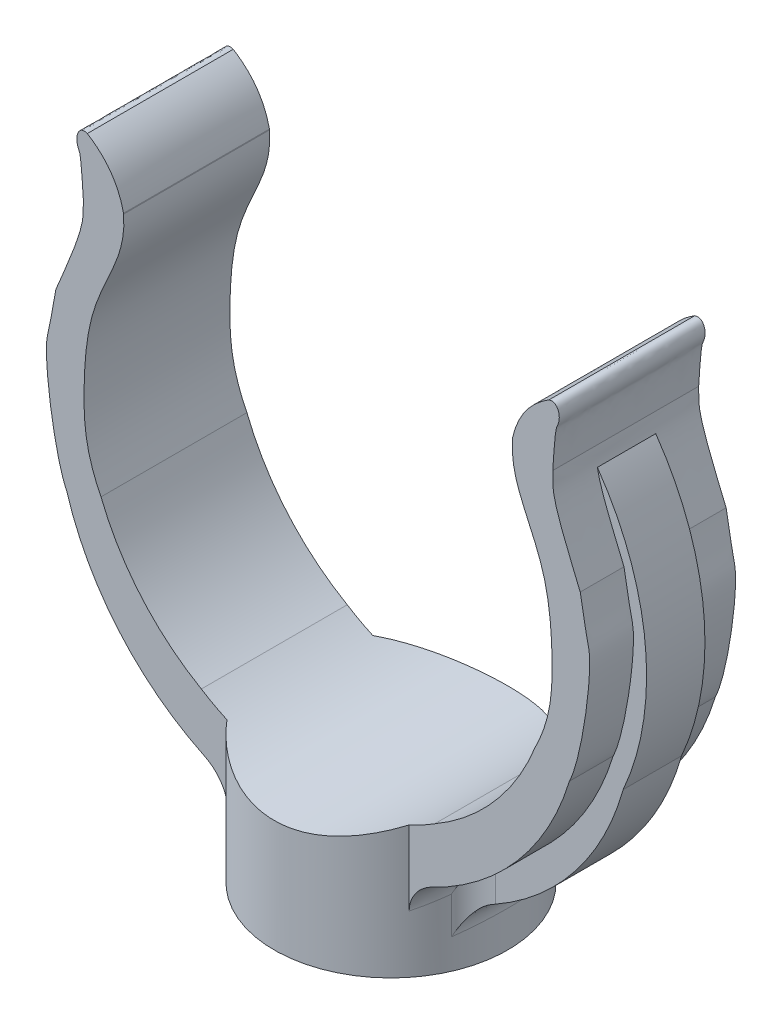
ISO-10303-21;
HEADER;
FILE_DESCRIPTION(('STEP AP214'),'2;1');
FILE_NAME('part.step','',(''),(''),'','','');
FILE_SCHEMA(('AUTOMOTIVE_DESIGN { 1 0 10303 214 1 1 1 1 }'));
ENDSEC;
DATA;
#1=APPLICATION_CONTEXT('core data for automotive mechanical design processes');
#2=APPLICATION_PROTOCOL_DEFINITION('international standard','automotive_design',2000,#1);
#3=PRODUCT_CONTEXT('',#1,'mechanical');
#4=PRODUCT('Part','Part','',(#3));
#5=PRODUCT_RELATED_PRODUCT_CATEGORY('part','',(#4));
#6=PRODUCT_DEFINITION_FORMATION('','',#4);
#7=PRODUCT_DEFINITION_CONTEXT('part definition',#1,'design');
#8=PRODUCT_DEFINITION('design','',#6,#7);
#9=PRODUCT_DEFINITION_SHAPE('','',#8);
#10=(LENGTH_UNIT() NAMED_UNIT(*) SI_UNIT(.MILLI.,.METRE.));
#11=(NAMED_UNIT(*) PLANE_ANGLE_UNIT() SI_UNIT($,.RADIAN.));
#12=(NAMED_UNIT(*) SI_UNIT($,.STERADIAN.) SOLID_ANGLE_UNIT());
#13=UNCERTAINTY_MEASURE_WITH_UNIT(LENGTH_MEASURE(1.E-05),#10,'distance_accuracy_value','');
#14=(GEOMETRIC_REPRESENTATION_CONTEXT(3) GLOBAL_UNCERTAINTY_ASSIGNED_CONTEXT((#13)) GLOBAL_UNIT_ASSIGNED_CONTEXT((#10,
#11,#12)) REPRESENTATION_CONTEXT('',''));
#15=CARTESIAN_POINT('',(0.,0.,0.));
#16=DIRECTION('',(0.,0.,1.));
#17=DIRECTION('',(1.,0.,0.));
#18=AXIS2_PLACEMENT_3D('',#15,#16,#17);
#19=CARTESIAN_POINT('',(0.,14.5,5.));
#20=DIRECTION('',(0.,0.,-1.));
#21=DIRECTION('',(-1.,0.,0.));
#22=AXIS2_PLACEMENT_3D('',#19,#20,#21);
#23=CYLINDRICAL_SURFACE('',#22,18.);
#24=CARTESIAN_POINT('',(-4.98748184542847,-2.795231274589,-8.32407076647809));
#25=CARTESIAN_POINT('',(-4.10044753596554,-3.05102823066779,-6.88086044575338));
#26=CARTESIAN_POINT('',(-4.43331719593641,-4.71692363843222,-6.65925661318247));
#27=CARTESIAN_POINT('',(-5.1883021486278,-2.73732580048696,-8.17549649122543));
#28=CARTESIAN_POINT('',(-4.2799724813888,-3.01037512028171,-6.77412834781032));
#29=CARTESIAN_POINT('',(-4.61182413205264,-4.6525842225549,-6.54039719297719));
#30=CARTESIAN_POINT('',(-5.38321472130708,-2.67732167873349,-8.01838892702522));
#31=CARTESIAN_POINT('',(-4.45758384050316,-2.9671348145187,-6.65894047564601));
#32=CARTESIAN_POINT('',(-4.78507975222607,-4.58591297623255,-6.41471114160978));
#33=CARTESIAN_POINT('',(-5.76057620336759,-2.55447529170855,-7.68786224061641));
#34=CARTESIAN_POINT('',(-4.80530390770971,-2.87684508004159,-6.41258373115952));
#35=CARTESIAN_POINT('',(-5.1205121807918,-4.44941699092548,-6.15028979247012));
#36=CARTESIAN_POINT('',(-5.94302404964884,-2.49163278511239,-7.5144417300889));
#37=CARTESIAN_POINT('',(-4.97545711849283,-2.82984564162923,-6.28161099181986));
#38=CARTESIAN_POINT('',(-5.28268804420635,-4.37959198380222,-6.01155338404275));
#39=CARTESIAN_POINT('',(-6.47025534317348,-2.30104426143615,-6.97128840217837));
#40=CARTESIAN_POINT('',(-5.46951568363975,-2.6854397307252,-5.86736946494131));
#41=CARTESIAN_POINT('',(-5.75133808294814,-4.16782695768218,-5.57703072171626));
#42=CARTESIAN_POINT('',(-6.79537802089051,-2.17110180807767,-6.57832847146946));
#43=CARTESIAN_POINT('',(-5.78336543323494,-2.58314047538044,-5.55903725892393));
#44=CARTESIAN_POINT('',(-6.04033601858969,-4.02344645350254,-5.26266277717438));
#45=CARTESIAN_POINT('',(-7.2979029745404,-1.95575079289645,-5.86411247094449));
#46=CARTESIAN_POINT('',(-6.27586560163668,-2.40874361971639,-4.98374793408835));
#47=CARTESIAN_POINT('',(-6.48702486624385,-3.78416754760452,-4.69128997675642));
#48=CARTESIAN_POINT('',(-7.49045526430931,-1.86860944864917,-5.55637967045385));
#49=CARTESIAN_POINT('',(-6.46659145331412,-2.33699691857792,-4.7331989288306));
#50=CARTESIAN_POINT('',(-6.65818245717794,-3.68734383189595,-4.44510373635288));
#51=CARTESIAN_POINT('',(-7.84404138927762,-1.70213221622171,-4.91717391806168));
#52=CARTESIAN_POINT('',(-6.8190636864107,-2.19818479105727,-4.20661488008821));
#53=CARTESIAN_POINT('',(-6.97248123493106,-3.50236912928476,-3.93373913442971));
#54=CARTESIAN_POINT('',(-8.00511458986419,-1.62278664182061,-4.58573133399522));
#55=CARTESIAN_POINT('',(-6.98146173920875,-2.13095267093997,-3.93052533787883));
#56=CARTESIAN_POINT('',(-7.11565741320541,-3.41420737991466,-3.66858506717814));
#57=CARTESIAN_POINT('',(-8.24412036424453,-1.50143165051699,-4.0191631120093));
#58=CARTESIAN_POINT('',(-7.22380334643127,-2.02707056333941,-3.45376525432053));
#59=CARTESIAN_POINT('',(-7.32810699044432,-3.27936850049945,-3.21533048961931));
#60=CARTESIAN_POINT('',(-8.33164371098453,-1.45593607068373,-3.7898810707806));
#61=CARTESIAN_POINT('',(-7.31289583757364,-1.98786730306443,-3.26003479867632));
#62=CARTESIAN_POINT('',(-7.40590552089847,-3.22881785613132,-3.03190485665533));
#63=CARTESIAN_POINT('',(-8.49142348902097,-1.3714799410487,-3.32334864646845));
#64=CARTESIAN_POINT('',(-7.47589964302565,-1.91476919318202,-2.8641562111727));
#65=CARTESIAN_POINT('',(-7.54793199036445,-3.13497771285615,-2.65867891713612));
#66=CARTESIAN_POINT('',(-8.56367982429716,-1.33251943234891,-3.08609821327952));
#67=CARTESIAN_POINT('',(-7.54997826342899,-1.88080791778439,-2.66186153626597));
#68=CARTESIAN_POINT('',(-7.61215984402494,-3.09168825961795,-2.4688785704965));
#69=CARTESIAN_POINT('',(-8.69257440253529,-1.26212712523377,-2.60358176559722));
#70=CARTESIAN_POINT('',(-7.68228558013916,-1.8192694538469,-2.24913219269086));
#71=CARTESIAN_POINT('',(-7.72673280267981,-3.01347458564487,-2.08286541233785));
#72=CARTESIAN_POINT('',(-8.7491236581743,-1.23073835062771,-2.35827854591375));
#73=CARTESIAN_POINT('',(-7.74057539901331,-1.79166300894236,-2.03845864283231));
#74=CARTESIAN_POINT('',(-7.7769988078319,-2.97859816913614,-1.88662283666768));
#75=CARTESIAN_POINT('',(-8.84550203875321,-1.17673124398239,-1.8623566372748));
#76=CARTESIAN_POINT('',(-7.83999925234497,-1.74407396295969,-1.61170124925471));
#77=CARTESIAN_POINT('',(-7.86266847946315,-2.91859027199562,-1.48988530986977));
#78=CARTESIAN_POINT('',(-8.88532260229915,-1.15411740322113,-1.61173529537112));
#79=CARTESIAN_POINT('',(-7.88124435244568,-1.72403997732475,-1.39537964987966));
#80=CARTESIAN_POINT('',(-7.89806453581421,-2.89346378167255,-1.28938823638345));
#81=CARTESIAN_POINT('',(-8.91646593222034,-1.13638817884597,-1.35930050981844));
#82=CARTESIAN_POINT('',(-7.91346821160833,-1.70833579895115,-1.17693726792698));
#83=CARTESIAN_POINT('',(-7.92574749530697,-2.87376464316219,-1.08744040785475));
#84=(BOUNDED_SURFACE() B_SPLINE_SURFACE(3,2,((#24,#25,#26),(#27,#28,#29),(#30,#31,#32),(#33,#34,
#35),(#36,#37,#38),(#39,#40,#41),(#42,#43,#44),(#45,#46,#47),(#48,#49,#50),(#51,#52,#53),(#54,
#55,#56),(#57,#58,#59),(#60,#61,#62),(#63,#64,#65),(#66,#67,#68),(#69,#70,#71),(#72,#73,#74),
(#75,#76,#77),(#78,#79,#80),(#81,#82,#83)),.UNSPECIFIED.,.F.,.F.,
.F.) B_SPLINE_SURFACE_WITH_KNOTS((4,2,2,2,2,2,2,2,2,4),(3,3),(0.,0.826515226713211,
1.65310085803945,3.30442607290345,4.46371119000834,5.62153718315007,6.38323452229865,
7.14493665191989,7.91086999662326,8.67719485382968),(0.,1.),
.UNSPECIFIED.) GEOMETRIC_REPRESENTATION_ITEM() RATIONAL_B_SPLINE_SURFACE(((1.,0.759456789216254,
1.),(1.,0.763528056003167,1.),(1.,0.767690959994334,1.),(1.,0.776097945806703,1.),(1.,
0.780342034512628,1.),(1.,0.793032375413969,1.),(1.,0.801446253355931,1.),(1.,0.815033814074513,
1.),(1.,0.820425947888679,1.),(1.,0.830562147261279,1.),(1.,0.835307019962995,1.),(1.,
0.842466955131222,1.),(1.,0.845123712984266,1.),(1.,0.850017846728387,1.),(1.,0.852255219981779,
1.),(1.,0.856273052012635,1.),(1.,0.858050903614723,1.),(1.,0.861095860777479,1.),(1.,
0.862362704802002,1.),(1.,0.863354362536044,1.))) REPRESENTATION_ITEM('') SURFACE());
#85=CARTESIAN_POINT('',(-4.98748184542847,-2.795231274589,-8.32407076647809));
#86=CARTESIAN_POINT('',(-5.1883021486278,-2.73732580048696,-8.17549649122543));
#87=CARTESIAN_POINT('',(-5.38321472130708,-2.67732167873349,-8.01838892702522));
#88=CARTESIAN_POINT('',(-5.76057620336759,-2.55447529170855,-7.68786224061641));
#89=CARTESIAN_POINT('',(-5.94302404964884,-2.49163278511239,-7.5144417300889));
#90=CARTESIAN_POINT('',(-6.47025534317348,-2.30104426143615,-6.97128840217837));
#91=CARTESIAN_POINT('',(-6.79537802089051,-2.17110180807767,-6.57832847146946));
#92=CARTESIAN_POINT('',(-7.2979029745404,-1.95575079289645,-5.86411247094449));
#93=CARTESIAN_POINT('',(-7.4904552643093,-1.86860944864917,-5.55637967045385));
#94=CARTESIAN_POINT('',(-7.84404138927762,-1.70213221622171,-4.91717391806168));
#95=CARTESIAN_POINT('',(-8.00511458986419,-1.62278664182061,-4.58573133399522));
#96=CARTESIAN_POINT('',(-8.24412036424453,-1.50143165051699,-4.0191631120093));
#97=CARTESIAN_POINT('',(-8.33164371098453,-1.45593607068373,-3.7898810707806));
#98=CARTESIAN_POINT('',(-8.49142348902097,-1.3714799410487,-3.32334864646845));
#99=CARTESIAN_POINT('',(-8.56367982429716,-1.33251943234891,-3.08609821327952));
#100=CARTESIAN_POINT('',(-8.69257440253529,-1.26212712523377,-2.60358176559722));
#101=CARTESIAN_POINT('',(-8.7491236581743,-1.23073835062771,-2.35827854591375));
#102=CARTESIAN_POINT('',(-8.84550203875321,-1.17673124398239,-1.8623566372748));
#103=CARTESIAN_POINT('',(-8.88532260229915,-1.15411740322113,-1.61173529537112));
#104=CARTESIAN_POINT('',(-8.91646593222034,-1.13638817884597,-1.35930050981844));
#105=B_SPLINE_CURVE_WITH_KNOTS('',3,(#85,#86,#87,#88,#89,#90,#91,#92,#93,#94,#95,#96,#97,#98,
#99,#100,#101,#102,#103,#104),.UNSPECIFIED.,.F.,.F.,(4,2,2,2,2,2,2,2,2,4),(0.,0.826515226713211,
1.65310085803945,3.30442607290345,4.46371119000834,5.62153718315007,6.38323452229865,
7.14493665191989,7.91086999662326,8.67719485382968),.UNSPECIFIED.);
#106=CARTESIAN_POINT('',(-7.79422863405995,-1.72498073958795,-5.));
#107=VERTEX_POINT('',#106);
#108=CARTESIAN_POINT('',(-8.81235435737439,-1.195298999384,-2.0313623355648));
#109=VERTEX_POINT('',#108);
#110=EDGE_CURVE('E582',#107,#109,#105,.T.);
#111=ORIENTED_EDGE('',*,*,#110,.T.);
#112=CARTESIAN_POINT('',(-8.81235435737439,-1.195298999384,-2.0313623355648));
#113=CARTESIAN_POINT('',(-8.8417288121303,-1.17880651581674,-2.0260981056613));
#114=CARTESIAN_POINT('',(-8.87114749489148,-1.1621802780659,-2.02150464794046));
#115=CARTESIAN_POINT('',(-8.92997947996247,-1.12871102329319,-2.01365324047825));
#116=CARTESIAN_POINT('',(-8.95939272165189,-1.1118683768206,-2.01039325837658));
#117=CARTESIAN_POINT('',(-9.01820989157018,-1.0779665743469,-2.00518675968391));
#118=CARTESIAN_POINT('',(-9.04761381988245,-1.06090742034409,-2.00324023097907));
#119=CARTESIAN_POINT('',(-9.10641235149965,-1.02657130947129,-2.00064583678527));
#120=CARTESIAN_POINT('',(-9.1358068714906,-1.00929405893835,-1.99999996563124));
#121=CARTESIAN_POINT('',(-9.16515138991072,-0.991933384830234,-1.99999999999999));
#122=B_SPLINE_CURVE_WITH_KNOTS('',3,(#112,#113,#114,#115,#116,#117,#118,#119,#120,#121),
.UNSPECIFIED.,.F.,.F.,(4,2,2,2,4),(0.,0.102281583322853,0.204406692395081,0.306530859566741,
0.408811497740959),.UNSPECIFIED.);
#123=CARTESIAN_POINT('',(-9.16515138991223,-0.991933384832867,-2.));
#124=VERTEX_POINT('',#123);
#125=EDGE_CURVE('E323',#109,#124,#122,.T.);
#126=ORIENTED_EDGE('',*,*,#125,.T.);
#127=CARTESIAN_POINT('',(0.,14.5,-2.));
#128=DIRECTION('',(0.,0.,-1.));
#129=DIRECTION('',(-1.,0.,0.));
#130=AXIS2_PLACEMENT_3D('',#127,#128,#129);
#131=CIRCLE('',#130,18.000000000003);
#132=CARTESIAN_POINT('',(-17.2259023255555,9.27809526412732,-2.));
#133=VERTEX_POINT('',#132);
#134=EDGE_CURVE('E317',#124,#133,#131,.T.);
#135=ORIENTED_EDGE('',*,*,#134,.T.);
#136=DIRECTION('',(0.,0.,-1.));
#137=VECTOR('',#136,1.);
#138=CARTESIAN_POINT('',(-17.2259023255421,9.27809526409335,5.));
#139=LINE('',#138,#137);
#140=CARTESIAN_POINT('',(-17.2259023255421,9.27809526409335,-5.));
#141=VERTEX_POINT('',#140);
#142=EDGE_CURVE('E320',#133,#141,#139,.T.);
#143=ORIENTED_EDGE('',*,*,#142,.T.);
#144=CARTESIAN_POINT('',(0.,14.5,-5.));
#145=DIRECTION('',(0.,0.,1.));
#146=DIRECTION('',(1.,0.,0.));
#147=AXIS2_PLACEMENT_3D('',#144,#145,#146);
#148=CIRCLE('',#147,18.);
#149=EDGE_CURVE('E589',#141,#107,#148,.T.);
#150=ORIENTED_EDGE('',*,*,#149,.T.);
#151=EDGE_LOOP('',(#111,#126,#135,#143,#150));
#152=FACE_BOUND('',#151,.T.);
#153=ADVANCED_FACE('F45',(#152),#23,.T.);
#154=CARTESIAN_POINT('',(-17.9704413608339,20.8840512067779,5.));
#155=CARTESIAN_POINT('',(-18.2898828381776,18.9276915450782,5.));
#156=CARTESIAN_POINT('',(-18.5360271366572,18.0864635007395,5.));
#157=CARTESIAN_POINT('',(-18.769092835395,15.9910245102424,5.));
#158=CARTESIAN_POINT('',(-18.004725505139,10.8515422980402,5.));
#159=CARTESIAN_POINT('',(-17.2259023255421,9.27809526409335,5.));
#160=B_SPLINE_CURVE_WITH_KNOTS('',3,(#154,#155,#156,#157,#158,#159),.UNSPECIFIED.,.F.,.F.,(4,1,
1,4),(0.,0.210543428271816,0.310543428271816,1.),.UNSPECIFIED.);
#161=DIRECTION('',(0.,0.,-1.));
#162=VECTOR('',#161,1.);
#163=SURFACE_OF_LINEAR_EXTRUSION('',#160,#162);
#164=CARTESIAN_POINT('',(-17.2259023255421,9.27809526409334,-2.));
#165=CARTESIAN_POINT('',(-18.004725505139,10.8515422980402,-2.));
#166=CARTESIAN_POINT('',(-18.769092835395,15.9910245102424,-2.));
#167=CARTESIAN_POINT('',(-18.5360271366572,18.0864635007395,-2.));
#168=CARTESIAN_POINT('',(-18.2898828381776,18.9276915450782,-2.));
#169=CARTESIAN_POINT('',(-17.9704413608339,20.8840512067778,-2.));
#170=B_SPLINE_CURVE_WITH_KNOTS('',3,(#164,#165,#166,#167,#168,#169),.UNSPECIFIED.,.F.,.F.,(4,1,
1,4),(0.,0.689456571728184,0.789456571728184,1.),.UNSPECIFIED.);
#171=CARTESIAN_POINT('',(-17.9704413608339,20.8840512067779,-2.));
#172=VERTEX_POINT('',#171);
#173=EDGE_CURVE('E332',#133,#172,#170,.T.);
#174=ORIENTED_EDGE('',*,*,#173,.T.);
#175=DIRECTION('',(0.,0.,-1.));
#176=VECTOR('',#175,1.);
#177=CARTESIAN_POINT('',(-17.9704413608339,20.8840512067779,5.));
#178=LINE('',#177,#176);
#179=CARTESIAN_POINT('',(-17.9704413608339,20.8840512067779,-5.));
#180=VERTEX_POINT('',#179);
#181=EDGE_CURVE('E934',#172,#180,#178,.T.);
#182=ORIENTED_EDGE('',*,*,#181,.T.);
#183=CARTESIAN_POINT('',(-17.9704413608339,20.8840512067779,-5.));
#184=CARTESIAN_POINT('',(-18.2898828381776,18.9276915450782,-5.));
#185=CARTESIAN_POINT('',(-18.5360271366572,18.0864635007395,-5.));
#186=CARTESIAN_POINT('',(-18.769092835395,15.9910245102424,-5.));
#187=CARTESIAN_POINT('',(-18.004725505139,10.8515422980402,-5.));
#188=CARTESIAN_POINT('',(-17.2259023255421,9.27809526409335,-5.));
#189=B_SPLINE_CURVE_WITH_KNOTS('',3,(#183,#184,#185,#186,#187,#188),.UNSPECIFIED.,.F.,.F.,(4,1,
1,4),(0.,0.210543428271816,0.310543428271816,1.),.UNSPECIFIED.);
#190=EDGE_CURVE('E335',#180,#141,#189,.T.);
#191=ORIENTED_EDGE('',*,*,#190,.T.);
#192=ORIENTED_EDGE('',*,*,#142,.F.);
#193=EDGE_LOOP('',(#174,#182,#191,#192));
#194=FACE_BOUND('',#193,.T.);
#195=ADVANCED_FACE('F331',(#194),#163,.F.);
#196=CARTESIAN_POINT('',(0.,2.14359353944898,0.));
#197=DIRECTION('',(0.,1.,0.));
#198=DIRECTION('',(-1.,0.,0.));
#199=AXIS2_PLACEMENT_3D('',#196,#197,#198);
#200=CYLINDRICAL_SURFACE('',#199,8.);
#201=CARTESIAN_POINT('',(0.,-7.85640646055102,0.));
#202=DIRECTION('',(0.,1.,0.));
#203=DIRECTION('',(-1.,0.,0.));
#204=AXIS2_PLACEMENT_3D('',#201,#202,#203);
#205=CIRCLE('',#204,8.);
#206=CARTESIAN_POINT('',(-8.,-7.85640646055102,0.));
#207=VERTEX_POINT('',#206);
#208=EDGE_CURVE('E1155',#207,#207,#205,.T.);
#209=ORIENTED_EDGE('',*,*,#208,.T.);
#210=EDGE_LOOP('',(#209));
#211=FACE_BOUND('',#210,.T.);
#212=CARTESIAN_POINT('',(5.20050160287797,-2.73237601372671,8.16154662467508));
#213=CARTESIAN_POINT('',(4.29283290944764,-3.00629833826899,6.7627589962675));
#214=CARTESIAN_POINT('',(4.62266809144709,-4.64708445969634,6.52923729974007));
#215=CARTESIAN_POINT('',(5.39893624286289,-2.67249642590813,8.00541621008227));
#216=CARTESIAN_POINT('',(4.4718132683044,-2.9636491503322,6.64932215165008));
#217=CARTESIAN_POINT('',(4.79905443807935,-4.58055158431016,6.40433296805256));
#218=CARTESIAN_POINT('',(5.59118989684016,-2.61072956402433,7.84078688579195));
#219=CARTESIAN_POINT('',(4.64855538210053,-2.91849710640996,6.52725226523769));
#220=CARTESIAN_POINT('',(4.96994657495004,-4.51192173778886,6.27262950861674));
#221=CARTESIAN_POINT('',(5.96270382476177,-2.48483524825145,7.49526520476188));
#222=CARTESIAN_POINT('',(4.99377876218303,-2.82470656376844,6.26695178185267));
#223=CARTESIAN_POINT('',(5.30018117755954,-4.37203916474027,5.99621216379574));
#224=CARTESIAN_POINT('',(6.14196202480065,-2.42070742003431,7.31437026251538));
#225=CARTESIAN_POINT('',(5.16233032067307,-2.77611034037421,6.1289079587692));
#226=CARTESIAN_POINT('',(5.45952179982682,-4.30078602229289,5.85149621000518));
#227=CARTESIAN_POINT('',(6.65891822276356,-2.22704101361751,6.74878106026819));
#228=CARTESIAN_POINT('',(5.65049408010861,-2.62755515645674,5.69332554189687));
#229=CARTESIAN_POINT('',(5.91903842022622,-4.08560112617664,5.3990248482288));
#230=CARTESIAN_POINT('',(6.97612897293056,-2.09611551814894,6.34092103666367));
#231=CARTESIAN_POINT('',(5.95893348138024,-2.52326457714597,5.37033657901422));
#232=CARTESIAN_POINT('',(6.2010035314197,-3.94012835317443,5.07273682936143));
#233=CARTESIAN_POINT('',(7.46112954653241,-1.88227803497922,5.60479805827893));
#234=CARTESIAN_POINT('',(6.43715614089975,-2.34840122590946,4.77280419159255));
#235=CARTESIAN_POINT('',(6.63211515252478,-3.70253115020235,4.48383844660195));
#236=CARTESIAN_POINT('',(7.64498370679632,-1.79690164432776,5.29020115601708));
#237=CARTESIAN_POINT('',(6.62026796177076,-2.27747875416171,4.51485359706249));
#238=CARTESIAN_POINT('',(6.7955410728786,-3.60766849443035,4.2321609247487));
#239=CARTESIAN_POINT('',(7.98052723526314,-1.6352337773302,4.63814762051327));
#240=CARTESIAN_POINT('',(6.95634392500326,-2.14164450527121,3.97441992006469));
#241=CARTESIAN_POINT('',(7.09380198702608,-3.4280375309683,3.71051809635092));
#242=CARTESIAN_POINT('',(8.13226256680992,-1.55892938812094,4.30072457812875));
#243=CARTESIAN_POINT('',(7.10997498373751,-2.07654362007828,3.69181565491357));
#244=CARTESIAN_POINT('',(7.22867783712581,-3.34325487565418,3.44057966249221));
#245=CARTESIAN_POINT('',(8.3546273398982,-1.44396430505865,3.72672168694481));
#246=CARTESIAN_POINT('',(7.33622934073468,-1.97757152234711,3.2066306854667));
#247=CARTESIAN_POINT('',(7.42633541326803,-3.21551589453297,2.9813773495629));
#248=CARTESIAN_POINT('',(8.4351352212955,-1.40142582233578,3.49575047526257));
#249=CARTESIAN_POINT('',(7.41844183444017,-1.94072588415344,3.01066751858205));
#250=CARTESIAN_POINT('',(7.49789797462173,-3.16825091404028,2.79660038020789));
#251=CARTESIAN_POINT('',(8.58083468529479,-1.32327698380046,3.02645926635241));
#252=CARTESIAN_POINT('',(7.56749854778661,-1.87277875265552,2.6110103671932));
#253=CARTESIAN_POINT('',(7.62740860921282,-3.0814188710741,2.4211674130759));
#254=CARTESIAN_POINT('',(8.64602609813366,-1.28766670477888,2.78813918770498));
#255=CARTESIAN_POINT('',(7.63449902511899,-1.84161265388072,2.40715439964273));
#256=CARTESIAN_POINT('',(7.68535653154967,-3.04185189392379,2.2305113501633));
#257=CARTESIAN_POINT('',(8.76075867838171,-1.22429681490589,2.30407770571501));
#258=CARTESIAN_POINT('',(7.75251762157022,-1.78602344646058,1.99197642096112));
#259=CARTESIAN_POINT('',(7.78734104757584,-2.97144090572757,1.84326216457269));
#260=CARTESIAN_POINT('',(8.81020506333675,-1.19658485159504,2.05830076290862));
#261=CARTESIAN_POINT('',(7.80357586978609,-1.76158010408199,1.78040516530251));
#262=CARTESIAN_POINT('',(7.8312933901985,-2.94064983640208,1.64664061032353));
#263=CARTESIAN_POINT('',(8.89241182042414,-1.15014313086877,1.5621752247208));
#264=CARTESIAN_POINT('',(7.88850947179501,-1.72055634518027,1.35265713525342));
#265=CARTESIAN_POINT('',(7.90436606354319,-2.8890479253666,1.24974017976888));
#266=CARTESIAN_POINT('',(8.9251638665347,-1.13141785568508,1.31182441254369));
#267=CARTESIAN_POINT('',(7.92247923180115,-1.70393143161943,1.13623498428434));
#268=CARTESIAN_POINT('',(7.93347899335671,-2.86824206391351,1.04945953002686));
#269=CARTESIAN_POINT('',(8.94928964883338,-1.11762513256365,1.06005752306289));
#270=CARTESIAN_POINT('',(7.94744685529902,-1.69170609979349,0.918185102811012));
#271=CARTESIAN_POINT('',(7.95492413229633,-2.85291681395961,0.848046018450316));
#272=(BOUNDED_SURFACE() B_SPLINE_SURFACE(3,2,((#212,#213,#214),(#215,#216,#217),(#218,#219,
#220),(#221,#222,#223),(#224,#225,#226),(#227,#228,#229),(#230,#231,#232),(#233,#234,#235),
(#236,#237,#238),(#239,#240,#241),(#242,#243,#244),(#245,#246,#247),(#248,#249,#250),(#251,#252,
#253),(#254,#255,#256),(#257,#258,#259),(#260,#261,#262),(#263,#264,#265),(#266,#267,#268),
(#269,#270,#271)),.UNSPECIFIED.,.F.,.F.,.F.) B_SPLINE_SURFACE_WITH_KNOTS((4,2,2,2,2,2,2,2,2,4),
(3,3),(0.,0.834162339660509,1.66845750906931,3.3356649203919,4.4943545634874,5.65137469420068,
6.40714800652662,7.16292969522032,7.92317862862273,8.68380635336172),(0.,1.),
.UNSPECIFIED.) GEOMETRIC_REPRESENTATION_ITEM() RATIONAL_B_SPLINE_SURFACE(((1.,0.763853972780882,
1.),(1.,0.768024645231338,1.),(1.,0.772267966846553,1.),(1.,0.780797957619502,1.),(1.,
0.785084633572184,1.),(1.,0.797847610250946,1.),(1.,0.806234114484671,1.),(1.,0.819588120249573,
1.),(1.,0.824818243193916,1.),(1.,0.834570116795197,1.),(1.,0.839092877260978,1.),(1.,
0.845822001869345,1.),(1.,0.848287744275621,1.),(1.,0.852786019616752,1.),(1.,0.854818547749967,
1.),(1.,0.858416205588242,1.),(1.,0.859978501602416,1.),(1.,0.862586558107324,1.),(1.,
0.863632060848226,1.),(1.,0.864401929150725,1.))) REPRESENTATION_ITEM('') SURFACE());
#273=CARTESIAN_POINT('',(7.95492413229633,-2.85291681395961,0.848046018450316));
#274=CARTESIAN_POINT('',(7.93347899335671,-2.86824206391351,1.04945953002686));
#275=CARTESIAN_POINT('',(7.90436606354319,-2.8890479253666,1.24974017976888));
#276=CARTESIAN_POINT('',(7.8312933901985,-2.94064983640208,1.64664061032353));
#277=CARTESIAN_POINT('',(7.78734104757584,-2.97144090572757,1.84326216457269));
#278=CARTESIAN_POINT('',(7.68535653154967,-3.04185189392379,2.23051135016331));
#279=CARTESIAN_POINT('',(7.62740860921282,-3.0814188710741,2.4211674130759));
#280=CARTESIAN_POINT('',(7.49789797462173,-3.16825091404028,2.79660038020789));
#281=CARTESIAN_POINT('',(7.42633541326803,-3.21551589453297,2.9813773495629));
#282=CARTESIAN_POINT('',(7.22867783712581,-3.34325487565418,3.44057966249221));
#283=CARTESIAN_POINT('',(7.09380198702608,-3.4280375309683,3.71051809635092));
#284=CARTESIAN_POINT('',(6.7955410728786,-3.60766849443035,4.2321609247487));
#285=CARTESIAN_POINT('',(6.63211515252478,-3.70253115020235,4.48383844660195));
#286=CARTESIAN_POINT('',(6.2010035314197,-3.94012835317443,5.07273682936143));
#287=CARTESIAN_POINT('',(5.91903842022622,-4.08560112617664,5.3990248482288));
#288=CARTESIAN_POINT('',(5.45952179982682,-4.30078602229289,5.85149621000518));
#289=CARTESIAN_POINT('',(5.30018117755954,-4.37203916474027,5.99621216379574));
#290=CARTESIAN_POINT('',(4.96994657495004,-4.51192173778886,6.27262950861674));
#291=CARTESIAN_POINT('',(4.79905443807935,-4.58055158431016,6.40433296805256));
#292=CARTESIAN_POINT('',(4.62266809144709,-4.64708445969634,6.52923729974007));
#293=B_SPLINE_CURVE_WITH_KNOTS('',3,(#273,#274,#275,#276,#277,#278,#279,#280,#281,#282,#283,
#284,#285,#286,#287,#288,#289,#290,#291,#292),.UNSPECIFIED.,.F.,.F.,(4,2,2,2,2,2,2,2,2,4),(0.,
0.760627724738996,1.5208766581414,2.2766583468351,3.03243165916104,4.18945178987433,
5.34814143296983,7.01534884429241,7.84964401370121,8.68380635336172),.UNSPECIFIED.);
#294=CARTESIAN_POINT('',(7.33212111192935,-3.27638883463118,3.2));
#295=VERTEX_POINT('',#294);
#296=CARTESIAN_POINT('',(6.2449979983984,-3.91364982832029,5.));
#297=VERTEX_POINT('',#296);
#298=EDGE_CURVE('E1471',#295,#297,#293,.T.);
#299=ORIENTED_EDGE('',*,*,#298,.T.);
#300=DIRECTION('',(0.,1.,0.));
#301=VECTOR('',#300,1.);
#302=CARTESIAN_POINT('',(6.2449979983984,2.14359353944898,5.));
#303=LINE('',#302,#301);
#304=CARTESIAN_POINT('',(6.2449979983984,1.19398938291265,5.));
#305=VERTEX_POINT('',#304);
#306=EDGE_CURVE('E1162',#297,#305,#303,.T.);
#307=ORIENTED_EDGE('',*,*,#306,.T.);
#308=CARTESIAN_POINT('',(-8.00000000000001,2.14359353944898,0.));
#309=CARTESIAN_POINT('',(-8.00000082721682,2.14359455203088,-0.206280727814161));
#310=CARTESIAN_POINT('',(-7.99201174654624,2.13854661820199,-0.412552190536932));
#311=CARTESIAN_POINT('',(-7.96017537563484,2.11855787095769,-0.823459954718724));
#312=CARTESIAN_POINT('',(-7.93632212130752,2.10361333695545,-1.02809561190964));
#313=CARTESIAN_POINT('',(-7.87306095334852,2.06438777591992,-1.43430299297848));
#314=CARTESIAN_POINT('',(-7.83363262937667,2.04009449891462,-1.63587033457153));
#315=CARTESIAN_POINT('',(-7.73973085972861,1.98306302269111,-2.0343271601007));
#316=CARTESIAN_POINT('',(-7.68525075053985,1.95032108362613,-2.23121453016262));
#317=CARTESIAN_POINT('',(-7.56228385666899,1.87775414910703,-2.61777402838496));
#318=CARTESIAN_POINT('',(-7.49388888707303,1.83797579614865,-2.80748425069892));
#319=CARTESIAN_POINT('',(-7.3435222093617,1.75240939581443,-3.18010557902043));
#320=CARTESIAN_POINT('',(-7.26154553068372,1.70661914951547,-3.36301416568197));
#321=CARTESIAN_POINT('',(-7.0846895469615,1.61032201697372,-3.72116109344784));
#322=CARTESIAN_POINT('',(-6.9898120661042,1.55981579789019,-3.89640051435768));
#323=CARTESIAN_POINT('',(-6.78781438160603,1.45537985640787,-4.23852477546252));
#324=CARTESIAN_POINT('',(-6.68069376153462,1.40145001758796,-4.40540933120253));
#325=CARTESIAN_POINT('',(-6.32032913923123,1.22596544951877,-4.92349422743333));
#326=CARTESIAN_POINT('',(-6.04463813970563,1.10016554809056,-5.25820159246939));
#327=CARTESIAN_POINT('',(-5.59347847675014,0.913130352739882,-5.72362528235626));
#328=CARTESIAN_POINT('',(-5.43671146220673,0.851024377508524,-5.8727421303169));
#329=CARTESIAN_POINT('',(-5.11109924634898,0.728736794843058,-6.15820501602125));
#330=CARTESIAN_POINT('',(-4.94225210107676,0.668555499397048,-6.29454899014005));
#331=CARTESIAN_POINT('',(-4.57935642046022,0.546899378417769,-6.56388302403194));
#332=CARTESIAN_POINT('',(-4.3843718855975,0.485703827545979,-6.69573942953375));
#333=CARTESIAN_POINT('',(-3.98237404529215,0.368960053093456,-6.94235290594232));
#334=CARTESIAN_POINT('',(-3.77536600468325,0.313409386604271,-7.05711738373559));
#335=CARTESIAN_POINT('',(-3.35057394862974,0.20953644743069,-7.26841855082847));
#336=CARTESIAN_POINT('',(-3.13279317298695,0.161212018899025,-7.36496067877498));
#337=CARTESIAN_POINT('',(-2.68795642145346,0.0732325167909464,-7.53869236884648));
#338=CARTESIAN_POINT('',(-2.4609015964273,0.0335763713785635,-7.61588432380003));
#339=CARTESIAN_POINT('',(-2.01763632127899,-0.0330680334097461,-7.74455376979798));
#340=CARTESIAN_POINT('',(-1.80198906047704,-0.0608102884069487,-7.79758248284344));
#341=CARTESIAN_POINT('',(-1.36607301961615,-0.107101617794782,-7.88563729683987));
#342=CARTESIAN_POINT('',(-1.14580446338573,-0.125651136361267,-7.92066426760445));
#343=CARTESIAN_POINT('',(-0.702641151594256,-0.153006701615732,-7.97220359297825));
#344=CARTESIAN_POINT('',(-0.479748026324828,-0.161818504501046,-7.98872688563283));
#345=CARTESIAN_POINT('',(-0.0331964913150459,-0.169453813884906,-8.00304874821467));
#346=CARTESIAN_POINT('',(0.190461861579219,-0.168278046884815,-8.00084868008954));
#347=CARTESIAN_POINT('',(0.614471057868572,-0.156587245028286,-7.97890621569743));
#348=CARTESIAN_POINT('',(0.814941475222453,-0.14700639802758,-7.96091846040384));
#349=CARTESIAN_POINT('',(1.2134408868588,-0.120000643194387,-7.90998778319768));
#350=CARTESIAN_POINT('',(1.41146986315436,-0.102575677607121,-7.87704475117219));
#351=CARTESIAN_POINT('',(1.80372417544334,-0.0602933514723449,-7.79658046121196));
#352=CARTESIAN_POINT('',(1.99794954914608,-0.0354360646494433,-7.74905934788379));
#353=CARTESIAN_POINT('',(2.3813778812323,0.0211412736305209,-7.63994618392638));
#354=CARTESIAN_POINT('',(2.57058064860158,0.0528615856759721,-7.57835359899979));
#355=CARTESIAN_POINT('',(2.94506910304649,0.122879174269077,-7.44088782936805));
#356=CARTESIAN_POINT('',(3.13028273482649,0.161249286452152,-7.36485549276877));
#357=CARTESIAN_POINT('',(3.49352300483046,0.24347569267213,-7.19966295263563));
#358=CARTESIAN_POINT('',(3.67154724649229,0.28733379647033,-7.11049841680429));
#359=CARTESIAN_POINT('',(4.19348838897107,0.425785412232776,-6.82436502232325));
#360=CARTESIAN_POINT('',(4.52549971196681,0.527300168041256,-6.60867258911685));
#361=CARTESIAN_POINT('',(5.1845632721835,0.751907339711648,-6.10810196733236));
#362=CARTESIAN_POINT('',(5.50754077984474,0.876145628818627,-5.81837198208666));
#363=CARTESIAN_POINT('',(5.95360340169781,1.06333724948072,-5.34803157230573));
#364=CARTESIAN_POINT('',(6.0959904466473,1.12592471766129,-5.18514684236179));
#365=CARTESIAN_POINT('',(6.36737369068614,1.24987489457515,-4.84802585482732));
#366=CARTESIAN_POINT('',(6.49636768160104,1.31123740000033,-4.6737877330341));
#367=CARTESIAN_POINT('',(6.74990405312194,1.43589085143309,-4.30043007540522));
#368=CARTESIAN_POINT('',(6.87327380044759,1.49894619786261,-4.10043408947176));
#369=CARTESIAN_POINT('',(7.10248719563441,1.61962220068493,-3.68918108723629));
#370=CARTESIAN_POINT('',(7.20833872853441,1.67724529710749,-3.47792919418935));
#371=CARTESIAN_POINT('',(7.40146247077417,1.78492693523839,-3.04539119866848));
#372=CARTESIAN_POINT('',(7.48874671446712,1.834990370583,-2.82411170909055));
#373=CARTESIAN_POINT('',(7.64370915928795,1.92551463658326,-2.37288542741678));
#374=CARTESIAN_POINT('',(7.71139038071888,1.96597694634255,-2.14293997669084));
#375=CARTESIAN_POINT('',(7.82145437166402,2.03261443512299,-1.69517317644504));
#376=CARTESIAN_POINT('',(7.86544291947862,2.05968175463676,-1.47787960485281));
#377=CARTESIAN_POINT('',(7.93530677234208,2.10296812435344,-1.03932304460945));
#378=CARTESIAN_POINT('',(7.96118319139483,2.11918784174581,-0.81806030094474));
#379=CARTESIAN_POINT('',(7.99436472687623,2.14002706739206,-0.373783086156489));
#380=CARTESIAN_POINT('',(8.00168522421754,2.14465618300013,-0.150770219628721));
#381=CARTESIAN_POINT('',(7.99766461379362,2.14212098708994,0.295008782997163));
#382=CARTESIAN_POINT('',(7.9863252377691,2.13495776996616,0.517774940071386));
#383=CARTESIAN_POINT('',(7.94793800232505,2.11090149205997,0.931405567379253));
#384=CARTESIAN_POINT('',(7.92318043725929,2.09542951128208,1.12257174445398));
#385=CARTESIAN_POINT('',(7.86010987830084,2.05641087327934,1.50187997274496));
#386=CARTESIAN_POINT('',(7.82179249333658,2.03286160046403,1.69002102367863));
#387=CARTESIAN_POINT('',(7.73205060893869,1.97845023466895,2.06204037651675));
#388=CARTESIAN_POINT('',(7.68062708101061,1.94758868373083,2.24591899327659));
#389=CARTESIAN_POINT('',(7.56517167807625,1.8794622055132,2.60852435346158));
#390=CARTESIAN_POINT('',(7.50113476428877,1.84219471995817,2.78724900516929));
#391=CARTESIAN_POINT('',(7.35794410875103,1.76053223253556,3.14637080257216));
#392=CARTESIAN_POINT('',(7.27825059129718,1.71589633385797,3.32649758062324));
#393=CARTESIAN_POINT('',(7.1063390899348,1.62196524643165,3.67946985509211));
#394=CARTESIAN_POINT('',(7.01411693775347,1.57266850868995,3.85231290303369));
#395=CARTESIAN_POINT('',(6.81773611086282,1.47063232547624,4.19006493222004));
#396=CARTESIAN_POINT('',(6.7135746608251,1.41789208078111,4.35497205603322));
#397=CARTESIAN_POINT('',(6.49387939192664,1.31017050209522,4.67626027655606));
#398=CARTESIAN_POINT('',(6.37834479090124,1.2551890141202,4.83264078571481));
#399=CARTESIAN_POINT('',(6.11858240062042,1.13595763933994,5.15873689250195));
#400=CARTESIAN_POINT('',(5.97263494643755,1.07153553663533,5.32702338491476));
#401=CARTESIAN_POINT('',(5.66717190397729,0.942944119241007,5.65090431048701));
#402=CARTESIAN_POINT('',(5.50765574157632,0.878774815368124,5.80649820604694));
#403=CARTESIAN_POINT('',(5.17570667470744,0.752269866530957,6.10424347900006));
#404=CARTESIAN_POINT('',(5.00326794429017,0.689935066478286,6.24638872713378));
#405=CARTESIAN_POINT('',(4.64630001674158,0.568671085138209,6.51628490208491));
#406=CARTESIAN_POINT('',(4.46176926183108,0.509742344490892,6.64403396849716));
#407=CARTESIAN_POINT('',(4.07354485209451,0.394410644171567,6.88920293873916));
#408=CARTESIAN_POINT('',(3.86937210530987,0.338217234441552,7.00596502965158));
#409=CARTESIAN_POINT('',(3.45019516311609,0.232759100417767,7.22161153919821));
#410=CARTESIAN_POINT('',(3.2351961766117,0.183491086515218,7.32050445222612));
#411=CARTESIAN_POINT('',(2.7958660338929,0.0933318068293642,7.4992893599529));
#412=CARTESIAN_POINT('',(2.57153999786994,0.0524360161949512,7.57919162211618));
#413=CARTESIAN_POINT('',(2.11523636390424,-0.0197345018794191,7.71898236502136));
#414=CARTESIAN_POINT('',(1.88325983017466,-0.0510105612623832,7.77887361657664));
#415=CARTESIAN_POINT('',(1.43696201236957,-0.100359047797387,7.87285751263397));
#416=CARTESIAN_POINT('',(1.22316354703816,-0.119431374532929,7.90891578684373));
#417=CARTESIAN_POINT('',(0.79273285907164,-0.148419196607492,7.96358123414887));
#418=CARTESIAN_POINT('',(0.576100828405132,-0.158335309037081,7.98218958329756));
#419=CARTESIAN_POINT('',(0.141899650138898,-0.168729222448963,8.00169215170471));
#420=CARTESIAN_POINT('',(-0.0756691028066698,-0.169210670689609,8.00259321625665));
#421=CARTESIAN_POINT('',(-0.509967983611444,-0.160730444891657,7.98668535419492));
#422=CARTESIAN_POINT('',(-0.726698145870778,-0.151769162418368,7.96987716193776));
#423=CARTESIAN_POINT('',(-1.13993624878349,-0.12576539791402,7.92087442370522));
#424=CARTESIAN_POINT('',(-1.33665343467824,-0.109440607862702,7.89004465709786));
#425=CARTESIAN_POINT('',(-1.72658766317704,-0.0694166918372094,7.81398520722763));
#426=CARTESIAN_POINT('',(-1.91980350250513,-0.0457150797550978,7.76875066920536));
#427=CARTESIAN_POINT('',(-2.30138685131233,0.00851600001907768,7.66438096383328));
#428=CARTESIAN_POINT('',(-2.48975583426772,0.0390433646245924,7.60525007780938));
#429=CARTESIAN_POINT('',(-2.86070279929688,0.106277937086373,7.47362893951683));
#430=CARTESIAN_POINT('',(-3.04327852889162,0.142987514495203,7.40113356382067));
#431=CARTESIAN_POINT('',(-3.40831874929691,0.223284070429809,7.24048335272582));
#432=CARTESIAN_POINT('',(-3.59052521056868,0.26707646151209,7.15184538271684));
#433=CARTESIAN_POINT('',(-3.94680147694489,0.359553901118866,6.96157753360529));
#434=CARTESIAN_POINT('',(-4.1208682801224,0.408240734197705,6.85994291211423));
#435=CARTESIAN_POINT('',(-4.46007274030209,0.509493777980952,6.64440643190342));
#436=CARTESIAN_POINT('',(-4.62520918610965,0.562060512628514,6.53050291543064));
#437=CARTESIAN_POINT('',(-4.94589577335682,0.670012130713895,6.29111749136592));
#438=CARTESIAN_POINT('',(-5.10144513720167,0.72539724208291,6.16563464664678));
#439=CARTESIAN_POINT('',(-5.41899884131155,0.844095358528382,5.88927069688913));
#440=CARTESIAN_POINT('',(-5.57982089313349,0.907608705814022,5.73711495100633));
#441=CARTESIAN_POINT('',(-5.88822197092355,1.03518961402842,5.42012453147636));
#442=CARTESIAN_POINT('',(-6.03579980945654,1.0992572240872,5.25528872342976));
#443=CARTESIAN_POINT('',(-6.31714795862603,1.22638194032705,4.91352052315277));
#444=CARTESIAN_POINT('',(-6.4509027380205,1.28943784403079,4.73657488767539));
#445=CARTESIAN_POINT('',(-6.70365634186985,1.41275352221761,4.3715300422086));
#446=CARTESIAN_POINT('',(-6.82265601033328,1.47301345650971,4.18343147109));
#447=CARTESIAN_POINT('',(-7.05111918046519,1.59211050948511,3.78641838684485));
#448=CARTESIAN_POINT('',(-7.1597181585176,1.65069416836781,3.5769282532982));
#449=CARTESIAN_POINT('',(-7.35859675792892,1.76067612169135,3.14754436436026));
#450=CARTESIAN_POINT('',(-7.44887326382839,1.81207319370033,2.92764884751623));
#451=CARTESIAN_POINT('',(-7.60975396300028,1.90544361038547,2.47954511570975));
#452=CARTESIAN_POINT('',(-7.68041349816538,1.9474433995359,2.2513623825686));
#453=CARTESIAN_POINT('',(-7.80129547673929,2.02027082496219,1.7880295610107));
#454=CARTESIAN_POINT('',(-7.85153144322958,2.05110585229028,1.55288419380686));
#455=CARTESIAN_POINT('',(-7.92721566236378,2.09792408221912,1.09883121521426));
#456=CARTESIAN_POINT('',(-7.95446803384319,2.11498244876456,0.880334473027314));
#457=CARTESIAN_POINT('',(-7.99086010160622,2.13781684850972,0.441221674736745));
#458=CARTESIAN_POINT('',(-7.99999911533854,2.14359245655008,0.220605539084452));
#459=CARTESIAN_POINT('',(-8.00000000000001,2.14359353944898,0.));
#460=B_SPLINE_CURVE_WITH_KNOTS('',3,(#308,#309,#310,#311,#312,#313,#314,#315,#316,#317,#318,
#319,#320,#321,#322,#323,#324,#325,#326,#327,#328,#329,#330,#331,#332,#333,#334,#335,#336,#337,
#338,#339,#340,#341,#342,#343,#344,#345,#346,#347,#348,#349,#350,#351,#352,#353,#354,#355,#356,
#357,#358,#359,#360,#361,#362,#363,#364,#365,#366,#367,#368,#369,#370,#371,#372,#373,#374,#375,
#376,#377,#378,#379,#380,#381,#382,#383,#384,#385,#386,#387,#388,#389,#390,#391,#392,#393,#394,
#395,#396,#397,#398,#399,#400,#401,#402,#403,#404,#405,#406,#407,#408,#409,#410,#411,#412,#413,
#414,#415,#416,#417,#418,#419,#420,#421,#422,#423,#424,#425,#426,#427,#428,#429,#430,#431,#432,
#433,#434,#435,#436,#437,#438,#439,#440,#441,#442,#443,#444,#445,#446,#447,#448,#449,#450,#451,
#452,#453,#454,#455,#456,#457,#458,#459),.UNSPECIFIED.,.T.,.F.,(4,2,2,2,2,2,2,2,2,2,2,2,2,2,2,2,
2,2,2,2,2,2,2,2,2,2,2,2,2,2,2,2,2,2,2,2,2,2,2,2,2,2,2,2,2,2,2,2,2,2,2,2,2,2,2,2,2,2,2,2,2,2,2,2,
2,2,2,2,2,2,2,2,2,2,2,4),(0.,0.618612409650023,1.2374575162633,1.85711629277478,
2.47704983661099,3.09301829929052,3.70921269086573,4.32532004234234,4.94144835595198,
6.2893297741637,6.96411577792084,7.63901061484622,8.36770205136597,9.09607678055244,
9.82423377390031,10.5523006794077,11.2227676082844,11.893202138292,12.5632401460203,
13.2332294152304,13.8370243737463,14.4408237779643,15.0446171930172,15.6484335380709,
16.2593380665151,16.8704445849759,18.0919304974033,19.4399210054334,20.1150149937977,
20.7902201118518,21.5191974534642,22.247845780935,22.9760203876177,23.7040827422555,
24.3731385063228,25.0421531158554,25.7106130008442,26.3790108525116,26.9584945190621,
27.5381660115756,28.1177945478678,28.6976551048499,29.3029446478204,29.9084360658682,
30.5140685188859,31.1197426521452,31.8146386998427,32.5095641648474,33.2048048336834,
33.900135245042,34.6246245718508,35.3487685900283,36.0725201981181,36.796171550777,
37.4482560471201,38.1002965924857,38.7520850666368,39.4038465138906,40.0025200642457,
40.6013955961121,41.2000868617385,41.7990081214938,42.4202632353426,43.041745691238,
43.6633122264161,44.2849291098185,44.9751514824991,45.665435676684,46.3564872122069,
47.0474992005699,47.7759050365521,48.5044346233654,49.2308875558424,49.9568586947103,
50.6184046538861,51.2799755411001),.UNSPECIFIED.);
#461=CARTESIAN_POINT('',(-6.2449979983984,1.19398938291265,5.));
#462=VERTEX_POINT('',#461);
#463=EDGE_CURVE('E1146',#305,#462,#460,.T.);
#464=ORIENTED_EDGE('',*,*,#463,.T.);
#465=DIRECTION('',(0.,1.,0.));
#466=VECTOR('',#465,1.);
#467=CARTESIAN_POINT('',(-6.2449979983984,2.14359353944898,5.));
#468=LINE('',#467,#466);
#469=CARTESIAN_POINT('',(-6.2449979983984,-3.91364982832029,5.));
#470=VERTEX_POINT('',#469);
#471=EDGE_CURVE('E1104',#462,#470,#468,.F.);
#472=ORIENTED_EDGE('',*,*,#471,.T.);
#473=CARTESIAN_POINT('',(-8.999732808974,-1.08861152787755,0.0770551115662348));
#474=CARTESIAN_POINT('',(-7.99972291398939,-1.66594465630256,0.0667808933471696));
#475=CARTESIAN_POINT('',(-7.99976249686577,-2.8206794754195,0.0616440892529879));
#476=CARTESIAN_POINT('',(-8.99801748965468,-1.08956286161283,0.330027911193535));
#477=CARTESIAN_POINT('',(-7.99799177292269,-1.66676384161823,0.286055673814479));
#478=CARTESIAN_POINT('',(-7.9982377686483,-2.82173651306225,0.264022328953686));
#479=CARTESIAN_POINT('',(-8.98758683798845,-1.09562246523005,0.582870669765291));
#480=CARTESIAN_POINT('',(-7.98712313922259,-1.67217870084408,0.505289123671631));
#481=CARTESIAN_POINT('',(-7.98896607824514,-2.82846940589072,0.466296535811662));
#482=CARTESIAN_POINT('',(-8.94960503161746,-1.11747010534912,1.0864412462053));
#483=CARTESIAN_POINT('',(-7.94774192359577,-1.69158643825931,0.941236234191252));
#484=CARTESIAN_POINT('',(-7.95520447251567,-2.85274456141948,0.869152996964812));
#485=CARTESIAN_POINT('',(-8.92205423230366,-1.13325793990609,1.33716910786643));
#486=CARTESIAN_POINT('',(-7.91918001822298,-1.70560346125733,1.15822142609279));
#487=CARTESIAN_POINT('',(-7.93071487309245,-2.87028659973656,1.06973528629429));
#488=CARTESIAN_POINT('',(-8.85042269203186,-1.17391480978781,1.83272517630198));
#489=CARTESIAN_POINT('',(-7.84512944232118,-1.74155911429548,1.58601629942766));
#490=CARTESIAN_POINT('',(-7.86704239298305,-2.91546089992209,1.46618014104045));
#491=CARTESIAN_POINT('',(-8.80647257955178,-1.19871204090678,2.0775841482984));
#492=CARTESIAN_POINT('',(-7.79968433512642,-1.76347812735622,1.79711128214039));
#493=CARTESIAN_POINT('',(-7.82797562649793,-2.94301337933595,1.66206731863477));
#494=CARTESIAN_POINT('',(-8.70255821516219,-1.25655525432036,2.56173261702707));
#495=CARTESIAN_POINT('',(-7.69263267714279,-1.81434140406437,2.21312543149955));
#496=CARTESIAN_POINT('',(-7.73560730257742,-3.00728361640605,2.04938609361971));
#497=CARTESIAN_POINT('',(-8.64260099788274,-1.28959761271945,2.80102451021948));
#498=CARTESIAN_POINT('',(-7.63091048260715,-1.84333840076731,2.41826045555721));
#499=CARTESIAN_POINT('',(-7.68231199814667,-3.04399734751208,2.24081960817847));
#500=CARTESIAN_POINT('',(-8.53310814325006,-1.34892156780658,3.18272074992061));
#501=CARTESIAN_POINT('',(-7.51878779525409,-1.89502844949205,2.74381665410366));
#502=CARTESIAN_POINT('',(-7.58498501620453,-3.10991285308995,2.5461765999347));
#503=CARTESIAN_POINT('',(-8.48832078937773,-1.37297448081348,3.32726593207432));
#504=CARTESIAN_POINT('',(-7.47293864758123,-1.91595641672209,2.86694761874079));
#505=CARTESIAN_POINT('',(-7.54517403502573,-3.13663831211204,2.66181274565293));
#506=CARTESIAN_POINT('',(-8.39298602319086,-1.42358948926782,3.61353135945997));
#507=CARTESIAN_POINT('',(-7.37559852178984,-1.95982415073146,3.11012333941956));
#508=CARTESIAN_POINT('',(-7.46043202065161,-3.19287721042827,2.89082508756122));
#509=CARTESIAN_POINT('',(-8.34243536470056,-1.45015299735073,3.75524995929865));
#510=CARTESIAN_POINT('',(-7.32406669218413,-1.9827801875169,3.23020087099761));
#511=CARTESIAN_POINT('',(-7.41549810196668,-3.22239221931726,3.00419996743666));
#512=CARTESIAN_POINT('',(-8.18781266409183,-1.53036953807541,4.16144696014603));
#513=CARTESIAN_POINT('',(-7.16662572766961,-2.05191844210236,3.57386259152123));
#514=CARTESIAN_POINT('',(-7.27805570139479,-3.31152170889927,3.32915756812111));
#515=CARTESIAN_POINT('',(-8.07645235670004,-1.58692268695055,4.42184697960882));
#516=CARTESIAN_POINT('',(-7.0537545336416,-2.1002945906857,3.79256076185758));
#517=CARTESIAN_POINT('',(-7.17906876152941,-3.37435854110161,3.53747758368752));
#518=CARTESIAN_POINT('',(-7.83460094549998,-1.70608557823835,4.92987979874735));
#519=CARTESIAN_POINT('',(-6.81042405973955,-2.20114580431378,4.21606163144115));
#520=CARTESIAN_POINT('',(-6.9640897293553,-3.50676175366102,3.94390383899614));
#521=CARTESIAN_POINT('',(-7.70409263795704,-1.76870074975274,5.17750084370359));
#522=CARTESIAN_POINT('',(-6.67966806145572,-2.25371342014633,4.42095631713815));
#523=CARTESIAN_POINT('',(-6.84808234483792,-3.57633416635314,4.14200067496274));
#524=CARTESIAN_POINT('',(-7.4244969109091,-1.89819041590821,5.65943754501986));
#525=CARTESIAN_POINT('',(-6.40191789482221,-2.36107710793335,4.81621416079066));
#526=CARTESIAN_POINT('',(-6.5995528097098,-3.72021157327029,4.52755003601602));
#527=CARTESIAN_POINT('',(-7.27533833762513,-1.9650807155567,5.89369695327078));
#528=CARTESIAN_POINT('',(-6.25459236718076,-2.4159455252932,5.00653061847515));
#529=CARTESIAN_POINT('',(-6.46696741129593,-3.79453412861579,4.71495756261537));
#530=CARTESIAN_POINT('',(-6.9600253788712,-2.10082952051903,6.34641217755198));
#531=CARTESIAN_POINT('',(-5.94613927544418,-2.52578279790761,5.37065937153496));
#532=CARTESIAN_POINT('',(-6.18668922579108,-3.94536613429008,5.0771297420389));
#533=CARTESIAN_POINT('',(-6.79389167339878,-2.16968555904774,6.56488668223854));
#534=CARTESIAN_POINT('',(-5.78478229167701,-2.5807879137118,5.54443298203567));
#535=CARTESIAN_POINT('',(-6.03901482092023,-4.02187284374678,5.25190934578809));
#536=CARTESIAN_POINT('',(-6.61967705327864,-2.23857448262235,6.77503366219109));
#537=CARTESIAN_POINT('',(-5.61842505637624,-2.63454397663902,5.70851457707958));
#538=CARTESIAN_POINT('',(-5.88415738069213,-4.09841609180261,5.42002692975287));
#539=(BOUNDED_SURFACE() B_SPLINE_SURFACE(3,2,((#473,#474,#475),(#476,#477,#478),(#479,#480,
#481),(#482,#483,#484),(#485,#486,#487),(#488,#489,#490),(#491,#492,#493),(#494,#495,#496),
(#497,#498,#499),(#500,#501,#502),(#503,#504,#505),(#506,#507,#508),(#509,#510,#511),(#512,#513,
#514),(#515,#516,#517),(#518,#519,#520),(#521,#522,#523),(#524,#525,#526),(#527,#528,#529),
(#530,#531,#532),(#533,#534,#535),(#536,#537,#538)),.UNSPECIFIED.,.F.,.F.,
.F.) B_SPLINE_SURFACE_WITH_KNOTS((4,2,2,2,2,2,2,2,2,2,4),(3,3),(0.,0.758654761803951,
1.51729377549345,2.27001456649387,3.0224051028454,3.48780534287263,3.95346902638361,
4.83741965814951,5.72216940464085,6.61040395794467,7.4975690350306),(0.,1.),
.UNSPECIFIED.) GEOMETRIC_REPRESENTATION_ITEM() RATIONAL_B_SPLINE_SURFACE(((1.,0.866016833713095,
1.),(1.,0.865962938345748,1.),(1.,0.865627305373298,1.),(1.,0.864411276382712,1.),(1.,
0.863530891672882,1.),(1.,0.861252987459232,1.),(1.,0.859859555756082,1.),(1.,0.856587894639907,
1.),(1.,0.854709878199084,1.),(1.,0.851311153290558,1.),(1.,0.849927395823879,1.),(1.,
0.847000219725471,1.),(1.,0.845456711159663,1.),(1.,0.840768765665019,1.),(1.,0.837431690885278,
1.),(1.,0.830310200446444,1.),(1.,0.826525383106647,1.),(1.,0.818589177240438,1.),(1.,
0.814436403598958,1.),(1.,0.805887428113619,1.),(1.,0.801491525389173,1.),(1.,0.797024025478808,1.))) REPRESENTATION_ITEM('') SURFACE());
#540=CARTESIAN_POINT('',(-5.88415738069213,-4.09841609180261,5.42002692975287));
#541=CARTESIAN_POINT('',(-6.03901482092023,-4.02187284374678,5.25190934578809));
#542=CARTESIAN_POINT('',(-6.18668922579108,-3.94536613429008,5.07712974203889));
#543=CARTESIAN_POINT('',(-6.46696741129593,-3.79453412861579,4.71495756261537));
#544=CARTESIAN_POINT('',(-6.5995528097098,-3.72021157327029,4.52755003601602));
#545=CARTESIAN_POINT('',(-6.84808234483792,-3.57633416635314,4.14200067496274));
#546=CARTESIAN_POINT('',(-6.9640897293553,-3.50676175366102,3.94390383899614));
#547=CARTESIAN_POINT('',(-7.17906876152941,-3.37435854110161,3.53747758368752));
#548=CARTESIAN_POINT('',(-7.27805570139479,-3.31152170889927,3.32915756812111));
#549=CARTESIAN_POINT('',(-7.41549810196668,-3.22239221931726,3.00419996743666));
#550=CARTESIAN_POINT('',(-7.46043202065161,-3.19287721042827,2.89082508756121));
#551=CARTESIAN_POINT('',(-7.54517403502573,-3.13663831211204,2.66181274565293));
#552=CARTESIAN_POINT('',(-7.58498501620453,-3.10991285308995,2.5461765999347));
#553=CARTESIAN_POINT('',(-7.68231199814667,-3.04399734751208,2.24081960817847));
#554=CARTESIAN_POINT('',(-7.73560730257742,-3.00728361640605,2.04938609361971));
#555=CARTESIAN_POINT('',(-7.82797562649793,-2.94301337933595,1.66206731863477));
#556=CARTESIAN_POINT('',(-7.86704239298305,-2.91546089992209,1.46618014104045));
#557=CARTESIAN_POINT('',(-7.93071487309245,-2.87028659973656,1.06973528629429));
#558=CARTESIAN_POINT('',(-7.95520447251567,-2.85274456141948,0.869152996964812));
#559=CARTESIAN_POINT('',(-7.98896607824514,-2.82846940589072,0.466296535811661));
#560=CARTESIAN_POINT('',(-7.9982377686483,-2.82173651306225,0.264022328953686));
#561=CARTESIAN_POINT('',(-7.99976249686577,-2.8206794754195,0.0616440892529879));
#562=B_SPLINE_CURVE_WITH_KNOTS('',3,(#540,#541,#542,#543,#544,#545,#546,#547,#548,#549,#550,
#551,#552,#553,#554,#555,#556,#557,#558,#559,#560,#561),.UNSPECIFIED.,.F.,.F.,(4,2,2,2,2,2,2,2,
2,2,4),(0.,0.887165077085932,1.77539963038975,2.66014937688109,3.54410000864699,
4.00976369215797,4.4751639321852,5.22755446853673,5.98027525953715,6.73891427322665,
7.4975690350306),.UNSPECIFIED.);
#563=CARTESIAN_POINT('',(-7.33212111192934,-3.27638883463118,3.2));
#564=VERTEX_POINT('',#563);
#565=EDGE_CURVE('E709',#470,#564,#562,.T.);
#566=ORIENTED_EDGE('',*,*,#565,.T.);
#567=DIRECTION('',(0.,1.,0.));
#568=VECTOR('',#567,1.);
#569=CARTESIAN_POINT('',(-7.33212111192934,2.14359353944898,3.2));
#570=LINE('',#569,#568);
#571=CARTESIAN_POINT('',(-7.33212111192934,-5.81051724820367,3.2));
#572=VERTEX_POINT('',#571);
#573=EDGE_CURVE('E713',#564,#572,#570,.F.);
#574=ORIENTED_EDGE('',*,*,#573,.T.);
#575=CARTESIAN_POINT('',(-6.87990428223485,-6.0806983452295,4.08251357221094));
#576=CARTESIAN_POINT('',(-6.71990983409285,-4.7434239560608,4.35213827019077));
#577=CARTESIAN_POINT('',(-7.76494051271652,-4.26331685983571,5.10314196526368));
#578=CARTESIAN_POINT('',(-6.99887932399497,-6.01235952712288,3.88205308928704));
#579=CARTESIAN_POINT('',(-6.85270345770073,-4.692443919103,4.14635526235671));
#580=CARTESIAN_POINT('',(-7.89922059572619,-4.20161287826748,4.85256636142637));
#581=CARTESIAN_POINT('',(-7.10936044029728,-5.94677840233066,3.67586561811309));
#582=CARTESIAN_POINT('',(-6.97756357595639,-4.64267657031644,3.93175530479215));
#583=CARTESIAN_POINT('',(-8.02391408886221,-4.14239885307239,4.59483202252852));
#584=CARTESIAN_POINT('',(-7.31248049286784,-5.82323853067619,3.25309563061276));
#585=CARTESIAN_POINT('',(-7.20796143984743,-4.5482762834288,3.48892421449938));
#586=CARTESIAN_POINT('',(-8.25316366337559,-4.03085314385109,4.06636953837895));
#587=CARTESIAN_POINT('',(-7.40509231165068,-5.76529141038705,3.03649792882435));
#588=CARTESIAN_POINT('',(-7.31375977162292,-4.50355444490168,3.26051826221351));
#589=CARTESIAN_POINT('',(-8.35768913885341,-3.97853195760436,3.79562241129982));
#590=CARTESIAN_POINT('',(-7.57086603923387,-5.65959364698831,2.5956129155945));
#591=CARTESIAN_POINT('',(-7.50356781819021,-4.42157361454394,2.79327295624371));
#592=CARTESIAN_POINT('',(-8.54478812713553,-3.88309611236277,3.24451614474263));
#593=CARTESIAN_POINT('',(-7.6441169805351,-5.61179653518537,2.37136635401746));
#594=CARTESIAN_POINT('',(-7.58794092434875,-4.38417944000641,2.55425512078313));
#595=CARTESIAN_POINT('',(-8.6274621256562,-3.8399394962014,2.96420794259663));
#596=CARTESIAN_POINT('',(-7.77071945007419,-5.52806463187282,1.91615250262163));
#597=CARTESIAN_POINT('',(-7.73391638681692,-4.31848774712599,2.06745284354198));
#598=CARTESIAN_POINT('',(-8.77035083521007,-3.76433690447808,2.39519062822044));
#599=CARTESIAN_POINT('',(-7.82409157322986,-5.49211756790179,1.68519243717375));
#600=CARTESIAN_POINT('',(-7.79576668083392,-4.29008567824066,1.81935880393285));
#601=CARTESIAN_POINT('',(-8.83058879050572,-3.73187984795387,2.10649054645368));
#602=CARTESIAN_POINT('',(-7.89864620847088,-5.44148553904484,1.28121475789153));
#603=CARTESIAN_POINT('',(-7.88220081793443,-4.25002126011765,1.38441144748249));
#604=CARTESIAN_POINT('',(-8.91473419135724,-3.68616354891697,1.60151844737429));
#605=CARTESIAN_POINT('',(-7.92462528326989,-5.42368244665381,1.109315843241));
#606=CARTESIAN_POINT('',(-7.91238111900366,-4.235890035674,1.19899870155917));
#607=CARTESIAN_POINT('',(-8.94405523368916,-3.67008891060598,1.38664480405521));
#608=CARTESIAN_POINT('',(-7.96535187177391,-5.39566967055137,0.763816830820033));
#609=CARTESIAN_POINT('',(-7.95968415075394,-4.21364959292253,0.826058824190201));
#610=CARTESIAN_POINT('',(-8.99002092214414,-3.64479582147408,0.954771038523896));
#611=CARTESIAN_POINT('',(-7.98010106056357,-5.38545885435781,0.590216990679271));
#612=CARTESIAN_POINT('',(-7.97685186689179,-4.20551943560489,0.638366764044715));
#613=CARTESIAN_POINT('',(-9.00666745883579,-3.6355763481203,0.737771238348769));
#614=CARTESIAN_POINT('',(-7.99988994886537,-5.37174994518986,0.210346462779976));
#615=CARTESIAN_POINT('',(-7.99986364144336,-4.19461354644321,0.227659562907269));
#616=CARTESIAN_POINT('',(-9.02900200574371,-3.62319840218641,0.262933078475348));
#617=CARTESIAN_POINT('',(-8.00265627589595,-5.3698240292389,0.00391601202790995));
#618=CARTESIAN_POINT('',(-8.00308841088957,-4.19307674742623,0.00417314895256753));
#619=CARTESIAN_POINT('',(-9.03212419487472,-3.62145946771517,0.00489501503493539));
#620=CARTESIAN_POINT('',(-7.99222767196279,-5.37705860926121,-0.408499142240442));
#621=CARTESIAN_POINT('',(-7.9909572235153,-4.19883499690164,-0.441891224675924));
#622=CARTESIAN_POINT('',(-9.02035404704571,-3.62799166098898,-0.510623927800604));
#623=CARTESIAN_POINT('',(-7.97902557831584,-5.38622408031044,-0.614483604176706));
#624=CARTESIAN_POINT('',(-7.97557707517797,-4.20614153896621,-0.664759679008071));
#625=CARTESIAN_POINT('',(-9.00545362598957,-3.63626728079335,-0.768104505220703));
#626=CARTESIAN_POINT('',(-7.9367558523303,-5.4153601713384,-1.02499860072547));
#627=CARTESIAN_POINT('',(-7.92646227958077,-4.22928842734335,-1.10809917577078));
#628=CARTESIAN_POINT('',(-8.95774628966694,-3.66257462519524,-1.28124825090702));
#629=CARTESIAN_POINT('',(-7.90763678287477,-5.43536582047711,-1.22952223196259));
#630=CARTESIAN_POINT('',(-7.89260476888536,-4.24518609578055,-1.32883963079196));
#631=CARTESIAN_POINT('',(-8.92488132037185,-3.68063797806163,-1.53690278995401));
#632=CARTESIAN_POINT('',(-7.83386339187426,-5.4854940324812,-1.63494495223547));
#633=CARTESIAN_POINT('',(-7.80711057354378,-4.28483905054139,-1.76520335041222));
#634=CARTESIAN_POINT('',(-8.84161766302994,-3.72589937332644,-2.04368119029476));
#635=CARTESIAN_POINT('',(-7.78920791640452,-5.51561734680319,-1.83584377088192));
#636=CARTESIAN_POINT('',(-7.75536618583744,-4.30864309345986,-1.98108098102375));
#637=CARTESIAN_POINT('',(-8.79121767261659,-3.75309809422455,-2.29480471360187));
#638=CARTESIAN_POINT('',(-7.68504699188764,-5.58484772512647,-2.23201014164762));
#639=CARTESIAN_POINT('',(-7.63515435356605,-4.36303910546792,-2.40523167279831));
#640=CARTESIAN_POINT('',(-8.67365740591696,-3.81560707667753,-2.79001267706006));
#641=CARTESIAN_POINT('',(-7.62559057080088,-5.62392509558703,-2.42729395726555));
#642=CARTESIAN_POINT('',(-7.56660105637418,-4.39366919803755,-2.61374568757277));
#643=CARTESIAN_POINT('',(-8.60655246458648,-3.85089052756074,-3.03411744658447));
#644=CARTESIAN_POINT('',(-7.49234139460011,-5.70989930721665,-2.81180263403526));
#645=CARTESIAN_POINT('',(-7.41368550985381,-4.46060415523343,-3.02245360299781));
#646=CARTESIAN_POINT('',(-8.45616201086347,-3.92851772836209,-3.51475329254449));
#647=CARTESIAN_POINT('',(-7.4185459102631,-5.75679763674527,-3.00102633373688));
#648=CARTESIAN_POINT('',(-7.32915499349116,-4.49697576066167,-3.22281643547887));
#649=CARTESIAN_POINT('',(-8.3728734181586,-3.97086282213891,-3.75128291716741));
#650=CARTESIAN_POINT('',(-7.25760637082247,-5.85683716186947,-3.37161479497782));
#651=CARTESIAN_POINT('',(-7.14580596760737,-4.57394237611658,-3.61306528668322));
#652=CARTESIAN_POINT('',(-8.19123049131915,-4.06118977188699,-4.21451849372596));
#653=CARTESIAN_POINT('',(-7.17051963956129,-5.90995133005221,-3.55300920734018));
#654=CARTESIAN_POINT('',(-7.04686782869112,-4.61458377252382,-3.80311763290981));
#655=CARTESIAN_POINT('',(-8.09294085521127,-4.10914722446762,-4.44126150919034));
#656=CARTESIAN_POINT('',(-6.98345518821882,-6.02113538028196,-3.90788863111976));
#657=CARTESIAN_POINT('',(-6.83566167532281,-4.69890423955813,-4.17262227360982));
#658=CARTESIAN_POINT('',(-7.88181228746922,-4.20953670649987,-4.88486078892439));
#659=CARTESIAN_POINT('',(-6.88348435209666,-6.07920261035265,-4.08137779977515));
#660=CARTESIAN_POINT('',(-6.72321767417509,-4.7426380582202,-4.35215209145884));
#661=CARTESIAN_POINT('',(-7.76898112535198,-4.26196634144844,-5.10172224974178));
#662=CARTESIAN_POINT('',(-6.77736530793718,-6.13905402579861,-4.25056696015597));
#663=CARTESIAN_POINT('',(-6.60516671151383,-4.78704354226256,-4.52513098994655));
#664=CARTESIAN_POINT('',(-7.64921084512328,-4.31600694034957,-5.31320870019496));
#665=(BOUNDED_SURFACE() B_SPLINE_SURFACE(3,2,((#575,#576,#577),(#578,#579,#580),(#581,#582,
#583),(#584,#585,#586),(#587,#588,#589),(#590,#591,#592),(#593,#594,#595),(#596,#597,#598),
(#599,#600,#601),(#602,#603,#604),(#605,#606,#607),(#608,#609,#610),(#611,#612,#613),(#614,#615,
#616),(#617,#618,#619),(#620,#621,#622),(#623,#624,#625),(#626,#627,#628),(#629,#630,#631),
(#632,#633,#634),(#635,#636,#637),(#638,#639,#640),(#641,#642,#643),(#644,#645,#646),(#647,#648,
#649),(#650,#651,#652),(#653,#654,#655),(#656,#657,#658),(#659,#660,#661),(#662,#663,#664)),
.UNSPECIFIED.,.F.,.F.,.F.) B_SPLINE_SURFACE_WITH_KNOTS((4,2,2,2,2,2,2,2,2,2,2,2,2,2,4),(3,3),
(0.,0.897728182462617,1.79680817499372,2.69167876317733,3.5856196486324,4.23918864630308,
4.89266013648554,5.66582936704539,6.43934553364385,7.21537629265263,7.99146470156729,
8.76501576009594,9.53871419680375,10.309165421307,11.0792066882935),(0.,1.),
.UNSPECIFIED.) GEOMETRIC_REPRESENTATION_ITEM() RATIONAL_B_SPLINE_SURFACE(((1.,0.824323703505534,
1.),(1.,0.828091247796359,1.),(1.,0.831658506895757,1.),(1.,0.838310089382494,1.),(1.,
0.841393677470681,1.),(1.,0.84697059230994,1.),(1.,0.849466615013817,1.),(1.,0.85381181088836,
1.),(1.,0.855661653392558,1.),(1.,0.858256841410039,1.),(1.,0.859165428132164,1.),(1.,
0.86059252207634,1.),(1.,0.86111108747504,1.),(1.,0.861807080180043,1.),(1.,0.861904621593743,
1.),(1.,0.861537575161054,1.),(1.,0.861072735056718,1.),(1.,0.859589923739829,1.),(1.,
0.858570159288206,1.),(1.,0.856001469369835,1.),(1.,0.854452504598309,1.),(1.,0.850868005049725,
1.),(1.,0.848834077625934,1.),(1.,0.84432197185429,1.),(1.,0.841843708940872,1.),(1.,
0.836506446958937,1.),(1.,0.83364908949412,1.),(1.,0.827605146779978,1.),(1.,0.824418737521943,
1.),(1.,0.821095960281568,1.))) REPRESENTATION_ITEM('') SURFACE());
#666=CARTESIAN_POINT('',(-6.87990428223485,-6.0806983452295,4.08251357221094));
#667=CARTESIAN_POINT('',(-6.99887932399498,-6.01235952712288,3.88205308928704));
#668=CARTESIAN_POINT('',(-7.10936044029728,-5.94677840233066,3.67586561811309));
#669=CARTESIAN_POINT('',(-7.31248049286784,-5.82323853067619,3.25309563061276));
#670=CARTESIAN_POINT('',(-7.40509231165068,-5.76529141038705,3.03649792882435));
#671=CARTESIAN_POINT('',(-7.57086603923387,-5.65959364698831,2.5956129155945));
#672=CARTESIAN_POINT('',(-7.6441169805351,-5.61179653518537,2.37136635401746));
#673=CARTESIAN_POINT('',(-7.77071945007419,-5.52806463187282,1.91615250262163));
#674=CARTESIAN_POINT('',(-7.82409157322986,-5.49211756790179,1.68519243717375));
#675=CARTESIAN_POINT('',(-7.89864620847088,-5.44148553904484,1.28121475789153));
#676=CARTESIAN_POINT('',(-7.92462528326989,-5.42368244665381,1.109315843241));
#677=CARTESIAN_POINT('',(-7.96535187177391,-5.39566967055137,0.763816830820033));
#678=CARTESIAN_POINT('',(-7.98010106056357,-5.38545885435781,0.590216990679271));
#679=CARTESIAN_POINT('',(-7.99988994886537,-5.37174994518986,0.210346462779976));
#680=CARTESIAN_POINT('',(-8.00265627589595,-5.3698240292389,0.00391601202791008));
#681=CARTESIAN_POINT('',(-7.99222767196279,-5.37705860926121,-0.408499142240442));
#682=CARTESIAN_POINT('',(-7.97902557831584,-5.38622408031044,-0.614483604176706));
#683=CARTESIAN_POINT('',(-7.9367558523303,-5.4153601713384,-1.02499860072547));
#684=CARTESIAN_POINT('',(-7.90763678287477,-5.43536582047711,-1.22952223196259));
#685=CARTESIAN_POINT('',(-7.83386339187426,-5.4854940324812,-1.63494495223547));
#686=CARTESIAN_POINT('',(-7.78920791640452,-5.51561734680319,-1.83584377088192));
#687=CARTESIAN_POINT('',(-7.68504699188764,-5.58484772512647,-2.23201014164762));
#688=CARTESIAN_POINT('',(-7.62559057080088,-5.62392509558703,-2.42729395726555));
#689=CARTESIAN_POINT('',(-7.49234139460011,-5.70989930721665,-2.81180263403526));
#690=CARTESIAN_POINT('',(-7.4185459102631,-5.75679763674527,-3.00102633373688));
#691=CARTESIAN_POINT('',(-7.25760637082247,-5.85683716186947,-3.37161479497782));
#692=CARTESIAN_POINT('',(-7.17051963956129,-5.90995133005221,-3.55300920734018));
#693=CARTESIAN_POINT('',(-6.98345518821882,-6.02113538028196,-3.90788863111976));
#694=CARTESIAN_POINT('',(-6.88348435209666,-6.07920261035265,-4.08137779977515));
#695=CARTESIAN_POINT('',(-6.77736530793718,-6.13905402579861,-4.25056696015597));
#696=B_SPLINE_CURVE_WITH_KNOTS('',3,(#666,#667,#668,#669,#670,#671,#672,#673,#674,#675,#676,
#677,#678,#679,#680,#681,#682,#683,#684,#685,#686,#687,#688,#689,#690,#691,#692,#693,#694,#695),
.UNSPECIFIED.,.F.,.F.,(4,2,2,2,2,2,2,2,2,2,2,2,2,2,4),(0.,0.897728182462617,1.79680817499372,
2.69167876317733,3.5856196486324,4.23918864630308,4.89266013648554,5.66582936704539,
6.43934553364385,7.21537629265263,7.99146470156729,8.76501576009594,9.53871419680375,
10.309165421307,11.0792066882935),.UNSPECIFIED.);
#697=CARTESIAN_POINT('',(-7.33212111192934,-5.81051724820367,-3.2));
#698=VERTEX_POINT('',#697);
#699=EDGE_CURVE('E716',#572,#698,#696,.T.);
#700=ORIENTED_EDGE('',*,*,#699,.T.);
#701=DIRECTION('',(0.,1.,0.));
#702=VECTOR('',#701,1.);
#703=CARTESIAN_POINT('',(-7.33212111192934,2.14359353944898,-3.2));
#704=LINE('',#703,#702);
#705=CARTESIAN_POINT('',(-7.33212111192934,-3.27638883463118,-3.2));
#706=VERTEX_POINT('',#705);
#707=EDGE_CURVE('E783',#698,#706,#704,.T.);
#708=ORIENTED_EDGE('',*,*,#707,.T.);
#709=CARTESIAN_POINT('',(-7.92574749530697,-2.87376464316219,-1.08744040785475));
#710=CARTESIAN_POINT('',(-7.89806453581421,-2.89346378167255,-1.28938823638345));
#711=CARTESIAN_POINT('',(-7.86266847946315,-2.91859027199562,-1.48988530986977));
#712=CARTESIAN_POINT('',(-7.7769988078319,-2.97859816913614,-1.88662283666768));
#713=CARTESIAN_POINT('',(-7.72673280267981,-3.01347458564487,-2.08286541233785));
#714=CARTESIAN_POINT('',(-7.61215984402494,-3.09168825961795,-2.4688785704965));
#715=CARTESIAN_POINT('',(-7.54793199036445,-3.13497771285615,-2.65867891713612));
#716=CARTESIAN_POINT('',(-7.40590552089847,-3.22881785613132,-3.03190485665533));
#717=CARTESIAN_POINT('',(-7.32810699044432,-3.27936850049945,-3.21533048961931));
#718=CARTESIAN_POINT('',(-7.11565741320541,-3.41420737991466,-3.66858506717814));
#719=CARTESIAN_POINT('',(-6.97248123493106,-3.50236912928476,-3.93373913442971));
#720=CARTESIAN_POINT('',(-6.65818245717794,-3.68734383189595,-4.44510373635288));
#721=CARTESIAN_POINT('',(-6.48702486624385,-3.78416754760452,-4.69128997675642));
#722=CARTESIAN_POINT('',(-6.04033601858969,-4.02344645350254,-5.26266277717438));
#723=CARTESIAN_POINT('',(-5.75133808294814,-4.16782695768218,-5.57703072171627));
#724=CARTESIAN_POINT('',(-5.28268804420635,-4.37959198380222,-6.01155338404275));
#725=CARTESIAN_POINT('',(-5.1205121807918,-4.44941699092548,-6.15028979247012));
#726=CARTESIAN_POINT('',(-4.78507975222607,-4.58591297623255,-6.41471114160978));
#727=CARTESIAN_POINT('',(-4.61182413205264,-4.6525842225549,-6.54039719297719));
#728=CARTESIAN_POINT('',(-4.43331719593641,-4.71692363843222,-6.65925661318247));
#729=B_SPLINE_CURVE_WITH_KNOTS('',3,(#709,#710,#711,#712,#713,#714,#715,#716,#717,#718,#719,
#720,#721,#722,#723,#724,#725,#726,#727,#728),.UNSPECIFIED.,.F.,.F.,(4,2,2,2,2,2,2,2,2,4),(0.,
0.766324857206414,1.53225820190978,2.29396033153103,3.05565767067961,4.21348366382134,
5.37276878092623,7.02409399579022,7.85067962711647,8.67719485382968),.UNSPECIFIED.);
#730=CARTESIAN_POINT('',(-6.2449979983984,-3.91364982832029,-5.));
#731=VERTEX_POINT('',#730);
#732=EDGE_CURVE('E597',#706,#731,#729,.T.);
#733=ORIENTED_EDGE('',*,*,#732,.T.);
#734=DIRECTION('',(0.,1.,0.));
#735=VECTOR('',#734,1.);
#736=CARTESIAN_POINT('',(-6.2449979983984,2.14359353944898,-5.));
#737=LINE('',#736,#735);
#738=CARTESIAN_POINT('',(-6.2449979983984,1.19398938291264,-5.));
#739=VERTEX_POINT('',#738);
#740=EDGE_CURVE('E861',#739,#731,#737,.F.);
#741=ORIENTED_EDGE('',*,*,#740,.F.);
#742=CARTESIAN_POINT('',(6.2449979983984,1.19398938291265,-5.));
#743=VERTEX_POINT('',#742);
#744=EDGE_CURVE('E959',#739,#743,#460,.T.);
#745=ORIENTED_EDGE('',*,*,#744,.T.);
#746=DIRECTION('',(0.,1.,0.));
#747=VECTOR('',#746,1.);
#748=CARTESIAN_POINT('',(6.2449979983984,2.14359353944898,-5.));
#749=LINE('',#748,#747);
#750=CARTESIAN_POINT('',(6.2449979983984,-3.91364982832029,-5.));
#751=VERTEX_POINT('',#750);
#752=EDGE_CURVE('E866',#751,#743,#749,.T.);
#753=ORIENTED_EDGE('',*,*,#752,.F.);
#754=CARTESIAN_POINT('',(8.99113717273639,-1.09357086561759,-0.443683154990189));
#755=CARTESIAN_POINT('',(7.99080999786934,-1.67035208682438,-0.384486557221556));
#756=CARTESIAN_POINT('',(7.99212193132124,-2.82618985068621,-0.354946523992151));
#757=CARTESIAN_POINT('',(8.98118124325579,-1.09927618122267,-0.693640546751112));
#758=CARTESIAN_POINT('',(7.98052745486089,-1.67540033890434,-0.60115625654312));
#759=CARTESIAN_POINT('',(7.98327221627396,-2.83252909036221,-0.554912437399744));
#760=CARTESIAN_POINT('',(8.96272154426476,-1.10994181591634,-0.942998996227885));
#761=CARTESIAN_POINT('',(7.96133418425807,-1.68490480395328,-0.817203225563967));
#762=CARTESIAN_POINT('',(7.9668635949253,-2.84437979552,-0.754399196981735));
#763=CARTESIAN_POINT('',(8.90918356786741,-1.14057830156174,-1.43877534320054));
#764=CARTESIAN_POINT('',(7.90588472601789,-1.71207370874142,-1.24591696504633));
#765=CARTESIAN_POINT('',(7.91927428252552,-2.87842033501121,-1.15102027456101));
#766=CARTESIAN_POINT('',(8.87410672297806,-1.1605483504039,-1.68519349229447));
#767=CARTESIAN_POINT('',(7.8695624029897,-1.72977017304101,-1.45883843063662));
#768=CARTESIAN_POINT('',(7.8880948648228,-2.90060927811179,-1.34815479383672));
#769=CARTESIAN_POINT('',(8.78804119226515,-1.20899950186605,-2.17158391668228));
#770=CARTESIAN_POINT('',(7.7807215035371,-1.77251566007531,-1.87791126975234));
#771=CARTESIAN_POINT('',(7.81159217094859,-2.9544438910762,-1.73726713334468));
#772=CARTESIAN_POINT('',(8.7371721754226,-1.23741652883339,-2.41159039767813));
#773=CARTESIAN_POINT('',(7.72822086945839,-1.79755791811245,-2.08433096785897));
#774=CARTESIAN_POINT('',(7.76637526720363,-2.98601836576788,-1.92927231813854));
#775=CARTESIAN_POINT('',(8.6200149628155,-1.30189314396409,-2.88551510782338));
#776=CARTESIAN_POINT('',(7.60778158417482,-1.8540595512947,-2.49045359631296));
#777=CARTESIAN_POINT('',(7.66223552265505,-3.05765904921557,-2.30841208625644));
#778=CARTESIAN_POINT('',(8.55373271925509,-1.33794978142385,-3.11943564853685));
#779=CARTESIAN_POINT('',(7.53971756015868,-1.88557451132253,-2.69034917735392));
#780=CARTESIAN_POINT('',(7.60331797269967,-3.09772197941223,-2.49554851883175));
#781=CARTESIAN_POINT('',(8.4316694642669,-1.4031426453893,-3.50094034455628));
#782=CARTESIAN_POINT('',(7.41505977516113,-1.94212903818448,-3.01461022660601));
#783=CARTESIAN_POINT('',(7.49481730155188,-3.17015849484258,-2.80075227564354));
#784=CARTESIAN_POINT('',(8.38009062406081,-1.43040746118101,-3.65060452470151));
#785=CARTESIAN_POINT('',(7.36241675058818,-1.96573534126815,-3.14160300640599));
#786=CARTESIAN_POINT('',(7.44896944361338,-3.20045273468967,-2.9204836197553));
#787=CARTESIAN_POINT('',(8.27070428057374,-1.48747199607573,-3.9465870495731));
#788=CARTESIAN_POINT('',(7.25110799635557,-2.01492178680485,-3.39193964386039));
#789=CARTESIAN_POINT('',(7.35173713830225,-3.2638577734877,-3.15726963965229));
#790=CARTESIAN_POINT('',(8.21289315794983,-1.51727318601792,-4.09290338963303));
#791=CARTESIAN_POINT('',(7.19239326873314,-2.04052045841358,-3.51531560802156));
#792=CARTESIAN_POINT('',(7.30034947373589,-3.29697020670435,-3.27432271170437));
#793=CARTESIAN_POINT('',(8.04164499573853,-1.6042629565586,-4.49963326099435));
#794=CARTESIAN_POINT('',(7.01873743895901,-2.11499920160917,-3.85762009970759));
#795=CARTESIAN_POINT('',(7.148128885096,-3.39362550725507,-3.59970660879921));
#796=CARTESIAN_POINT('',(7.92127883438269,-1.66397404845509,-4.75582838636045));
#797=CARTESIAN_POINT('',(6.89731330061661,-2.16568634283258,-4.07148103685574));
#798=CARTESIAN_POINT('',(7.04113674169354,-3.45997116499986,-3.80466270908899));
#799=CARTESIAN_POINT('',(7.66176343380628,-1.78858815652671,-5.25458555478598));
#800=CARTESIAN_POINT('',(6.63757599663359,-2.27026468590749,-4.48447160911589));
#801=CARTESIAN_POINT('',(6.8104563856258,-3.59843128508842,-4.20366844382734));
#802=CARTESIAN_POINT('',(7.52260838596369,-1.8534927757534,-5.4971433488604));
#803=CARTESIAN_POINT('',(6.49897449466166,-2.32423788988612,-4.68366546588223));
#804=CARTESIAN_POINT('',(6.68676300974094,-3.67054752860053,-4.39771467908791));
#805=CARTESIAN_POINT('',(7.22595405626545,-1.98672503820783,-5.96831238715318));
#806=CARTESIAN_POINT('',(6.20617193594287,-2.43356725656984,-5.0669298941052));
#807=CARTESIAN_POINT('',(6.42307027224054,-3.8185833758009,-4.77464990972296));
#808=CARTESIAN_POINT('',(7.06838272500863,-2.05506548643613,-6.19686313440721));
#809=CARTESIAN_POINT('',(6.05164847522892,-2.48898001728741,-5.25091208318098));
#810=CARTESIAN_POINT('',(6.28300686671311,-3.8945172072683,-4.95749050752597));
#811=CARTESIAN_POINT('',(6.73651242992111,-2.19286481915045,-6.63754614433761));
#812=CARTESIAN_POINT('',(5.72950223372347,-2.59910142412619,-5.60188381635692));
#813=CARTESIAN_POINT('',(5.98801104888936,-4.04762757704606,-5.31003691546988));
#814=CARTESIAN_POINT('',(6.56223189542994,-2.26232240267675,-6.84969604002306));
#815=CARTESIAN_POINT('',(5.56166408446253,-2.65383221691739,-5.76879744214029));
#816=CARTESIAN_POINT('',(5.83309501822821,-4.12480266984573,-5.47975683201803));
#817=CARTESIAN_POINT('',(6.38000375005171,-2.33138592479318,-7.05319751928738));
#818=CARTESIAN_POINT('',(5.38927468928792,-2.70692571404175,-5.92582413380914));
#819=CARTESIAN_POINT('',(5.67111444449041,-4.20153991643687,-5.6425580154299));
#820=(BOUNDED_SURFACE() B_SPLINE_SURFACE(3,2,((#754,#755,#756),(#757,#758,#759),(#760,#761,
#762),(#763,#764,#765),(#766,#767,#768),(#769,#770,#771),(#772,#773,#774),(#775,#776,#777),
(#778,#779,#780),(#781,#782,#783),(#784,#785,#786),(#787,#788,#789),(#790,#791,#792),(#793,#794,
#795),(#796,#797,#798),(#799,#800,#801),(#802,#803,#804),(#805,#806,#807),(#808,#809,#810),
(#811,#812,#813),(#814,#815,#816),(#817,#818,#819)),.UNSPECIFIED.,.F.,.F.,
.F.) B_SPLINE_SURFACE_WITH_KNOTS((4,2,2,2,2,2,2,2,2,2,4),(3,3),(0.,0.750552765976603,
1.50104084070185,2.2459752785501,2.99062251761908,3.47972687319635,3.96911681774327,
4.85744077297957,5.74603998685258,6.63823997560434,7.52946699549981),(0.,1.),
.UNSPECIFIED.) GEOMETRIC_REPRESENTATION_ITEM() RATIONAL_B_SPLINE_SURFACE(((1.,0.865741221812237,
1.),(1.,0.865423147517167,1.),(1.,0.864830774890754,1.),(1.,0.86312115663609,1.),(1.,
0.862003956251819,1.),(1.,0.859278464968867,1.),(1.,0.857673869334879,1.),(1.,0.854007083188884,
1.),(1.,0.851945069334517,1.),(1.,0.848185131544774,1.),(1.,0.846605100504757,1.),(1.,
0.843278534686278,1.),(1.,0.841531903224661,1.),(1.,0.836400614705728,1.),(1.,0.832841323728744,
1.),(1.,0.825313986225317,1.),(1.,0.82134581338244,1.),(1.,0.813083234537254,1.),(1.,
0.808787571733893,1.),(1.,0.799999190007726,1.),(1.,0.795506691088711,1.),(1.,0.790968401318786,1.))) REPRESENTATION_ITEM('') SURFACE());
#821=CARTESIAN_POINT('',(5.67111444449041,-4.20153991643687,-5.6425580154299));
#822=CARTESIAN_POINT('',(5.83309501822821,-4.12480266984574,-5.47975683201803));
#823=CARTESIAN_POINT('',(5.98801104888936,-4.04762757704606,-5.31003691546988));
#824=CARTESIAN_POINT('',(6.28300686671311,-3.8945172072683,-4.95749050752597));
#825=CARTESIAN_POINT('',(6.42307027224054,-3.8185833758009,-4.77464990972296));
#826=CARTESIAN_POINT('',(6.68676300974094,-3.67054752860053,-4.39771467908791));
#827=CARTESIAN_POINT('',(6.8104563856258,-3.59843128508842,-4.20366844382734));
#828=CARTESIAN_POINT('',(7.04113674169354,-3.45997116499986,-3.80466270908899));
#829=CARTESIAN_POINT('',(7.148128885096,-3.39362550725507,-3.59970660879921));
#830=CARTESIAN_POINT('',(7.30034947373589,-3.29697020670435,-3.27432271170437));
#831=CARTESIAN_POINT('',(7.35173713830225,-3.2638577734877,-3.15726963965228));
#832=CARTESIAN_POINT('',(7.44896944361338,-3.20045273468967,-2.9204836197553));
#833=CARTESIAN_POINT('',(7.49481730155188,-3.17015849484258,-2.80075227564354));
#834=CARTESIAN_POINT('',(7.60331797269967,-3.09772197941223,-2.49554851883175));
#835=CARTESIAN_POINT('',(7.66223552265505,-3.05765904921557,-2.30841208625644));
#836=CARTESIAN_POINT('',(7.76637526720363,-2.98601836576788,-1.92927231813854));
#837=CARTESIAN_POINT('',(7.81159217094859,-2.9544438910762,-1.73726713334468));
#838=CARTESIAN_POINT('',(7.8880948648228,-2.90060927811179,-1.34815479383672));
#839=CARTESIAN_POINT('',(7.91927428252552,-2.87842033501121,-1.15102027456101));
#840=CARTESIAN_POINT('',(7.9668635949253,-2.84437979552,-0.754399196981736));
#841=CARTESIAN_POINT('',(7.98327221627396,-2.83252909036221,-0.554912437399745));
#842=CARTESIAN_POINT('',(7.99212193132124,-2.82618985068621,-0.354946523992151));
#843=B_SPLINE_CURVE_WITH_KNOTS('',3,(#821,#822,#823,#824,#825,#826,#827,#828,#829,#830,#831,
#832,#833,#834,#835,#836,#837,#838,#839,#840,#841,#842),.UNSPECIFIED.,.F.,.F.,(4,2,2,2,2,2,2,2,
2,2,4),(0.,0.891227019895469,1.78342700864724,2.67202622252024,3.56035017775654,
4.04974012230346,4.53884447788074,5.28349171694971,6.02842615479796,6.77891422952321,
7.52946699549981),.UNSPECIFIED.);
#844=CARTESIAN_POINT('',(7.33212111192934,-3.27638883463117,-3.2));
#845=VERTEX_POINT('',#844);
#846=EDGE_CURVE('E782',#751,#845,#843,.T.);
#847=ORIENTED_EDGE('',*,*,#846,.T.);
#848=DIRECTION('',(0.,1.,0.));
#849=VECTOR('',#848,1.);
#850=CARTESIAN_POINT('',(7.33212111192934,2.14359353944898,-3.2));
#851=LINE('',#850,#849);
#852=CARTESIAN_POINT('',(7.33212111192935,-5.81051724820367,-3.2));
#853=VERTEX_POINT('',#852);
#854=EDGE_CURVE('E789',#845,#853,#851,.F.);
#855=ORIENTED_EDGE('',*,*,#854,.T.);
#856=CARTESIAN_POINT('',(6.87990428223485,-6.08069834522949,-4.08251357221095));
#857=CARTESIAN_POINT('',(6.71990983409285,-4.7434239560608,-4.35213827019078));
#858=CARTESIAN_POINT('',(7.76494051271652,-4.26331685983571,-5.10314196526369));
#859=CARTESIAN_POINT('',(6.99887932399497,-6.01235952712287,-3.88205308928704));
#860=CARTESIAN_POINT('',(6.85270345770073,-4.69244391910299,-4.14635526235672));
#861=CARTESIAN_POINT('',(7.89922059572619,-4.20161287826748,-4.85256636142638));
#862=CARTESIAN_POINT('',(7.10936044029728,-5.94677840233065,-3.6758656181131));
#863=CARTESIAN_POINT('',(6.97756357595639,-4.64267657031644,-3.93175530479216));
#864=CARTESIAN_POINT('',(8.02391408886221,-4.14239885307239,-4.59483202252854));
#865=CARTESIAN_POINT('',(7.31248049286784,-5.82323853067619,-3.25309563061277));
#866=CARTESIAN_POINT('',(7.20796143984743,-4.54827628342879,-3.48892421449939));
#867=CARTESIAN_POINT('',(8.25316366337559,-4.03085314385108,-4.06636953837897));
#868=CARTESIAN_POINT('',(7.40509231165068,-5.76529141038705,-3.03649792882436));
#869=CARTESIAN_POINT('',(7.31375977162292,-4.50355444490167,-3.26051826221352));
#870=CARTESIAN_POINT('',(8.35768913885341,-3.97853195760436,-3.79562241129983));
#871=CARTESIAN_POINT('',(7.57086603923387,-5.65959364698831,-2.59561291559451));
#872=CARTESIAN_POINT('',(7.5035678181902,-4.42157361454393,-2.79327295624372));
#873=CARTESIAN_POINT('',(8.54478812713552,-3.88309611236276,-3.24451614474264));
#874=CARTESIAN_POINT('',(7.6441169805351,-5.61179653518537,-2.37136635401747));
#875=CARTESIAN_POINT('',(7.58794092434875,-4.3841794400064,-2.55425512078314));
#876=CARTESIAN_POINT('',(8.6274621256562,-3.8399394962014,-2.96420794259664));
#877=CARTESIAN_POINT('',(7.77071945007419,-5.52806463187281,-1.91615250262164));
#878=CARTESIAN_POINT('',(7.73391638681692,-4.31848774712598,-2.06745284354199));
#879=CARTESIAN_POINT('',(8.77035083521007,-3.76433690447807,-2.39519062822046));
#880=CARTESIAN_POINT('',(7.82409157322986,-5.49211756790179,-1.68519243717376));
#881=CARTESIAN_POINT('',(7.79576668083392,-4.29008567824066,-1.81935880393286));
#882=CARTESIAN_POINT('',(8.83058879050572,-3.73187984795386,-2.10649054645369));
#883=CARTESIAN_POINT('',(7.89864620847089,-5.44148553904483,-1.28121475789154));
#884=CARTESIAN_POINT('',(7.88220081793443,-4.25002126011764,-1.3844114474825));
#885=CARTESIAN_POINT('',(8.91473419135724,-3.68616354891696,-1.6015184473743));
#886=CARTESIAN_POINT('',(7.92462528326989,-5.4236824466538,-1.10931584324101));
#887=CARTESIAN_POINT('',(7.91238111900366,-4.235890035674,-1.19899870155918));
#888=CARTESIAN_POINT('',(8.94405523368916,-3.67008891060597,-1.38664480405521));
#889=CARTESIAN_POINT('',(7.96535187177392,-5.39566967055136,-0.763816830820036));
#890=CARTESIAN_POINT('',(7.95968415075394,-4.21364959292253,-0.826058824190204));
#891=CARTESIAN_POINT('',(8.99002092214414,-3.64479582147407,-0.954771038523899));
#892=CARTESIAN_POINT('',(7.98010106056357,-5.3854588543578,-0.590216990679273));
#893=CARTESIAN_POINT('',(7.9768518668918,-4.20551943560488,-0.638366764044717));
#894=CARTESIAN_POINT('',(9.00666745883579,-3.63557634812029,-0.737771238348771));
#895=CARTESIAN_POINT('',(7.99988994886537,-5.37174994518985,-0.210346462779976));
#896=CARTESIAN_POINT('',(7.99986364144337,-4.1946135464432,-0.22765956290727));
#897=CARTESIAN_POINT('',(9.02900200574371,-3.6231984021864,-0.262933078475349));
#898=CARTESIAN_POINT('',(8.00265627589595,-5.36982402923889,-0.00391601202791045));
#899=CARTESIAN_POINT('',(8.00308841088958,-4.19307674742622,-0.00417314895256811));
#900=CARTESIAN_POINT('',(9.03212419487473,-3.62145946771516,-0.004895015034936));
#901=CARTESIAN_POINT('',(7.9922276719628,-5.3770586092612,0.408499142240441));
#902=CARTESIAN_POINT('',(7.9909572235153,-4.19883499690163,0.441891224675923));
#903=CARTESIAN_POINT('',(9.02035404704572,-3.62799166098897,0.510623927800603));
#904=CARTESIAN_POINT('',(7.97902557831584,-5.38622408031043,0.614483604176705));
#905=CARTESIAN_POINT('',(7.97557707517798,-4.2061415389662,0.66475967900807));
#906=CARTESIAN_POINT('',(9.00545362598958,-3.63626728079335,0.768104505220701));
#907=CARTESIAN_POINT('',(7.9367558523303,-5.41536017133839,1.02499860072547));
#908=CARTESIAN_POINT('',(7.92646227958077,-4.22928842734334,1.10809917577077));
#909=CARTESIAN_POINT('',(8.95774628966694,-3.66257462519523,1.28124825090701));
#910=CARTESIAN_POINT('',(7.90763678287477,-5.4353658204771,1.22952223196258));
#911=CARTESIAN_POINT('',(7.89260476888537,-4.24518609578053,1.32883963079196));
#912=CARTESIAN_POINT('',(8.92488132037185,-3.68063797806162,1.536902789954));
#913=CARTESIAN_POINT('',(7.83386339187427,-5.48549403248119,1.63494495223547));
#914=CARTESIAN_POINT('',(7.80711057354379,-4.28483905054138,1.76520335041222));
#915=CARTESIAN_POINT('',(8.84161766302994,-3.72589937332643,2.04368119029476));
#916=CARTESIAN_POINT('',(7.78920791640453,-5.51561734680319,1.83584377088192));
#917=CARTESIAN_POINT('',(7.75536618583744,-4.30864309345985,1.98108098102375));
#918=CARTESIAN_POINT('',(8.7912176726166,-3.75309809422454,2.29480471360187));
#919=CARTESIAN_POINT('',(7.68504699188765,-5.58484772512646,2.23201014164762));
#920=CARTESIAN_POINT('',(7.63515435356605,-4.36303910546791,2.40523167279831));
#921=CARTESIAN_POINT('',(8.67365740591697,-3.81560707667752,2.79001267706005));
#922=CARTESIAN_POINT('',(7.62559057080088,-5.62392509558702,2.42729395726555));
#923=CARTESIAN_POINT('',(7.56660105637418,-4.39366919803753,2.61374568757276));
#924=CARTESIAN_POINT('',(8.60655246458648,-3.85089052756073,3.03411744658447));
#925=CARTESIAN_POINT('',(7.49234139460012,-5.70989930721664,2.81180263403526));
#926=CARTESIAN_POINT('',(7.41368550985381,-4.46060415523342,3.02245360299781));
#927=CARTESIAN_POINT('',(8.45616201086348,-3.92851772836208,3.51475329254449));
#928=CARTESIAN_POINT('',(7.41854591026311,-5.75679763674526,3.00102633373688));
#929=CARTESIAN_POINT('',(7.32915499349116,-4.49697576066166,3.22281643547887));
#930=CARTESIAN_POINT('',(8.3728734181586,-3.9708628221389,3.7512829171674));
#931=CARTESIAN_POINT('',(7.25760637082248,-5.85683716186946,3.37161479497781));
#932=CARTESIAN_POINT('',(7.14580596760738,-4.57394237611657,3.61306528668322));
#933=CARTESIAN_POINT('',(8.19123049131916,-4.06118977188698,4.21451849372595));
#934=CARTESIAN_POINT('',(7.1705196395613,-5.9099513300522,3.55300920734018));
#935=CARTESIAN_POINT('',(7.04686782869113,-4.61458377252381,3.80311763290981));
#936=CARTESIAN_POINT('',(8.09294085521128,-4.10914722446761,4.44126150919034));
#937=CARTESIAN_POINT('',(6.98345518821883,-6.02113538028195,3.90788863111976));
#938=CARTESIAN_POINT('',(6.83566167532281,-4.69890423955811,4.17262227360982));
#939=CARTESIAN_POINT('',(7.88181228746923,-4.20953670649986,4.88486078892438));
#940=CARTESIAN_POINT('',(6.88348435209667,-6.07920261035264,4.08137779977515));
#941=CARTESIAN_POINT('',(6.7232176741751,-4.74263805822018,4.35215209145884));
#942=CARTESIAN_POINT('',(7.76898112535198,-4.26196634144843,5.10172224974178));
#943=CARTESIAN_POINT('',(6.77736530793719,-6.1390540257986,4.25056696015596));
#944=CARTESIAN_POINT('',(6.60516671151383,-4.78704354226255,4.52513098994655));
#945=CARTESIAN_POINT('',(7.64921084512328,-4.31600694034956,5.31320870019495));
#946=(BOUNDED_SURFACE() B_SPLINE_SURFACE(3,2,((#856,#857,#858),(#859,#860,#861),(#862,#863,
#864),(#865,#866,#867),(#868,#869,#870),(#871,#872,#873),(#874,#875,#876),(#877,#878,#879),
(#880,#881,#882),(#883,#884,#885),(#886,#887,#888),(#889,#890,#891),(#892,#893,#894),(#895,#896,
#897),(#898,#899,#900),(#901,#902,#903),(#904,#905,#906),(#907,#908,#909),(#910,#911,#912),
(#913,#914,#915),(#916,#917,#918),(#919,#920,#921),(#922,#923,#924),(#925,#926,#927),(#928,#929,
#930),(#931,#932,#933),(#934,#935,#936),(#937,#938,#939),(#940,#941,#942),(#943,#944,#945)),
.UNSPECIFIED.,.F.,.F.,.F.) B_SPLINE_SURFACE_WITH_KNOTS((4,2,2,2,2,2,2,2,2,2,2,2,2,2,4),(3,3),
(0.,0.897728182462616,1.79680817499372,2.69167876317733,3.5856196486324,4.23918864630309,
4.89266013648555,5.6658293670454,6.43934553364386,7.21537629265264,7.9914647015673,
8.76501576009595,9.53871419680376,10.309165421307,11.0792066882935),(0.,1.),
.UNSPECIFIED.) GEOMETRIC_REPRESENTATION_ITEM() RATIONAL_B_SPLINE_SURFACE(((1.,0.824323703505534,
1.),(1.,0.828091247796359,1.),(1.,0.831658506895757,1.),(1.,0.838310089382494,1.),(1.,
0.841393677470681,1.),(1.,0.84697059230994,1.),(1.,0.849466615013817,1.),(1.,0.853811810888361,
1.),(1.,0.855661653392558,1.),(1.,0.85825684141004,1.),(1.,0.859165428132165,1.),(1.,
0.86059252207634,1.),(1.,0.86111108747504,1.),(1.,0.861807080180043,1.),(1.,0.861904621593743,
1.),(1.,0.861537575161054,1.),(1.,0.861072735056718,1.),(1.,0.859589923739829,1.),(1.,
0.858570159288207,1.),(1.,0.856001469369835,1.),(1.,0.854452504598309,1.),(1.,0.850868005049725,
1.),(1.,0.848834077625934,1.),(1.,0.84432197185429,1.),(1.,0.841843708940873,1.),(1.,
0.836506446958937,1.),(1.,0.833649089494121,1.),(1.,0.827605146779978,1.),(1.,0.824418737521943,
1.),(1.,0.821095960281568,1.))) REPRESENTATION_ITEM('') SURFACE());
#947=CARTESIAN_POINT('',(6.87990428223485,-6.08069834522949,-4.08251357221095));
#948=CARTESIAN_POINT('',(6.99887932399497,-6.01235952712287,-3.88205308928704));
#949=CARTESIAN_POINT('',(7.10936044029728,-5.94677840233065,-3.6758656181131));
#950=CARTESIAN_POINT('',(7.31248049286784,-5.82323853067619,-3.25309563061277));
#951=CARTESIAN_POINT('',(7.40509231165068,-5.76529141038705,-3.03649792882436));
#952=CARTESIAN_POINT('',(7.57086603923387,-5.65959364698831,-2.59561291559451));
#953=CARTESIAN_POINT('',(7.6441169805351,-5.61179653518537,-2.37136635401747));
#954=CARTESIAN_POINT('',(7.77071945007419,-5.52806463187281,-1.91615250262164));
#955=CARTESIAN_POINT('',(7.82409157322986,-5.49211756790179,-1.68519243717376));
#956=CARTESIAN_POINT('',(7.89864620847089,-5.44148553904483,-1.28121475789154));
#957=CARTESIAN_POINT('',(7.92462528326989,-5.4236824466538,-1.10931584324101));
#958=CARTESIAN_POINT('',(7.96535187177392,-5.39566967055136,-0.763816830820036));
#959=CARTESIAN_POINT('',(7.98010106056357,-5.3854588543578,-0.590216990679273));
#960=CARTESIAN_POINT('',(7.99988994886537,-5.37174994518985,-0.210346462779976));
#961=CARTESIAN_POINT('',(8.00265627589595,-5.36982402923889,-0.00391601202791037));
#962=CARTESIAN_POINT('',(7.9922276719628,-5.3770586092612,0.408499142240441));
#963=CARTESIAN_POINT('',(7.97902557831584,-5.38622408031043,0.614483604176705));
#964=CARTESIAN_POINT('',(7.9367558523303,-5.41536017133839,1.02499860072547));
#965=CARTESIAN_POINT('',(7.90763678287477,-5.4353658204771,1.22952223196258));
#966=CARTESIAN_POINT('',(7.83386339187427,-5.48549403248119,1.63494495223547));
#967=CARTESIAN_POINT('',(7.78920791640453,-5.51561734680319,1.83584377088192));
#968=CARTESIAN_POINT('',(7.68504699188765,-5.58484772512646,2.23201014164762));
#969=CARTESIAN_POINT('',(7.62559057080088,-5.62392509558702,2.42729395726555));
#970=CARTESIAN_POINT('',(7.49234139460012,-5.70989930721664,2.81180263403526));
#971=CARTESIAN_POINT('',(7.41854591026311,-5.75679763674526,3.00102633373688));
#972=CARTESIAN_POINT('',(7.25760637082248,-5.85683716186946,3.37161479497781));
#973=CARTESIAN_POINT('',(7.1705196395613,-5.9099513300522,3.55300920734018));
#974=CARTESIAN_POINT('',(6.98345518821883,-6.02113538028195,3.90788863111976));
#975=CARTESIAN_POINT('',(6.88348435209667,-6.07920261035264,4.08137779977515));
#976=CARTESIAN_POINT('',(6.77736530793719,-6.1390540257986,4.25056696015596));
#977=B_SPLINE_CURVE_WITH_KNOTS('',3,(#947,#948,#949,#950,#951,#952,#953,#954,#955,#956,#957,
#958,#959,#960,#961,#962,#963,#964,#965,#966,#967,#968,#969,#970,#971,#972,#973,#974,#975,#976),
.UNSPECIFIED.,.F.,.F.,(4,2,2,2,2,2,2,2,2,2,2,2,2,2,4),(0.,0.897728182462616,1.79680817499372,
2.69167876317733,3.5856196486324,4.23918864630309,4.89266013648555,5.6658293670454,
6.43934553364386,7.21537629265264,7.9914647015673,8.76501576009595,9.53871419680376,
10.309165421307,11.0792066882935),.UNSPECIFIED.);
#978=CARTESIAN_POINT('',(7.33212111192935,-5.81051724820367,3.2));
#979=VERTEX_POINT('',#978);
#980=EDGE_CURVE('E791',#853,#979,#977,.T.);
#981=ORIENTED_EDGE('',*,*,#980,.T.);
#982=DIRECTION('',(0.,1.,0.));
#983=VECTOR('',#982,1.);
#984=CARTESIAN_POINT('',(7.33212111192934,2.14359353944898,3.2));
#985=LINE('',#984,#983);
#986=EDGE_CURVE('E797',#979,#295,#985,.T.);
#987=ORIENTED_EDGE('',*,*,#986,.T.);
#988=EDGE_LOOP('',(#299,#307,#464,#472,#566,#574,#700,#708,#733,#741,#745,#753,#847,#855,#981,#987));
#989=FACE_BOUND('',#988,.T.);
#990=ADVANCED_FACE('F526',(#211,#989),#200,.T.);
#991=CARTESIAN_POINT('',(17.9704413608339,20.8840512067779,5.));
#992=CARTESIAN_POINT('',(18.2898828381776,18.9276915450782,5.));
#993=CARTESIAN_POINT('',(18.5360271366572,18.0864635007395,5.));
#994=CARTESIAN_POINT('',(18.769092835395,15.9910245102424,5.));
#995=CARTESIAN_POINT('',(18.004725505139,10.8515422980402,5.));
#996=CARTESIAN_POINT('',(17.2259023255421,9.27809526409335,5.));
#997=B_SPLINE_CURVE_WITH_KNOTS('',3,(#991,#992,#993,#994,#995,#996),.UNSPECIFIED.,.F.,.F.,(4,1,
1,4),(0.,0.210543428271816,0.310543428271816,1.),.UNSPECIFIED.);
#998=DIRECTION('',(0.,0.,-1.));
#999=VECTOR('',#998,1.);
#1000=SURFACE_OF_LINEAR_EXTRUSION('',#997,#999);
#1001=DIRECTION('',(0.,0.,-1.));
#1002=VECTOR('',#1001,1.);
#1003=CARTESIAN_POINT('',(17.2259023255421,9.27809526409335,5.));
#1004=LINE('',#1003,#1002);
#1005=CARTESIAN_POINT('',(17.2259023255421,9.27809526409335,5.));
#1006=VERTEX_POINT('',#1005);
#1007=CARTESIAN_POINT('',(17.2259023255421,9.27809526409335,2.));
#1008=VERTEX_POINT('',#1007);
#1009=EDGE_CURVE('E338',#1006,#1008,#1004,.T.);
#1010=ORIENTED_EDGE('',*,*,#1009,.T.);
#1011=CARTESIAN_POINT('',(17.9704413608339,20.8840512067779,2.));
#1012=CARTESIAN_POINT('',(17.9898323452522,20.7653186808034,2.));
#1013=CARTESIAN_POINT('',(18.0094807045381,20.6466276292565,2.));
#1014=CARTESIAN_POINT('',(18.0494820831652,20.4088113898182,2.));
#1015=CARTESIAN_POINT('',(18.0698378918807,20.2896866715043,2.));
#1016=CARTESIAN_POINT('',(18.1113404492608,20.0511584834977,2.));
#1017=CARTESIAN_POINT('',(18.1324896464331,19.9317554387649,2.));
#1018=CARTESIAN_POINT('',(18.1756987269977,19.6928322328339,2.));
#1019=CARTESIAN_POINT('',(18.1977605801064,19.5733124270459,2.));
#1020=CARTESIAN_POINT('',(18.2429387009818,19.3343214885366,2.));
#1021=CARTESIAN_POINT('',(18.2660562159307,19.2148505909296,2.));
#1022=CARTESIAN_POINT('',(18.3133422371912,18.9769543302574,2.));
#1023=CARTESIAN_POINT('',(18.3375025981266,18.8585273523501,2.));
#1024=CARTESIAN_POINT('',(18.3746363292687,18.6811299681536,2.));
#1025=CARTESIAN_POINT('',(18.3871572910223,18.6220644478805,2.));
#1026=CARTESIAN_POINT('',(18.4124373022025,18.503984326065,2.));
#1027=CARTESIAN_POINT('',(18.4251963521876,18.4449697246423,2.));
#1028=CARTESIAN_POINT('',(18.4507583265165,18.3270955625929,2.));
#1029=CARTESIAN_POINT('',(18.4635610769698,18.2682359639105,2.));
#1030=CARTESIAN_POINT('',(18.48886572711,18.1504459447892,2.));
#1031=CARTESIAN_POINT('',(18.5013676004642,18.091515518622,2.));
#1032=CARTESIAN_POINT('',(18.5252875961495,17.9736588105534,2.));
#1033=CARTESIAN_POINT('',(18.536709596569,17.9147333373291,2.));
#1034=CARTESIAN_POINT('',(18.5575966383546,17.7965411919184,2.));
#1035=CARTESIAN_POINT('',(18.5670621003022,17.7372745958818,2.));
#1036=CARTESIAN_POINT('',(18.5835324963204,17.6184671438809,2.));
#1037=CARTESIAN_POINT('',(18.590540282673,17.558926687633,2.));
#1038=CARTESIAN_POINT('',(18.6020536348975,17.4395978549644,2.));
#1039=CARTESIAN_POINT('',(18.606558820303,17.3798094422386,2.));
#1040=CARTESIAN_POINT('',(18.6135135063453,17.2586059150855,2.));
#1041=CARTESIAN_POINT('',(18.6159082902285,17.1971878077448,2.));
#1042=CARTESIAN_POINT('',(18.6189972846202,17.0743062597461,2.));
#1043=CARTESIAN_POINT('',(18.619691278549,17.0128428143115,2.));
#1044=CARTESIAN_POINT('',(18.6198733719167,16.8284094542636,2.));
#1045=CARTESIAN_POINT('',(18.6174597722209,16.705439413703,2.));
#1046=CARTESIAN_POINT('',(18.609243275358,16.4586888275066,2.));
#1047=CARTESIAN_POINT('',(18.6034146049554,16.3349092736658,2.));
#1048=CARTESIAN_POINT('',(18.5891879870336,16.0875326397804,2.));
#1049=CARTESIAN_POINT('',(18.5807907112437,15.9639355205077,2.));
#1050=CARTESIAN_POINT('',(18.5618776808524,15.7162358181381,2.));
#1051=CARTESIAN_POINT('',(18.5513507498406,15.5921341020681,2.));
#1052=CARTESIAN_POINT('',(18.528515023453,15.3440876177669,2.));
#1053=CARTESIAN_POINT('',(18.5162061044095,15.2201428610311,2.));
#1054=CARTESIAN_POINT('',(18.4769083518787,14.8483778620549,2.));
#1055=CARTESIAN_POINT('',(18.4475627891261,14.6008048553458,2.));
#1056=CARTESIAN_POINT('',(18.3833497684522,14.1056400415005,2.));
#1057=CARTESIAN_POINT('',(18.34846625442,13.8580503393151,2.));
#1058=CARTESIAN_POINT('',(18.2735825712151,13.3646376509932,2.));
#1059=CARTESIAN_POINT('',(18.2336030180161,13.1188115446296,2.));
#1060=CARTESIAN_POINT('',(18.1482418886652,12.6285774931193,2.));
#1061=CARTESIAN_POINT('',(18.1028706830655,12.3841677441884,2.));
#1062=CARTESIAN_POINT('',(18.0058951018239,11.8964908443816,2.));
#1063=CARTESIAN_POINT('',(17.9542888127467,11.6532240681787,2.));
#1064=CARTESIAN_POINT('',(17.8778752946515,11.3196503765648,2.));
#1065=CARTESIAN_POINT('',(17.8564276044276,11.2285702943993,2.));
#1066=CARTESIAN_POINT('',(17.8122633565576,11.0466636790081,2.));
#1067=CARTESIAN_POINT('',(17.7895461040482,10.9558373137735,2.));
#1068=CARTESIAN_POINT('',(17.7426751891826,10.774549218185,2.));
#1069=CARTESIAN_POINT('',(17.7185214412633,10.6840875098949,2.));
#1070=CARTESIAN_POINT('',(17.668542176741,10.5036554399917,2.));
#1071=CARTESIAN_POINT('',(17.6427171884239,10.4136849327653,2.));
#1072=CARTESIAN_POINT('',(17.5892026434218,10.2348631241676,2.));
#1073=CARTESIAN_POINT('',(17.5615246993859,10.1460083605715,2.));
#1074=CARTESIAN_POINT('',(17.5036949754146,9.96911552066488,2.));
#1075=CARTESIAN_POINT('',(17.4735436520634,9.88107729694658,2.));
#1076=CARTESIAN_POINT('',(17.4258813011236,9.74988195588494,2.));
#1077=CARTESIAN_POINT('',(17.4095838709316,9.70628377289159,2.));
#1078=CARTESIAN_POINT('',(17.3760358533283,9.61945956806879,2.));
#1079=CARTESIAN_POINT('',(17.3587853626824,9.57623350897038,2.));
#1080=CARTESIAN_POINT('',(17.3231131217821,9.49014377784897,2.));
#1081=CARTESIAN_POINT('',(17.3046887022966,9.44728120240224,2.));
#1082=CARTESIAN_POINT('',(17.2664246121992,9.36217651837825,2.));
#1083=CARTESIAN_POINT('',(17.2465844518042,9.31993463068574,2.));
#1084=CARTESIAN_POINT('',(17.2259023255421,9.27809526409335,2.));
#1085=B_SPLINE_CURVE_WITH_KNOTS('',3,(#1011,#1012,#1013,#1014,#1015,#1016,#1017,#1018,#1019,
#1020,#1021,#1022,#1023,#1024,#1025,#1026,#1027,#1028,#1029,#1030,#1031,#1032,#1033,#1034,#1035,
#1036,#1037,#1038,#1039,#1040,#1041,#1042,#1043,#1044,#1045,#1046,#1047,#1048,#1049,#1050,#1051,
#1052,#1053,#1054,#1055,#1056,#1057,#1058,#1059,#1060,#1061,#1062,#1063,#1064,#1065,#1066,#1067,
#1068,#1069,#1070,#1071,#1072,#1073,#1074,#1075,#1076,#1077,#1078,#1079,#1080,#1081,#1082,#1083,
#1084),.UNSPECIFIED.,.F.,.F.,(4,2,2,2,2,2,2,2,2,2,2,2,2,2,2,2,2,2,2,2,2,2,2,2,2,2,2,2,2,2,2,2,2,
2,2,2,4),(0.,0.360917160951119,0.723469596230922,1.08725172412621,1.45186474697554,
1.81692027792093,2.17951224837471,2.36064588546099,2.54177994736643,2.72248777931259,
2.90321136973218,3.08325910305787,3.26326809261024,3.44306747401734,3.62289418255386,
3.80725666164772,3.99164261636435,4.36054321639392,4.73226440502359,5.10388846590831,
5.47751590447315,5.85116928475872,6.59901148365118,7.34906287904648,8.09617092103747,
8.84186451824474,9.58778753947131,9.86849467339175,10.1493569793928,10.430236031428,
10.7110267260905,10.9901979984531,11.2693178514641,11.4089429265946,11.5485538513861,
11.6884944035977,11.8284836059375),.UNSPECIFIED.);
#1086=CARTESIAN_POINT('',(17.9704413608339,20.8840512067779,2.));
#1087=VERTEX_POINT('',#1086);
#1088=EDGE_CURVE('E387',#1087,#1008,#1085,.T.);
#1089=ORIENTED_EDGE('',*,*,#1088,.F.);
#1090=DIRECTION('',(0.,0.,-1.));
#1091=VECTOR('',#1090,1.);
#1092=CARTESIAN_POINT('',(17.9704413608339,20.8840512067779,5.));
#1093=LINE('',#1092,#1091);
#1094=CARTESIAN_POINT('',(17.9704413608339,20.8840512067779,5.));
#1095=VERTEX_POINT('',#1094);
#1096=EDGE_CURVE('E919',#1095,#1087,#1093,.T.);
#1097=ORIENTED_EDGE('',*,*,#1096,.F.);
#1098=EDGE_CURVE('E705',#1095,#1006,#997,.T.);
#1099=ORIENTED_EDGE('',*,*,#1098,.T.);
#1100=EDGE_LOOP('',(#1010,#1089,#1097,#1099));
#1101=FACE_BOUND('',#1100,.T.);
#1102=ADVANCED_FACE('F1246',(#1101),#1000,.T.);
#1103=CARTESIAN_POINT('',(17.9704413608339,20.8840512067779,5.));
#1104=CARTESIAN_POINT('',(17.9681546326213,20.8980558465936,5.));
#1105=CARTESIAN_POINT('',(15.7781164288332,26.0105616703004,5.));
#1106=CARTESIAN_POINT('',(16.1480617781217,26.238964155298,5.));
#1107=CARTESIAN_POINT('',(16.0882449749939,27.1531659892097,5.));
#1108=B_SPLINE_CURVE_WITH_KNOTS('',3,(#1103,#1104,#1105,#1106,#1107),.UNSPECIFIED.,.F.,.F.,(4,1,
4),(0.213455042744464,0.458677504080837,1.),.UNSPECIFIED.);
#1109=DIRECTION('',(0.,0.,-1.));
#1110=VECTOR('',#1109,1.);
#1111=SURFACE_OF_LINEAR_EXTRUSION('',#1108,#1110);
#1112=CARTESIAN_POINT('',(16.1466705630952,25.8744815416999,2.));
#1113=CARTESIAN_POINT('',(16.1539710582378,25.8291531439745,2.));
#1114=CARTESIAN_POINT('',(16.1620166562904,25.7839521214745,2.));
#1115=CARTESIAN_POINT('',(16.1793949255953,25.6938086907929,2.));
#1116=CARTESIAN_POINT('',(16.1887272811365,25.648866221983,2.));
#1117=CARTESIAN_POINT('',(16.2183154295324,25.5145829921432,2.));
#1118=CARTESIAN_POINT('',(16.2401938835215,25.4256006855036,2.));
#1119=CARTESIAN_POINT('',(16.2870466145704,25.2485061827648,2.));
#1120=CARTESIAN_POINT('',(16.3120198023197,25.1603936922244,2.));
#1121=CARTESIAN_POINT('',(16.3642087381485,24.9850011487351,2.));
#1122=CARTESIAN_POINT('',(16.3914206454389,24.8977199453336,2.));
#1123=CARTESIAN_POINT('',(16.447583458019,24.7236780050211,2.));
#1124=CARTESIAN_POINT('',(16.4765351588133,24.6369175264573,2.));
#1125=CARTESIAN_POINT('',(16.5357940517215,24.4638431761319,2.));
#1126=CARTESIAN_POINT('',(16.5661015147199,24.3775293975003,2.));
#1127=CARTESIAN_POINT('',(16.6484635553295,24.1475363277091,2.));
#1128=CARTESIAN_POINT('',(16.7014735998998,24.0041995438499,2.));
#1129=CARTESIAN_POINT('',(16.809656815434,23.7183773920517,2.));
#1130=CARTESIAN_POINT('',(16.8648296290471,23.5758918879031,2.));
#1131=CARTESIAN_POINT('',(16.9766271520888,23.2914938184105,2.));
#1132=CARTESIAN_POINT('',(17.033251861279,23.1495812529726,2.));
#1133=CARTESIAN_POINT('',(17.1474035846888,22.8661159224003,2.));
#1134=CARTESIAN_POINT('',(17.2049306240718,22.7245631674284,2.));
#1135=CARTESIAN_POINT('',(17.3208802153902,22.4411695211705,2.));
#1136=CARTESIAN_POINT('',(17.3793054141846,22.2993297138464,2.));
#1137=CARTESIAN_POINT('',(17.4966652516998,22.0158664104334,2.));
#1138=CARTESIAN_POINT('',(17.5555998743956,21.874242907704,2.));
#1139=CARTESIAN_POINT('',(17.6442993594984,21.6619412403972,2.));
#1140=CARTESIAN_POINT('',(17.6739138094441,21.5912001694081,2.));
#1141=CARTESIAN_POINT('',(17.7332288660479,21.4497541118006,2.));
#1142=CARTESIAN_POINT('',(17.7629294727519,21.3790491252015,2.));
#1143=CARTESIAN_POINT('',(17.8075238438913,21.2730183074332,2.));
#1144=CARTESIAN_POINT('',(17.8223943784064,21.2376827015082,2.));
#1145=CARTESIAN_POINT('',(17.8521445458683,21.1670153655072,2.));
#1146=CARTESIAN_POINT('',(17.8670241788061,21.1316836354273,2.));
#1147=CARTESIAN_POINT('',(17.88933942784,21.0786841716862,2.));
#1148=CARTESIAN_POINT('',(17.8967771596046,21.0610173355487,2.));
#1149=CARTESIAN_POINT('',(17.9116455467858,21.0256807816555,2.));
#1150=CARTESIAN_POINT('',(17.919076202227,21.0080110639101,2.));
#1151=CARTESIAN_POINT('',(17.9339230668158,20.9726652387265,2.));
#1152=CARTESIAN_POINT('',(17.9413392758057,20.9549891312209,2.));
#1153=CARTESIAN_POINT('',(17.9524158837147,20.9284550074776,2.));
#1154=CARTESIAN_POINT('',(17.95610017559,20.919606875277,2.));
#1155=CARTESIAN_POINT('',(17.961597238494,20.9063219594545,2.));
#1156=CARTESIAN_POINT('',(17.9634247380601,20.9018914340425,2.));
#1157=CARTESIAN_POINT('',(17.9661326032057,20.8952321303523,2.));
#1158=CARTESIAN_POINT('',(17.9670296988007,20.8930100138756,2.));
#1159=CARTESIAN_POINT('',(17.968367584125,20.889673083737,2.));
#1160=CARTESIAN_POINT('',(17.9688122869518,20.8885600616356,2.));
#1161=CARTESIAN_POINT('',(17.9696639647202,20.8863196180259,2.));
#1162=CARTESIAN_POINT('',(17.9700709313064,20.8851921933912,2.));
#1163=CARTESIAN_POINT('',(17.9704413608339,20.8840512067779,2.));
#1164=B_SPLINE_CURVE_WITH_KNOTS('',3,(#1112,#1113,#1114,#1115,#1116,#1117,#1118,#1119,#1120,
#1121,#1122,#1123,#1124,#1125,#1126,#1127,#1128,#1129,#1130,#1131,#1132,#1133,#1134,#1135,#1136,
#1137,#1138,#1139,#1140,#1141,#1142,#1143,#1144,#1145,#1146,#1147,#1148,#1149,#1150,#1151,#1152,
#1153,#1154,#1155,#1156,#1157,#1158,#1159,#1160,#1161,#1162,#1163),.UNSPECIFIED.,.F.,.F.,(4,2,2,
2,2,2,2,2,2,2,2,2,2,2,2,2,2,2,2,2,2,2,2,2,2,4),(0.,0.137720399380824,0.275407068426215,
0.550215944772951,0.82492836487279,1.0991789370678,1.37355587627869,1.64798788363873,
2.10643584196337,2.56480836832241,3.02318081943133,3.48156607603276,3.94176940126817,
4.40195830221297,4.63202744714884,4.86209671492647,4.97710819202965,5.09211955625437,
5.14962547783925,5.20713119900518,5.26463754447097,5.29339134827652,5.30776890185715,
5.31495829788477,5.3185535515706,5.3221495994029),.UNSPECIFIED.);
#1165=CARTESIAN_POINT('',(16.1466705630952,25.8744815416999,2.));
#1166=VERTEX_POINT('',#1165);
#1167=EDGE_CURVE('E399',#1166,#1087,#1164,.T.);
#1168=ORIENTED_EDGE('',*,*,#1167,.F.);
#1169=DIRECTION('',(0.,0.,-1.));
#1170=VECTOR('',#1169,1.);
#1171=CARTESIAN_POINT('',(16.1466705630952,25.8744815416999,0.));
#1172=LINE('',#1171,#1170);
#1173=CARTESIAN_POINT('',(16.1466705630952,25.8744815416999,-2.));
#1174=VERTEX_POINT('',#1173);
#1175=EDGE_CURVE('E391',#1166,#1174,#1172,.T.);
#1176=ORIENTED_EDGE('',*,*,#1175,.T.);
#1177=CARTESIAN_POINT('',(16.1466705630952,25.8744815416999,-2.));
#1178=CARTESIAN_POINT('',(16.1539710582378,25.8291531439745,-2.));
#1179=CARTESIAN_POINT('',(16.1620166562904,25.7839521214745,-2.));
#1180=CARTESIAN_POINT('',(16.1793949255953,25.6938086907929,-2.));
#1181=CARTESIAN_POINT('',(16.1887272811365,25.648866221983,-2.));
#1182=CARTESIAN_POINT('',(16.2183154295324,25.5145829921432,-2.));
#1183=CARTESIAN_POINT('',(16.2401938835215,25.4256006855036,-2.));
#1184=CARTESIAN_POINT('',(16.2870466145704,25.2485061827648,-2.));
#1185=CARTESIAN_POINT('',(16.3120198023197,25.1603936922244,-2.));
#1186=CARTESIAN_POINT('',(16.3642087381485,24.9850011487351,-2.));
#1187=CARTESIAN_POINT('',(16.3914206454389,24.8977199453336,-2.));
#1188=CARTESIAN_POINT('',(16.447583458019,24.7236780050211,-2.));
#1189=CARTESIAN_POINT('',(16.4765351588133,24.6369175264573,-2.));
#1190=CARTESIAN_POINT('',(16.5357940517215,24.4638431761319,-2.));
#1191=CARTESIAN_POINT('',(16.5661015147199,24.3775293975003,-2.));
#1192=CARTESIAN_POINT('',(16.6484635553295,24.1475363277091,-2.));
#1193=CARTESIAN_POINT('',(16.7014735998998,24.0041995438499,-2.));
#1194=CARTESIAN_POINT('',(16.809656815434,23.7183773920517,-2.));
#1195=CARTESIAN_POINT('',(16.8648296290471,23.5758918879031,-2.));
#1196=CARTESIAN_POINT('',(16.9766271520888,23.2914938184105,-2.));
#1197=CARTESIAN_POINT('',(17.033251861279,23.1495812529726,-2.));
#1198=CARTESIAN_POINT('',(17.1474035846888,22.8661159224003,-2.));
#1199=CARTESIAN_POINT('',(17.2049306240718,22.7245631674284,-2.));
#1200=CARTESIAN_POINT('',(17.3208802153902,22.4411695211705,-2.));
#1201=CARTESIAN_POINT('',(17.3793054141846,22.2993297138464,-2.));
#1202=CARTESIAN_POINT('',(17.4966652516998,22.0158664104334,-2.));
#1203=CARTESIAN_POINT('',(17.5555998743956,21.874242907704,-2.));
#1204=CARTESIAN_POINT('',(17.6442993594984,21.6619412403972,-2.));
#1205=CARTESIAN_POINT('',(17.6739138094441,21.5912001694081,-2.));
#1206=CARTESIAN_POINT('',(17.7332288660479,21.4497541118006,-2.));
#1207=CARTESIAN_POINT('',(17.7629294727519,21.3790491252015,-2.));
#1208=CARTESIAN_POINT('',(17.8075238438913,21.2730183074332,-2.));
#1209=CARTESIAN_POINT('',(17.8223943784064,21.2376827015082,-2.));
#1210=CARTESIAN_POINT('',(17.8521445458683,21.1670153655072,-2.));
#1211=CARTESIAN_POINT('',(17.8670241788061,21.1316836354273,-2.));
#1212=CARTESIAN_POINT('',(17.88933942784,21.0786841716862,-2.));
#1213=CARTESIAN_POINT('',(17.8967771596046,21.0610173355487,-2.));
#1214=CARTESIAN_POINT('',(17.9116455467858,21.0256807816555,-2.));
#1215=CARTESIAN_POINT('',(17.919076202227,21.0080110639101,-2.));
#1216=CARTESIAN_POINT('',(17.9339230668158,20.9726652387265,-2.));
#1217=CARTESIAN_POINT('',(17.9413392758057,20.9549891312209,-2.));
#1218=CARTESIAN_POINT('',(17.9524158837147,20.9284550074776,-2.));
#1219=CARTESIAN_POINT('',(17.95610017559,20.919606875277,-2.));
#1220=CARTESIAN_POINT('',(17.961597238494,20.9063219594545,-2.));
#1221=CARTESIAN_POINT('',(17.9634247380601,20.9018914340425,-2.));
#1222=CARTESIAN_POINT('',(17.9661326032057,20.8952321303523,-2.));
#1223=CARTESIAN_POINT('',(17.9670296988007,20.8930100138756,-2.));
#1224=CARTESIAN_POINT('',(17.968367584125,20.889673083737,-2.));
#1225=CARTESIAN_POINT('',(17.9688122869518,20.8885600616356,-2.));
#1226=CARTESIAN_POINT('',(17.9696639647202,20.8863196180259,-2.));
#1227=CARTESIAN_POINT('',(17.9700709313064,20.8851921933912,-2.));
#1228=CARTESIAN_POINT('',(17.9704413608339,20.8840512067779,-2.));
#1229=B_SPLINE_CURVE_WITH_KNOTS('',3,(#1177,#1178,#1179,#1180,#1181,#1182,#1183,#1184,#1185,
#1186,#1187,#1188,#1189,#1190,#1191,#1192,#1193,#1194,#1195,#1196,#1197,#1198,#1199,#1200,#1201,
#1202,#1203,#1204,#1205,#1206,#1207,#1208,#1209,#1210,#1211,#1212,#1213,#1214,#1215,#1216,#1217,
#1218,#1219,#1220,#1221,#1222,#1223,#1224,#1225,#1226,#1227,#1228),.UNSPECIFIED.,.F.,.F.,(4,2,2,
2,2,2,2,2,2,2,2,2,2,2,2,2,2,2,2,2,2,2,2,2,2,4),(0.,0.137720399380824,0.275407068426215,
0.550215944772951,0.82492836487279,1.0991789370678,1.37355587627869,1.64798788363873,
2.10643584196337,2.56480836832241,3.02318081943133,3.48156607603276,3.94176940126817,
4.40195830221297,4.63202744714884,4.86209671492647,4.97710819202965,5.09211955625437,
5.14962547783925,5.20713119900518,5.26463754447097,5.29339134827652,5.30776890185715,
5.31495829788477,5.3185535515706,5.3221495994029),.UNSPECIFIED.);
#1230=CARTESIAN_POINT('',(17.9704413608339,20.8840512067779,-2.));
#1231=VERTEX_POINT('',#1230);
#1232=EDGE_CURVE('E344',#1174,#1231,#1229,.T.);
#1233=ORIENTED_EDGE('',*,*,#1232,.T.);
#1234=CARTESIAN_POINT('',(17.9704413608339,20.8840512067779,-5.));
#1235=VERTEX_POINT('',#1234);
#1236=EDGE_CURVE('E926',#1231,#1235,#1093,.T.);
#1237=ORIENTED_EDGE('',*,*,#1236,.T.);
#1238=CARTESIAN_POINT('',(17.9704413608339,20.8840512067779,-5.));
#1239=CARTESIAN_POINT('',(17.9681546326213,20.8980558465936,-5.));
#1240=CARTESIAN_POINT('',(15.7781164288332,26.0105616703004,-5.));
#1241=CARTESIAN_POINT('',(16.1480617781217,26.238964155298,-5.));
#1242=CARTESIAN_POINT('',(16.0882449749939,27.1531659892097,-5.));
#1243=B_SPLINE_CURVE_WITH_KNOTS('',3,(#1238,#1239,#1240,#1241,#1242),.UNSPECIFIED.,.F.,.F.,(4,1,
4),(0.213455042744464,0.458677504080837,1.),.UNSPECIFIED.);
#1244=CARTESIAN_POINT('',(16.0882449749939,27.1531659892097,-5.));
#1245=VERTEX_POINT('',#1244);
#1246=EDGE_CURVE('E1007',#1235,#1245,#1243,.T.);
#1247=ORIENTED_EDGE('',*,*,#1246,.T.);
#1248=DIRECTION('',(0.,0.,-1.));
#1249=VECTOR('',#1248,1.);
#1250=CARTESIAN_POINT('',(16.0882449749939,27.1531659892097,5.));
#1251=LINE('',#1250,#1249);
#1252=CARTESIAN_POINT('',(16.0882449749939,27.1531659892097,5.));
#1253=VERTEX_POINT('',#1252);
#1254=EDGE_CURVE('E930',#1253,#1245,#1251,.T.);
#1255=ORIENTED_EDGE('',*,*,#1254,.F.);
#1256=EDGE_CURVE('E921',#1095,#1253,#1108,.T.);
#1257=ORIENTED_EDGE('',*,*,#1256,.F.);
#1258=ORIENTED_EDGE('',*,*,#1096,.T.);
#1259=EDGE_LOOP('',(#1168,#1176,#1233,#1237,#1247,#1255,#1257,#1258));
#1260=FACE_BOUND('',#1259,.T.);
#1261=ADVANCED_FACE('F917',(#1260),#1111,.F.);
#1262=CARTESIAN_POINT('',(0.,14.5,5.));
#1263=DIRECTION('',(0.,0.,1.));
#1264=DIRECTION('',(1.,0.,0.));
#1265=AXIS2_PLACEMENT_3D('',#1262,#1263,#1264);
#1266=CIRCLE('',#1265,18.);
#1267=CARTESIAN_POINT('',(7.79422863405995,-1.72498073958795,5.));
#1268=VERTEX_POINT('',#1267);
#1269=EDGE_CURVE('E706',#1268,#1006,#1266,.T.);
#1270=ORIENTED_EDGE('',*,*,#1269,.F.);
#1271=CARTESIAN_POINT('',(5.20050160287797,-2.73237601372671,8.16154662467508));
#1272=CARTESIAN_POINT('',(5.39893624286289,-2.67249642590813,8.00541621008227));
#1273=CARTESIAN_POINT('',(5.59118989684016,-2.61072956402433,7.84078688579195));
#1274=CARTESIAN_POINT('',(5.96270382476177,-2.48483524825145,7.49526520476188));
#1275=CARTESIAN_POINT('',(6.14196202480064,-2.42070742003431,7.31437026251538));
#1276=CARTESIAN_POINT('',(6.65891822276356,-2.22704101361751,6.74878106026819));
#1277=CARTESIAN_POINT('',(6.97612897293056,-2.09611551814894,6.34092103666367));
#1278=CARTESIAN_POINT('',(7.46112954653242,-1.88227803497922,5.60479805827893));
#1279=CARTESIAN_POINT('',(7.64498370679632,-1.79690164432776,5.29020115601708));
#1280=CARTESIAN_POINT('',(7.98052723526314,-1.6352337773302,4.63814762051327));
#1281=CARTESIAN_POINT('',(8.13226256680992,-1.55892938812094,4.30072457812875));
#1282=CARTESIAN_POINT('',(8.3546273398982,-1.44396430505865,3.72672168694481));
#1283=CARTESIAN_POINT('',(8.4351352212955,-1.40142582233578,3.49575047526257));
#1284=CARTESIAN_POINT('',(8.58083468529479,-1.32327698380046,3.02645926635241));
#1285=CARTESIAN_POINT('',(8.64602609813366,-1.28766670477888,2.78813918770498));
#1286=CARTESIAN_POINT('',(8.76075867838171,-1.22429681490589,2.30407770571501));
#1287=CARTESIAN_POINT('',(8.81020506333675,-1.19658485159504,2.05830076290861));
#1288=CARTESIAN_POINT('',(8.89241182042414,-1.15014313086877,1.5621752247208));
#1289=CARTESIAN_POINT('',(8.9251638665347,-1.13141785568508,1.3118244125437));
#1290=CARTESIAN_POINT('',(8.94928964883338,-1.11762513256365,1.06005752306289));
#1291=B_SPLINE_CURVE_WITH_KNOTS('',3,(#1271,#1272,#1273,#1274,#1275,#1276,#1277,#1278,#1279,
#1280,#1281,#1282,#1283,#1284,#1285,#1286,#1287,#1288,#1289,#1290),.UNSPECIFIED.,.F.,.F.,(4,2,2,
2,2,2,2,2,2,4),(0.,0.834162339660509,1.66845750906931,3.3356649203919,4.4943545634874,
5.65137469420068,6.40714800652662,7.16292969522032,7.92317862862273,8.68380635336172),.UNSPECIFIED.);
#1292=CARTESIAN_POINT('',(8.8123543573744,-1.195298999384,2.0313623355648));
#1293=VERTEX_POINT('',#1292);
#1294=EDGE_CURVE('E888',#1268,#1293,#1291,.T.);
#1295=ORIENTED_EDGE('',*,*,#1294,.T.);
#1296=CARTESIAN_POINT('',(8.8123543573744,-1.195298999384,2.0313623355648));
#1297=CARTESIAN_POINT('',(8.84172881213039,-1.1788065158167,2.02609810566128));
#1298=CARTESIAN_POINT('',(8.87114749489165,-1.16218027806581,2.02150464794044));
#1299=CARTESIAN_POINT('',(8.92997947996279,-1.12871102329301,2.01365324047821));
#1300=CARTESIAN_POINT('',(8.95939272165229,-1.11186837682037,2.01039325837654));
#1301=CARTESIAN_POINT('',(9.01820989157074,-1.07796657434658,2.00518675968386));
#1302=CARTESIAN_POINT('',(9.04761381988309,-1.06090742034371,2.00324023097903));
#1303=CARTESIAN_POINT('',(9.10641235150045,-1.02657130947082,2.00064583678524));
#1304=CARTESIAN_POINT('',(9.13580687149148,-1.00929405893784,1.99999996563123));
#1305=CARTESIAN_POINT('',(9.16515138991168,-0.991933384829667,1.99999999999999));
#1306=B_SPLINE_CURVE_WITH_KNOTS('',3,(#1296,#1297,#1298,#1299,#1300,#1301,#1302,#1303,#1304,
#1305),.UNSPECIFIED.,.F.,.F.,(4,2,2,2,4),(0.,0.102281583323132,0.204406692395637,
0.306530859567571,0.408811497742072),.UNSPECIFIED.);
#1307=CARTESIAN_POINT('',(9.16515138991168,-0.991933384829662,2.));
#1308=VERTEX_POINT('',#1307);
#1309=EDGE_CURVE('E486',#1293,#1308,#1306,.T.);
#1310=ORIENTED_EDGE('',*,*,#1309,.T.);
#1311=CARTESIAN_POINT('',(0.,14.5,2.));
#1312=DIRECTION('',(0.,0.,-1.));
#1313=DIRECTION('',(1.,0.,0.));
#1314=AXIS2_PLACEMENT_3D('',#1311,#1312,#1313);
#1315=CIRCLE('',#1314,18.);
#1316=EDGE_CURVE('E380',#1008,#1308,#1315,.T.);
#1317=ORIENTED_EDGE('',*,*,#1316,.F.);
#1318=ORIENTED_EDGE('',*,*,#1009,.F.);
#1319=EDGE_LOOP('',(#1270,#1295,#1310,#1317,#1318));
#1320=FACE_BOUND('',#1319,.T.);
#1321=ADVANCED_FACE('F897',(#1320),#23,.T.);
#1322=CARTESIAN_POINT('',(0.,14.5,2.));
#1323=DIRECTION('',(0.,0.,-1.));
#1324=DIRECTION('',(-1.,0.,0.));
#1325=AXIS2_PLACEMENT_3D('',#1322,#1323,#1324);
#1326=CIRCLE('',#1325,18.000000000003);
#1327=CARTESIAN_POINT('',(-9.16515138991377,-0.991933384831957,2.));
#1328=VERTEX_POINT('',#1327);
#1329=CARTESIAN_POINT('',(-17.2259023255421,9.27809526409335,2.));
#1330=VERTEX_POINT('',#1329);
#1331=EDGE_CURVE('E357',#1328,#1330,#1326,.T.);
#1332=ORIENTED_EDGE('',*,*,#1331,.F.);
#1333=CARTESIAN_POINT('',(-9.16515138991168,-0.991933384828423,2.));
#1334=CARTESIAN_POINT('',(-9.13580687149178,-1.00929405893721,1.99999996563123));
#1335=CARTESIAN_POINT('',(-9.10641235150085,-1.02657130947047,2.00064583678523));
#1336=CARTESIAN_POINT('',(-9.04761381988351,-1.0609074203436,2.00324023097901));
#1337=CARTESIAN_POINT('',(-9.01820989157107,-1.07796657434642,2.00518675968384));
#1338=CARTESIAN_POINT('',(-8.9593927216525,-1.11186837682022,2.01039325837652));
#1339=CARTESIAN_POINT('',(-8.92997947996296,-1.12871102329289,2.01365324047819));
#1340=CARTESIAN_POINT('',(-8.87114749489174,-1.16218027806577,2.02150464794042));
#1341=CARTESIAN_POINT('',(-8.84172881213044,-1.1788065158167,2.02609810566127));
#1342=CARTESIAN_POINT('',(-8.81235435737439,-1.195298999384,2.0313623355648));
#1343=B_SPLINE_CURVE_WITH_KNOTS('',3,(#1333,#1334,#1335,#1336,#1337,#1338,#1339,#1340,#1341,
#1342),.UNSPECIFIED.,.F.,.F.,(4,2,2,2,4),(0.,0.10228063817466,0.204404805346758,
0.306529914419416,0.408811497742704),.UNSPECIFIED.);
#1344=CARTESIAN_POINT('',(-8.81235435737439,-1.195298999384,2.0313623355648));
#1345=VERTEX_POINT('',#1344);
#1346=EDGE_CURVE('E568',#1328,#1345,#1343,.T.);
#1347=ORIENTED_EDGE('',*,*,#1346,.T.);
#1348=CARTESIAN_POINT('',(-8.999732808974,-1.08861152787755,0.0770551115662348));
#1349=CARTESIAN_POINT('',(-8.99801748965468,-1.08956286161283,0.330027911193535));
#1350=CARTESIAN_POINT('',(-8.98758683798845,-1.09562246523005,0.582870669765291));
#1351=CARTESIAN_POINT('',(-8.94960503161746,-1.11747010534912,1.0864412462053));
#1352=CARTESIAN_POINT('',(-8.92205423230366,-1.13325793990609,1.33716910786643));
#1353=CARTESIAN_POINT('',(-8.85042269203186,-1.17391480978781,1.83272517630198));
#1354=CARTESIAN_POINT('',(-8.80647257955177,-1.19871204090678,2.0775841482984));
#1355=CARTESIAN_POINT('',(-8.70255821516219,-1.25655525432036,2.56173261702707));
#1356=CARTESIAN_POINT('',(-8.64260099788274,-1.28959761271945,2.80102451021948));
#1357=CARTESIAN_POINT('',(-8.53310814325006,-1.34892156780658,3.18272074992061));
#1358=CARTESIAN_POINT('',(-8.48832078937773,-1.37297448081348,3.32726593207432));
#1359=CARTESIAN_POINT('',(-8.39298602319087,-1.42358948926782,3.61353135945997));
#1360=CARTESIAN_POINT('',(-8.34243536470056,-1.45015299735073,3.75524995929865));
#1361=CARTESIAN_POINT('',(-8.18781266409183,-1.53036953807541,4.16144696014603));
#1362=CARTESIAN_POINT('',(-8.07645235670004,-1.58692268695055,4.42184697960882));
#1363=CARTESIAN_POINT('',(-7.83460094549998,-1.70608557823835,4.92987979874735));
#1364=CARTESIAN_POINT('',(-7.70409263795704,-1.76870074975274,5.17750084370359));
#1365=CARTESIAN_POINT('',(-7.42449691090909,-1.89819041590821,5.65943754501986));
#1366=CARTESIAN_POINT('',(-7.27533833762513,-1.9650807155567,5.89369695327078));
#1367=CARTESIAN_POINT('',(-6.9600253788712,-2.10082952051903,6.34641217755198));
#1368=CARTESIAN_POINT('',(-6.79389167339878,-2.16968555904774,6.56488668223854));
#1369=CARTESIAN_POINT('',(-6.61967705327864,-2.23857448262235,6.77503366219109));
#1370=B_SPLINE_CURVE_WITH_KNOTS('',3,(#1348,#1349,#1350,#1351,#1352,#1353,#1354,#1355,#1356,
#1357,#1358,#1359,#1360,#1361,#1362,#1363,#1364,#1365,#1366,#1367,#1368,#1369),.UNSPECIFIED.,
.F.,.F.,(4,2,2,2,2,2,2,2,2,2,4),(0.,0.758654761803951,1.51729377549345,2.27001456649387,
3.0224051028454,3.48780534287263,3.95346902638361,4.83741965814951,5.72216940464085,
6.61040395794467,7.4975690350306),.UNSPECIFIED.);
#1371=CARTESIAN_POINT('',(-7.79422863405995,-1.72498073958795,5.));
#1372=VERTEX_POINT('',#1371);
#1373=EDGE_CURVE('E576',#1345,#1372,#1370,.T.);
#1374=ORIENTED_EDGE('',*,*,#1373,.T.);
#1375=CARTESIAN_POINT('',(-17.2259023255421,9.27809526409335,5.));
#1376=VERTEX_POINT('',#1375);
#1377=EDGE_CURVE('E691',#1376,#1372,#1266,.T.);
#1378=ORIENTED_EDGE('',*,*,#1377,.F.);
#1379=EDGE_CURVE('E337',#1376,#1330,#139,.T.);
#1380=ORIENTED_EDGE('',*,*,#1379,.T.);
#1381=EDGE_LOOP('',(#1332,#1347,#1374,#1378,#1380));
#1382=FACE_BOUND('',#1381,.T.);
#1383=ADVANCED_FACE('F689',(#1382),#23,.T.);
#1384=CARTESIAN_POINT('',(0.,16.,5.));
#1385=DIRECTION('',(0.,0.,-1.));
#1386=DIRECTION('',(-1.,0.,0.));
#1387=AXIS2_PLACEMENT_3D('',#1384,#1385,#1386);
#1388=CYLINDRICAL_SURFACE('',#1387,16.);
#1389=DIRECTION('',(0.,0.,1.));
#1390=VECTOR('',#1389,1.);
#1391=CARTESIAN_POINT('',(-7.99999999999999,2.14359353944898,-10.));
#1392=LINE('',#1391,#1390);
#1393=CARTESIAN_POINT('',(-7.99999999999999,2.14359353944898,-5.));
#1394=VERTEX_POINT('',#1393);
#1395=CARTESIAN_POINT('',(-7.99999999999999,2.14359353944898,5.));
#1396=VERTEX_POINT('',#1395);
#1397=EDGE_CURVE('E403',#1394,#1396,#1392,.T.);
#1398=ORIENTED_EDGE('',*,*,#1397,.F.);
#1399=CARTESIAN_POINT('',(0.,16.,-5.));
#1400=DIRECTION('',(0.,0.,1.));
#1401=DIRECTION('',(1.,0.,0.));
#1402=AXIS2_PLACEMENT_3D('',#1399,#1400,#1401);
#1403=CIRCLE('',#1402,16.);
#1404=CARTESIAN_POINT('',(-14.8765736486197,10.1103857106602,-5.));
#1405=VERTEX_POINT('',#1404);
#1406=EDGE_CURVE('E964',#1405,#1394,#1403,.T.);
#1407=ORIENTED_EDGE('',*,*,#1406,.F.);
#1408=DIRECTION('',(0.,0.,-1.));
#1409=VECTOR('',#1408,1.);
#1410=CARTESIAN_POINT('',(-14.8765736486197,10.1103857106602,5.));
#1411=LINE('',#1410,#1409);
#1412=CARTESIAN_POINT('',(-14.8765736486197,10.1103857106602,5.));
#1413=VERTEX_POINT('',#1412);
#1414=EDGE_CURVE('E984',#1413,#1405,#1411,.T.);
#1415=ORIENTED_EDGE('',*,*,#1414,.F.);
#1416=CARTESIAN_POINT('',(0.,16.,5.));
#1417=DIRECTION('',(0.,0.,1.));
#1418=DIRECTION('',(1.,0.,0.));
#1419=AXIS2_PLACEMENT_3D('',#1416,#1417,#1418);
#1420=CIRCLE('',#1419,16.);
#1421=EDGE_CURVE('E1087',#1413,#1396,#1420,.T.);
#1422=ORIENTED_EDGE('',*,*,#1421,.T.);
#1423=EDGE_LOOP('',(#1398,#1407,#1415,#1422));
#1424=FACE_BOUND('',#1423,.T.);
#1425=ADVANCED_FACE('F830',(#1424),#1388,.F.);
#1426=CARTESIAN_POINT('',(-14.2007623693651,29.7199995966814,5.));
#1427=DIRECTION('',(0.,0.,-1.));
#1428=DIRECTION('',(-1.,0.,0.));
#1429=AXIS2_PLACEMENT_3D('',#1426,#1427,#1428);
#1430=PLANE('',#1429);
#1431=ORIENTED_EDGE('',*,*,#471,.F.);
#1432=CARTESIAN_POINT('',(0.,14.8321710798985,5.));
#1433=DIRECTION('',(0.,0.,-1.));
#1434=DIRECTION('',(-1.,0.,0.));
#1435=AXIS2_PLACEMENT_3D('',#1432,#1433,#1434);
#1436=CIRCLE('',#1435,15.);
#1437=EDGE_CURVE('E1152',#462,#1396,#1436,.T.);
#1438=ORIENTED_EDGE('',*,*,#1437,.T.);
#1439=ORIENTED_EDGE('',*,*,#1421,.F.);
#1440=CARTESIAN_POINT('',(-13.3220607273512,27.6704672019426,5.));
#1441=CARTESIAN_POINT('',(-13.2260521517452,26.1387293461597,5.));
#1442=CARTESIAN_POINT('',(-14.0074078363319,24.0892697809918,5.));
#1443=CARTESIAN_POINT('',(-15.7868482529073,20.4749339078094,5.));
#1444=CARTESIAN_POINT('',(-16.1850994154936,15.2266058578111,5.));
#1445=CARTESIAN_POINT('',(-15.9509866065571,12.2425060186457,5.));
#1446=CARTESIAN_POINT('',(-14.8765736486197,10.1103857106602,5.));
#1447=B_SPLINE_CURVE_WITH_KNOTS('',3,(#1440,#1441,#1442,#1443,#1444,#1445,#1446),.UNSPECIFIED.,
.F.,.F.,(4,1,1,1,4),(0.,0.203211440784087,0.376639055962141,0.640999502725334,1.),.UNSPECIFIED.);
#1448=CARTESIAN_POINT('',(-13.3220607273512,27.6704672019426,5.));
#1449=VERTEX_POINT('',#1448);
#1450=EDGE_CURVE('E985',#1449,#1413,#1447,.T.);
#1451=ORIENTED_EDGE('',*,*,#1450,.F.);
#1452=DIRECTION('',(-0.19080899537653,0.981627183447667,0.));
#1453=VECTOR('',#1452,1.);
#1454=CARTESIAN_POINT('',(-13.3220607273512,27.6704672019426,5.));
#1455=LINE('',#1454,#1453);
#1456=CARTESIAN_POINT('',(-13.33160117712,27.719548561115,5.));
#1457=VERTEX_POINT('',#1456);
#1458=EDGE_CURVE('E978',#1449,#1457,#1455,.T.);
#1459=ORIENTED_EDGE('',*,*,#1458,.T.);
#1460=CARTESIAN_POINT('',(-13.33160117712,27.719548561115,5.));
#1461=CARTESIAN_POINT('',(-13.8279521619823,29.9759913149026,5.));
#1462=CARTESIAN_POINT('',(-15.8155439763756,31.2084671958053,5.));
#1463=B_SPLINE_CURVE_WITH_KNOTS('',2,(#1460,#1461,#1462),.UNSPECIFIED.,.F.,.F.,(3,3),(0.,1.),.UNSPECIFIED.);
#1464=CARTESIAN_POINT('',(-15.8155439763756,31.2084671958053,5.));
#1465=VERTEX_POINT('',#1464);
#1466=EDGE_CURVE('E1167',#1457,#1465,#1463,.T.);
#1467=ORIENTED_EDGE('',*,*,#1466,.T.);
#1468=CARTESIAN_POINT('',(-16.0882449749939,27.1531659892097,5.));
#1469=CARTESIAN_POINT('',(-16.0913450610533,27.1755621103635,5.));
#1470=CARTESIAN_POINT('',(-16.2279003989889,29.5982872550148,5.));
#1471=CARTESIAN_POINT('',(-16.4458005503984,30.0322101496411,5.));
#1472=CARTESIAN_POINT('',(-16.667773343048,30.7115798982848,5.));
#1473=CARTESIAN_POINT('',(-16.2761585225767,31.3924745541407,5.));
#1474=CARTESIAN_POINT('',(-15.8155439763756,31.2084671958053,5.));
#1475=B_SPLINE_CURVE_WITH_KNOTS('',3,(#1468,#1469,#1470,#1471,#1472,#1473,#1474),.UNSPECIFIED.,
.F.,.F.,(4,1,1,1,4),(0.,0.319811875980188,0.380234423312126,0.604225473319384,1.),.UNSPECIFIED.);
#1476=CARTESIAN_POINT('',(-16.0882449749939,27.1531659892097,5.));
#1477=VERTEX_POINT('',#1476);
#1478=EDGE_CURVE('E1172',#1477,#1465,#1475,.T.);
#1479=ORIENTED_EDGE('',*,*,#1478,.F.);
#1480=CARTESIAN_POINT('',(-17.9704413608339,20.8840512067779,5.));
#1481=CARTESIAN_POINT('',(-17.9681546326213,20.8980558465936,5.));
#1482=CARTESIAN_POINT('',(-15.7781164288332,26.0105616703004,5.));
#1483=CARTESIAN_POINT('',(-16.1480617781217,26.238964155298,5.));
#1484=CARTESIAN_POINT('',(-16.0882449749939,27.1531659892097,5.));
#1485=B_SPLINE_CURVE_WITH_KNOTS('',3,(#1480,#1481,#1482,#1483,#1484),.UNSPECIFIED.,.F.,.F.,(4,1,
4),(0.213455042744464,0.458677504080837,1.),.UNSPECIFIED.);
#1486=CARTESIAN_POINT('',(-17.9704413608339,20.8840512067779,5.));
#1487=VERTEX_POINT('',#1486);
#1488=EDGE_CURVE('E1207',#1487,#1477,#1485,.T.);
#1489=ORIENTED_EDGE('',*,*,#1488,.F.);
#1490=EDGE_CURVE('E703',#1487,#1376,#160,.T.);
#1491=ORIENTED_EDGE('',*,*,#1490,.T.);
#1492=ORIENTED_EDGE('',*,*,#1377,.T.);
#1493=CARTESIAN_POINT('',(-7.79422863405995,-1.72498073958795,5.));
#1494=CARTESIAN_POINT('',(-7.71778877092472,-1.76171609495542,5.));
#1495=CARTESIAN_POINT('',(-7.64303984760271,-1.80180234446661,5.));
#1496=CARTESIAN_POINT('',(-7.49730692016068,-1.88831469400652,5.));
#1497=CARTESIAN_POINT('',(-7.42632278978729,-1.93474058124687,5.));
#1498=CARTESIAN_POINT('',(-7.21879933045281,-2.08355196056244,5.));
#1499=CARTESIAN_POINT('',(-7.08856884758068,-2.19504477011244,5.));
#1500=CARTESIAN_POINT('',(-6.91104009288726,-2.37603773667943,5.));
#1501=CARTESIAN_POINT('',(-6.85550037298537,-2.43769563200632,5.));
#1502=CARTESIAN_POINT('',(-6.75001191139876,-2.56561645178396,5.));
#1503=CARTESIAN_POINT('',(-6.70006336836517,-2.63187953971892,5.));
#1504=CARTESIAN_POINT('',(-6.55978596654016,-2.83688414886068,5.));
#1505=CARTESIAN_POINT('',(-6.47863262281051,-2.98223653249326,5.));
#1506=CARTESIAN_POINT('',(-6.36957094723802,-3.23730640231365,5.));
#1507=CARTESIAN_POINT('',(-6.33293083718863,-3.34334835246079,5.));
#1508=CARTESIAN_POINT('',(-6.27746319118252,-3.55981350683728,5.));
#1509=CARTESIAN_POINT('',(-6.25856347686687,-3.67021703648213,5.));
#1510=CARTESIAN_POINT('',(-6.2467139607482,-3.82535020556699,5.));
#1511=CARTESIAN_POINT('',(-6.2449866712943,-3.86949891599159,5.));
#1512=CARTESIAN_POINT('',(-6.2449979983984,-3.91364982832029,5.));
#1513=B_SPLINE_CURVE_WITH_KNOTS('',3,(#1493,#1494,#1495,#1496,#1497,#1498,#1499,#1500,#1501,
#1502,#1503,#1504,#1505,#1506,#1507,#1508,#1509,#1510,#1511,#1512),.UNSPECIFIED.,.F.,.F.,(4,2,2,
2,2,2,2,2,2,4),(0.,0.254204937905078,0.508401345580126,1.01969063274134,1.26838483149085,
1.5170878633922,2.01284370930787,2.34829070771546,2.68236691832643,2.81480439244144),.UNSPECIFIED.);
#1514=EDGE_CURVE('E11',#1372,#470,#1513,.T.);
#1515=ORIENTED_EDGE('',*,*,#1514,.T.);
#1516=EDGE_LOOP('',(#1431,#1438,#1439,#1451,#1459,#1467,#1479,#1489,#1491,#1492,#1515));
#1517=FACE_BOUND('',#1516,.T.);
#1518=ADVANCED_FACE('F699',(#1517),#1430,.F.);
#1519=CARTESIAN_POINT('',(-14.2007623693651,29.7199995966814,-5.));
#1520=DIRECTION('',(0.,0.,-1.));
#1521=DIRECTION('',(-1.,0.,0.));
#1522=AXIS2_PLACEMENT_3D('',#1519,#1520,#1521);
#1523=PLANE('',#1522);
#1524=CARTESIAN_POINT('',(0.,14.8321710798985,-5.));
#1525=DIRECTION('',(0.,0.,-1.));
#1526=DIRECTION('',(-1.,0.,0.));
#1527=AXIS2_PLACEMENT_3D('',#1524,#1525,#1526);
#1528=CIRCLE('',#1527,15.);
#1529=EDGE_CURVE('E864',#739,#1394,#1528,.T.);
#1530=ORIENTED_EDGE('',*,*,#1529,.F.);
#1531=ORIENTED_EDGE('',*,*,#740,.T.);
#1532=CARTESIAN_POINT('',(-6.2449979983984,-3.91364982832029,-5.));
#1533=CARTESIAN_POINT('',(-6.24501260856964,-3.79599666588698,-5.));
#1534=CARTESIAN_POINT('',(-6.25720754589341,-3.67901638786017,-5.));
#1535=CARTESIAN_POINT('',(-6.30210107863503,-3.4500073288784,-5.));
#1536=CARTESIAN_POINT('',(-6.33462279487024,-3.33794466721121,-5.));
#1537=CARTESIAN_POINT('',(-6.4252933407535,-3.0967122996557,-5.));
#1538=CARTESIAN_POINT('',(-6.4874652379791,-2.96908927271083,-5.));
#1539=CARTESIAN_POINT('',(-6.63182120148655,-2.72519530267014,-5.));
#1540=CARTESIAN_POINT('',(-6.71408714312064,-2.60897360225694,-5.));
#1541=CARTESIAN_POINT('',(-6.89610432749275,-2.38867324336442,-5.));
#1542=CARTESIAN_POINT('',(-6.99606914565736,-2.28477225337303,-5.));
#1543=CARTESIAN_POINT('',(-7.209764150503,-2.09272802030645,-5.));
#1544=CARTESIAN_POINT('',(-7.32346178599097,-2.00454869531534,-5.));
#1545=CARTESIAN_POINT('',(-7.4990519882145,-1.88774841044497,-5.));
#1546=CARTESIAN_POINT('',(-7.55650594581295,-1.8523101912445,-5.));
#1547=CARTESIAN_POINT('',(-7.67369785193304,-1.78553190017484,-5.));
#1548=CARTESIAN_POINT('',(-7.73343429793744,-1.75418919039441,-5.));
#1549=CARTESIAN_POINT('',(-7.79422863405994,-1.72498073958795,-5.));
#1550=B_SPLINE_CURVE_WITH_KNOTS('',3,(#1532,#1533,#1534,#1535,#1536,#1537,#1538,#1539,#1540,
#1541,#1542,#1543,#1544,#1545,#1546,#1547,#1548,#1549),.UNSPECIFIED.,.F.,.F.,(4,2,2,2,2,2,2,2,
4),(0.,0.351354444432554,0.699693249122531,1.12342217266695,1.54890730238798,1.97992843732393,
2.40994725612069,2.61232152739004,2.81456480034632),.UNSPECIFIED.);
#1551=EDGE_CURVE('E58',#731,#107,#1550,.T.);
#1552=ORIENTED_EDGE('',*,*,#1551,.T.);
#1553=ORIENTED_EDGE('',*,*,#149,.F.);
#1554=ORIENTED_EDGE('',*,*,#190,.F.);
#1555=CARTESIAN_POINT('',(-17.9704413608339,20.8840512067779,-5.));
#1556=CARTESIAN_POINT('',(-17.9681546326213,20.8980558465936,-5.));
#1557=CARTESIAN_POINT('',(-15.7781164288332,26.0105616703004,-5.));
#1558=CARTESIAN_POINT('',(-16.1480617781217,26.238964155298,-5.));
#1559=CARTESIAN_POINT('',(-16.0882449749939,27.1531659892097,-5.));
#1560=B_SPLINE_CURVE_WITH_KNOTS('',3,(#1555,#1556,#1557,#1558,#1559),.UNSPECIFIED.,.F.,.F.,(4,1,
4),(0.213455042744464,0.458677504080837,1.),.UNSPECIFIED.);
#1561=CARTESIAN_POINT('',(-16.0882449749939,27.1531659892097,-5.));
#1562=VERTEX_POINT('',#1561);
#1563=EDGE_CURVE('E1117',#180,#1562,#1560,.T.);
#1564=ORIENTED_EDGE('',*,*,#1563,.T.);
#1565=CARTESIAN_POINT('',(-16.0882449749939,27.1531659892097,-5.));
#1566=CARTESIAN_POINT('',(-16.0913450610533,27.1755621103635,-5.));
#1567=CARTESIAN_POINT('',(-16.2279003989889,29.5982872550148,-5.));
#1568=CARTESIAN_POINT('',(-16.4458005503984,30.0322101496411,-5.));
#1569=CARTESIAN_POINT('',(-16.667773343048,30.7115798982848,-5.));
#1570=CARTESIAN_POINT('',(-16.2761585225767,31.3924745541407,-5.));
#1571=CARTESIAN_POINT('',(-15.8155439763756,31.2084671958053,-5.));
#1572=B_SPLINE_CURVE_WITH_KNOTS('',3,(#1565,#1566,#1567,#1568,#1569,#1570,#1571),.UNSPECIFIED.,
.F.,.F.,(4,1,1,1,4),(0.,0.319811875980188,0.380234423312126,0.604225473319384,1.),.UNSPECIFIED.);
#1573=CARTESIAN_POINT('',(-15.8155439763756,31.2084671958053,-5.));
#1574=VERTEX_POINT('',#1573);
#1575=EDGE_CURVE('E1109',#1562,#1574,#1572,.T.);
#1576=ORIENTED_EDGE('',*,*,#1575,.T.);
#1577=CARTESIAN_POINT('',(-13.33160117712,27.719548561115,-5.));
#1578=CARTESIAN_POINT('',(-13.8279521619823,29.9759913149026,-5.));
#1579=CARTESIAN_POINT('',(-15.8155439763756,31.2084671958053,-5.));
#1580=B_SPLINE_CURVE_WITH_KNOTS('',2,(#1577,#1578,#1579),.UNSPECIFIED.,.F.,.F.,(3,3),(0.,1.),.UNSPECIFIED.);
#1581=CARTESIAN_POINT('',(-13.33160117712,27.719548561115,-5.));
#1582=VERTEX_POINT('',#1581);
#1583=EDGE_CURVE('E1103',#1582,#1574,#1580,.T.);
#1584=ORIENTED_EDGE('',*,*,#1583,.F.);
#1585=DIRECTION('',(-0.19080899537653,0.981627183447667,0.));
#1586=VECTOR('',#1585,1.);
#1587=CARTESIAN_POINT('',(-13.3220607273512,27.6704672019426,-5.));
#1588=LINE('',#1587,#1586);
#1589=CARTESIAN_POINT('',(-13.3220607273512,27.6704672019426,-5.));
#1590=VERTEX_POINT('',#1589);
#1591=EDGE_CURVE('E1097',#1590,#1582,#1588,.T.);
#1592=ORIENTED_EDGE('',*,*,#1591,.F.);
#1593=CARTESIAN_POINT('',(-13.3220607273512,27.6704672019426,-5.));
#1594=CARTESIAN_POINT('',(-13.2260521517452,26.1387293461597,-5.));
#1595=CARTESIAN_POINT('',(-14.0074078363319,24.0892697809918,-5.));
#1596=CARTESIAN_POINT('',(-15.7868482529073,20.4749339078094,-5.));
#1597=CARTESIAN_POINT('',(-16.1850994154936,15.2266058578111,-5.));
#1598=CARTESIAN_POINT('',(-15.9509866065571,12.2425060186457,-5.));
#1599=CARTESIAN_POINT('',(-14.8765736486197,10.1103857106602,-5.));
#1600=B_SPLINE_CURVE_WITH_KNOTS('',3,(#1593,#1594,#1595,#1596,#1597,#1598,#1599),.UNSPECIFIED.,
.F.,.F.,(4,1,1,1,4),(0.,0.203211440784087,0.376639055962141,0.640999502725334,1.),.UNSPECIFIED.);
#1601=EDGE_CURVE('E967',#1590,#1405,#1600,.T.);
#1602=ORIENTED_EDGE('',*,*,#1601,.T.);
#1603=ORIENTED_EDGE('',*,*,#1406,.T.);
#1604=EDGE_LOOP('',(#1530,#1531,#1552,#1553,#1554,#1564,#1576,#1584,#1592,#1602,#1603));
#1605=FACE_BOUND('',#1604,.T.);
#1606=ADVANCED_FACE('F829',(#1605),#1523,.T.);
#1607=CARTESIAN_POINT('',(-13.3220607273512,27.6704672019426,5.));
#1608=DIRECTION('',(-0.981627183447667,-0.19080899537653,0.));
#1609=DIRECTION('',(0.19080899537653,-0.981627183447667,0.));
#1610=AXIS2_PLACEMENT_3D('',#1607,#1608,#1609);
#1611=PLANE('',#1610);
#1612=ORIENTED_EDGE('',*,*,#1591,.T.);
#1613=DIRECTION('',(0.,0.,-1.));
#1614=VECTOR('',#1613,1.);
#1615=CARTESIAN_POINT('',(-13.33160117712,27.719548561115,5.));
#1616=LINE('',#1615,#1614);
#1617=EDGE_CURVE('E942',#1457,#1582,#1616,.T.);
#1618=ORIENTED_EDGE('',*,*,#1617,.F.);
#1619=ORIENTED_EDGE('',*,*,#1458,.F.);
#1620=DIRECTION('',(0.,0.,-1.));
#1621=VECTOR('',#1620,1.);
#1622=CARTESIAN_POINT('',(-13.3220607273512,27.6704672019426,5.));
#1623=LINE('',#1622,#1621);
#1624=EDGE_CURVE('E979',#1449,#1590,#1623,.T.);
#1625=ORIENTED_EDGE('',*,*,#1624,.T.);
#1626=EDGE_LOOP('',(#1612,#1618,#1619,#1625));
#1627=FACE_BOUND('',#1626,.T.);
#1628=ADVANCED_FACE('F1185',(#1627),#1611,.F.);
#1629=DIRECTION('',(0.,0.,-1.));
#1630=VECTOR('',#1629,1.);
#1631=SURFACE_OF_LINEAR_EXTRUSION('',#1463,#1630);
#1632=ORIENTED_EDGE('',*,*,#1583,.T.);
#1633=DIRECTION('',(0.,0.,-1.));
#1634=VECTOR('',#1633,1.);
#1635=CARTESIAN_POINT('',(-15.8155439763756,31.2084671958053,5.));
#1636=LINE('',#1635,#1634);
#1637=EDGE_CURVE('E940',#1465,#1574,#1636,.T.);
#1638=ORIENTED_EDGE('',*,*,#1637,.F.);
#1639=ORIENTED_EDGE('',*,*,#1466,.F.);
#1640=ORIENTED_EDGE('',*,*,#1617,.T.);
#1641=EDGE_LOOP('',(#1632,#1638,#1639,#1640));
#1642=FACE_BOUND('',#1641,.T.);
#1643=ADVANCED_FACE('F1181',(#1642),#1631,.F.);
#1644=DIRECTION('',(0.,0.,-1.));
#1645=VECTOR('',#1644,1.);
#1646=SURFACE_OF_LINEAR_EXTRUSION('',#1475,#1645);
#1647=ORIENTED_EDGE('',*,*,#1575,.F.);
#1648=DIRECTION('',(0.,0.,-1.));
#1649=VECTOR('',#1648,1.);
#1650=CARTESIAN_POINT('',(-16.0882449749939,27.1531659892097,5.));
#1651=LINE('',#1650,#1649);
#1652=EDGE_CURVE('E938',#1477,#1562,#1651,.T.);
#1653=ORIENTED_EDGE('',*,*,#1652,.F.);
#1654=ORIENTED_EDGE('',*,*,#1478,.T.);
#1655=ORIENTED_EDGE('',*,*,#1637,.T.);
#1656=EDGE_LOOP('',(#1647,#1653,#1654,#1655));
#1657=FACE_BOUND('',#1656,.T.);
#1658=ADVANCED_FACE('F1184',(#1657),#1646,.T.);
#1659=DIRECTION('',(0.,0.,-1.));
#1660=VECTOR('',#1659,1.);
#1661=SURFACE_OF_LINEAR_EXTRUSION('',#1485,#1660);
#1662=CARTESIAN_POINT('',(-17.9704413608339,20.8840512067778,2.));
#1663=CARTESIAN_POINT('',(-17.9681546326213,20.8980558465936,2.));
#1664=CARTESIAN_POINT('',(-15.7781164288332,26.0105616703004,2.));
#1665=CARTESIAN_POINT('',(-16.1480617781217,26.238964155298,2.));
#1666=CARTESIAN_POINT('',(-16.0882449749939,27.1531659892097,2.));
#1667=B_SPLINE_CURVE_WITH_KNOTS('',3,(#1662,#1663,#1664,#1665,#1666),.UNSPECIFIED.,.F.,.F.,(4,1,
4),(0.213455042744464,0.458677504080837,1.),.UNSPECIFIED.);
#1668=CARTESIAN_POINT('',(-17.9704413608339,20.8840512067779,2.));
#1669=VERTEX_POINT('',#1668);
#1670=CARTESIAN_POINT('',(-16.1466705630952,25.8744815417,2.));
#1671=VERTEX_POINT('',#1670);
#1672=EDGE_CURVE('E368',#1669,#1671,#1667,.T.);
#1673=ORIENTED_EDGE('',*,*,#1672,.F.);
#1674=EDGE_CURVE('E935',#1487,#1669,#178,.T.);
#1675=ORIENTED_EDGE('',*,*,#1674,.F.);
#1676=ORIENTED_EDGE('',*,*,#1488,.T.);
#1677=ORIENTED_EDGE('',*,*,#1652,.T.);
#1678=ORIENTED_EDGE('',*,*,#1563,.F.);
#1679=ORIENTED_EDGE('',*,*,#181,.F.);
#1680=CARTESIAN_POINT('',(-17.9704413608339,20.8840512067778,-2.));
#1681=CARTESIAN_POINT('',(-17.9681546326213,20.8980558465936,-2.));
#1682=CARTESIAN_POINT('',(-15.7781164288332,26.0105616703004,-2.));
#1683=CARTESIAN_POINT('',(-16.1480617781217,26.238964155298,-2.));
#1684=CARTESIAN_POINT('',(-16.0882449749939,27.1531659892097,-2.));
#1685=B_SPLINE_CURVE_WITH_KNOTS('',3,(#1680,#1681,#1682,#1683,#1684),.UNSPECIFIED.,.F.,.F.,(4,1,
4),(0.213455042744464,0.458677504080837,1.),.UNSPECIFIED.);
#1686=CARTESIAN_POINT('',(-16.1466705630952,25.8744815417,-2.));
#1687=VERTEX_POINT('',#1686);
#1688=EDGE_CURVE('E343',#172,#1687,#1685,.T.);
#1689=ORIENTED_EDGE('',*,*,#1688,.T.);
#1690=DIRECTION('',(0.,0.,-1.));
#1691=VECTOR('',#1690,1.);
#1692=CARTESIAN_POINT('',(-16.1466705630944,25.8744815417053,2.));
#1693=LINE('',#1692,#1691);
#1694=EDGE_CURVE('E613',#1671,#1687,#1693,.T.);
#1695=ORIENTED_EDGE('',*,*,#1694,.F.);
#1696=EDGE_LOOP('',(#1673,#1675,#1676,#1677,#1678,#1679,#1689,#1695));
#1697=FACE_BOUND('',#1696,.T.);
#1698=ADVANCED_FACE('F1219',(#1697),#1661,.T.);
#1699=ORIENTED_EDGE('',*,*,#1674,.T.);
#1700=CARTESIAN_POINT('',(-17.2259023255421,9.27809526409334,2.));
#1701=CARTESIAN_POINT('',(-18.004725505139,10.8515422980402,2.));
#1702=CARTESIAN_POINT('',(-18.769092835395,15.9910245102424,2.));
#1703=CARTESIAN_POINT('',(-18.5360271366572,18.0864635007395,2.));
#1704=CARTESIAN_POINT('',(-18.2898828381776,18.9276915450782,2.));
#1705=CARTESIAN_POINT('',(-17.9704413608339,20.8840512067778,2.));
#1706=B_SPLINE_CURVE_WITH_KNOTS('',3,(#1700,#1701,#1702,#1703,#1704,#1705),.UNSPECIFIED.,.F.,
.F.,(4,1,1,4),(0.,0.689456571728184,0.789456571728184,1.),.UNSPECIFIED.);
#1707=EDGE_CURVE('E328',#1330,#1669,#1706,.T.);
#1708=ORIENTED_EDGE('',*,*,#1707,.F.);
#1709=ORIENTED_EDGE('',*,*,#1379,.F.);
#1710=ORIENTED_EDGE('',*,*,#1490,.F.);
#1711=EDGE_LOOP('',(#1699,#1708,#1709,#1710));
#1712=FACE_BOUND('',#1711,.T.);
#1713=ADVANCED_FACE('F1054',(#1712),#163,.F.);
#1714=DIRECTION('',(0.,0.,-1.));
#1715=VECTOR('',#1714,1.);
#1716=SURFACE_OF_LINEAR_EXTRUSION('',#1447,#1715);
#1717=ORIENTED_EDGE('',*,*,#1601,.F.);
#1718=ORIENTED_EDGE('',*,*,#1624,.F.);
#1719=ORIENTED_EDGE('',*,*,#1450,.T.);
#1720=ORIENTED_EDGE('',*,*,#1414,.T.);
#1721=EDGE_LOOP('',(#1717,#1718,#1719,#1720));
#1722=FACE_BOUND('',#1721,.T.);
#1723=ADVANCED_FACE('F1074',(#1722),#1716,.T.);
#1724=CARTESIAN_POINT('',(0.,-7.85640646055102,0.));
#1725=DIRECTION('',(0.,1.,0.));
#1726=DIRECTION('',(-1.,0.,0.));
#1727=AXIS2_PLACEMENT_3D('',#1724,#1725,#1726);
#1728=PLANE('',#1727);
#1729=ORIENTED_EDGE('',*,*,#208,.F.);
#1730=EDGE_LOOP('',(#1729));
#1731=FACE_BOUND('',#1730,.T.);
#1732=ADVANCED_FACE('F1227',(#1731),#1728,.F.);
#1733=CARTESIAN_POINT('',(17.9704413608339,20.8840512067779,-2.));
#1734=CARTESIAN_POINT('',(17.9898323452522,20.7653186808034,-2.));
#1735=CARTESIAN_POINT('',(18.0094807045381,20.6466276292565,-2.));
#1736=CARTESIAN_POINT('',(18.0494820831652,20.4088113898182,-2.));
#1737=CARTESIAN_POINT('',(18.0698378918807,20.2896866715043,-2.));
#1738=CARTESIAN_POINT('',(18.1113404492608,20.0511584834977,-2.));
#1739=CARTESIAN_POINT('',(18.1324896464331,19.9317554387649,-2.));
#1740=CARTESIAN_POINT('',(18.1756987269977,19.6928322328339,-2.));
#1741=CARTESIAN_POINT('',(18.1977605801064,19.5733124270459,-2.));
#1742=CARTESIAN_POINT('',(18.2429387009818,19.3343214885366,-2.));
#1743=CARTESIAN_POINT('',(18.2660562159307,19.2148505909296,-2.));
#1744=CARTESIAN_POINT('',(18.3133422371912,18.9769543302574,-2.));
#1745=CARTESIAN_POINT('',(18.3375025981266,18.8585273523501,-2.));
#1746=CARTESIAN_POINT('',(18.3746363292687,18.6811299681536,-2.));
#1747=CARTESIAN_POINT('',(18.3871572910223,18.6220644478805,-2.));
#1748=CARTESIAN_POINT('',(18.4124373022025,18.503984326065,-2.));
#1749=CARTESIAN_POINT('',(18.4251963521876,18.4449697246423,-2.));
#1750=CARTESIAN_POINT('',(18.4507583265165,18.3270955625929,-2.));
#1751=CARTESIAN_POINT('',(18.4635610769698,18.2682359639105,-2.));
#1752=CARTESIAN_POINT('',(18.48886572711,18.1504459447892,-2.));
#1753=CARTESIAN_POINT('',(18.5013676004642,18.091515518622,-2.));
#1754=CARTESIAN_POINT('',(18.5252875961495,17.9736588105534,-2.));
#1755=CARTESIAN_POINT('',(18.536709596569,17.9147333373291,-2.));
#1756=CARTESIAN_POINT('',(18.5575966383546,17.7965411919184,-2.));
#1757=CARTESIAN_POINT('',(18.5670621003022,17.7372745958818,-2.));
#1758=CARTESIAN_POINT('',(18.5835324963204,17.6184671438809,-2.));
#1759=CARTESIAN_POINT('',(18.590540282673,17.558926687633,-2.));
#1760=CARTESIAN_POINT('',(18.6020536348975,17.4395978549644,-2.));
#1761=CARTESIAN_POINT('',(18.606558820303,17.3798094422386,-2.));
#1762=CARTESIAN_POINT('',(18.6135135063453,17.2586059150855,-2.));
#1763=CARTESIAN_POINT('',(18.6159082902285,17.1971878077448,-2.));
#1764=CARTESIAN_POINT('',(18.6189972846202,17.0743062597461,-2.));
#1765=CARTESIAN_POINT('',(18.619691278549,17.0128428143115,-2.));
#1766=CARTESIAN_POINT('',(18.6198733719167,16.8284094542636,-2.));
#1767=CARTESIAN_POINT('',(18.6174597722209,16.705439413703,-2.));
#1768=CARTESIAN_POINT('',(18.609243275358,16.4586888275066,-2.));
#1769=CARTESIAN_POINT('',(18.6034146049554,16.3349092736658,-2.));
#1770=CARTESIAN_POINT('',(18.5891879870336,16.0875326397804,-2.));
#1771=CARTESIAN_POINT('',(18.5807907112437,15.9639355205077,-2.));
#1772=CARTESIAN_POINT('',(18.5618776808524,15.7162358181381,-2.));
#1773=CARTESIAN_POINT('',(18.5513507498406,15.5921341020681,-2.));
#1774=CARTESIAN_POINT('',(18.528515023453,15.3440876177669,-2.));
#1775=CARTESIAN_POINT('',(18.5162061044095,15.2201428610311,-2.));
#1776=CARTESIAN_POINT('',(18.4769083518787,14.8483778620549,-2.));
#1777=CARTESIAN_POINT('',(18.4475627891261,14.6008048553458,-2.));
#1778=CARTESIAN_POINT('',(18.3833497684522,14.1056400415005,-2.));
#1779=CARTESIAN_POINT('',(18.34846625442,13.8580503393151,-2.));
#1780=CARTESIAN_POINT('',(18.2735825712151,13.3646376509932,-2.));
#1781=CARTESIAN_POINT('',(18.2336030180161,13.1188115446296,-2.));
#1782=CARTESIAN_POINT('',(18.1482418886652,12.6285774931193,-2.));
#1783=CARTESIAN_POINT('',(18.1028706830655,12.3841677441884,-2.));
#1784=CARTESIAN_POINT('',(18.0058951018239,11.8964908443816,-2.));
#1785=CARTESIAN_POINT('',(17.9542888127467,11.6532240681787,-2.));
#1786=CARTESIAN_POINT('',(17.8778752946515,11.3196503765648,-2.));
#1787=CARTESIAN_POINT('',(17.8564276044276,11.2285702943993,-2.));
#1788=CARTESIAN_POINT('',(17.8122633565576,11.0466636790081,-2.));
#1789=CARTESIAN_POINT('',(17.7895461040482,10.9558373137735,-2.));
#1790=CARTESIAN_POINT('',(17.7426751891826,10.774549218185,-2.));
#1791=CARTESIAN_POINT('',(17.7185214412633,10.6840875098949,-2.));
#1792=CARTESIAN_POINT('',(17.668542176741,10.5036554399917,-2.));
#1793=CARTESIAN_POINT('',(17.6427171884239,10.4136849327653,-2.));
#1794=CARTESIAN_POINT('',(17.5892026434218,10.2348631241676,-2.));
#1795=CARTESIAN_POINT('',(17.5615246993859,10.1460083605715,-2.));
#1796=CARTESIAN_POINT('',(17.5036949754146,9.96911552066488,-2.));
#1797=CARTESIAN_POINT('',(17.4735436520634,9.88107729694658,-2.));
#1798=CARTESIAN_POINT('',(17.4258813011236,9.74988195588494,-2.));
#1799=CARTESIAN_POINT('',(17.4095838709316,9.70628377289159,-2.));
#1800=CARTESIAN_POINT('',(17.3760358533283,9.61945956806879,-2.));
#1801=CARTESIAN_POINT('',(17.3587853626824,9.57623350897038,-2.));
#1802=CARTESIAN_POINT('',(17.3231131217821,9.49014377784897,-2.));
#1803=CARTESIAN_POINT('',(17.3046887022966,9.44728120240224,-2.));
#1804=CARTESIAN_POINT('',(17.2664246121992,9.36217651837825,-2.));
#1805=CARTESIAN_POINT('',(17.2465844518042,9.31993463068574,-2.));
#1806=CARTESIAN_POINT('',(17.2259023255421,9.27809526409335,-2.));
#1807=B_SPLINE_CURVE_WITH_KNOTS('',3,(#1733,#1734,#1735,#1736,#1737,#1738,#1739,#1740,#1741,
#1742,#1743,#1744,#1745,#1746,#1747,#1748,#1749,#1750,#1751,#1752,#1753,#1754,#1755,#1756,#1757,
#1758,#1759,#1760,#1761,#1762,#1763,#1764,#1765,#1766,#1767,#1768,#1769,#1770,#1771,#1772,#1773,
#1774,#1775,#1776,#1777,#1778,#1779,#1780,#1781,#1782,#1783,#1784,#1785,#1786,#1787,#1788,#1789,
#1790,#1791,#1792,#1793,#1794,#1795,#1796,#1797,#1798,#1799,#1800,#1801,#1802,#1803,#1804,#1805,
#1806),.UNSPECIFIED.,.F.,.F.,(4,2,2,2,2,2,2,2,2,2,2,2,2,2,2,2,2,2,2,2,2,2,2,2,2,2,2,2,2,2,2,2,2,
2,2,2,4),(0.,0.360917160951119,0.723469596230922,1.08725172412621,1.45186474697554,
1.81692027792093,2.17951224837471,2.36064588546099,2.54177994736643,2.72248777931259,
2.90321136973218,3.08325910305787,3.26326809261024,3.44306747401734,3.62289418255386,
3.80725666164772,3.99164261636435,4.36054321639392,4.73226440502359,5.10388846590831,
5.47751590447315,5.85116928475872,6.59901148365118,7.34906287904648,8.09617092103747,
8.84186451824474,9.58778753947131,9.86849467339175,10.1493569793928,10.430236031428,
10.7110267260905,10.9901979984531,11.2693178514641,11.4089429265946,11.5485538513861,
11.6884944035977,11.8284836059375),.UNSPECIFIED.);
#1808=CARTESIAN_POINT('',(17.2259023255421,9.27809526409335,-2.));
#1809=VERTEX_POINT('',#1808);
#1810=EDGE_CURVE('E347',#1231,#1809,#1807,.T.);
#1811=ORIENTED_EDGE('',*,*,#1810,.T.);
#1812=CARTESIAN_POINT('',(17.2259023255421,9.27809526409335,-5.));
#1813=VERTEX_POINT('',#1812);
#1814=EDGE_CURVE('E925',#1809,#1813,#1004,.T.);
#1815=ORIENTED_EDGE('',*,*,#1814,.T.);
#1816=CARTESIAN_POINT('',(17.9704413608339,20.8840512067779,-5.));
#1817=CARTESIAN_POINT('',(18.2898828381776,18.9276915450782,-5.));
#1818=CARTESIAN_POINT('',(18.5360271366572,18.0864635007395,-5.));
#1819=CARTESIAN_POINT('',(18.769092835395,15.9910245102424,-5.));
#1820=CARTESIAN_POINT('',(18.004725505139,10.8515422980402,-5.));
#1821=CARTESIAN_POINT('',(17.2259023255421,9.27809526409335,-5.));
#1822=B_SPLINE_CURVE_WITH_KNOTS('',3,(#1816,#1817,#1818,#1819,#1820,#1821),.UNSPECIFIED.,.F.,
.F.,(4,1,1,4),(0.,0.210543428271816,0.310543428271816,1.),.UNSPECIFIED.);
#1823=EDGE_CURVE('E1013',#1235,#1813,#1822,.T.);
#1824=ORIENTED_EDGE('',*,*,#1823,.F.);
#1825=ORIENTED_EDGE('',*,*,#1236,.F.);
#1826=EDGE_LOOP('',(#1811,#1815,#1824,#1825));
#1827=FACE_BOUND('',#1826,.T.);
#1828=ADVANCED_FACE('F1045',(#1827),#1000,.T.);
#1829=CARTESIAN_POINT('',(16.0882449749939,27.1531659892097,5.));
#1830=CARTESIAN_POINT('',(16.0913450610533,27.1755621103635,5.));
#1831=CARTESIAN_POINT('',(16.2279003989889,29.5982872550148,5.));
#1832=CARTESIAN_POINT('',(16.4458005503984,30.0322101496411,5.));
#1833=CARTESIAN_POINT('',(16.667773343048,30.7115798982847,5.));
#1834=CARTESIAN_POINT('',(16.2761585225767,31.3924745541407,5.));
#1835=CARTESIAN_POINT('',(15.8155439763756,31.2084671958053,5.));
#1836=B_SPLINE_CURVE_WITH_KNOTS('',3,(#1829,#1830,#1831,#1832,#1833,#1834,#1835),.UNSPECIFIED.,
.F.,.F.,(4,1,1,1,4),(0.,0.319811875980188,0.380234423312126,0.604225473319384,1.),.UNSPECIFIED.);
#1837=DIRECTION('',(0.,0.,-1.));
#1838=VECTOR('',#1837,1.);
#1839=SURFACE_OF_LINEAR_EXTRUSION('',#1836,#1838);
#1840=CARTESIAN_POINT('',(16.0882449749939,27.1531659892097,-5.));
#1841=CARTESIAN_POINT('',(16.0913450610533,27.1755621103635,-5.));
#1842=CARTESIAN_POINT('',(16.2279003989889,29.5982872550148,-5.));
#1843=CARTESIAN_POINT('',(16.4458005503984,30.0322101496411,-5.));
#1844=CARTESIAN_POINT('',(16.667773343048,30.7115798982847,-5.));
#1845=CARTESIAN_POINT('',(16.2761585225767,31.3924745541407,-5.));
#1846=CARTESIAN_POINT('',(15.8155439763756,31.2084671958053,-5.));
#1847=B_SPLINE_CURVE_WITH_KNOTS('',3,(#1840,#1841,#1842,#1843,#1844,#1845,#1846),.UNSPECIFIED.,
.F.,.F.,(4,1,1,1,4),(0.,0.319811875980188,0.380234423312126,0.604225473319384,1.),.UNSPECIFIED.);
#1848=CARTESIAN_POINT('',(15.8155439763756,31.2084671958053,-5.));
#1849=VERTEX_POINT('',#1848);
#1850=EDGE_CURVE('E1002',#1245,#1849,#1847,.T.);
#1851=ORIENTED_EDGE('',*,*,#1850,.T.);
#1852=DIRECTION('',(0.,0.,-1.));
#1853=VECTOR('',#1852,1.);
#1854=CARTESIAN_POINT('',(15.8155439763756,31.2084671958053,5.));
#1855=LINE('',#1854,#1853);
#1856=CARTESIAN_POINT('',(15.8155439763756,31.2084671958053,5.));
#1857=VERTEX_POINT('',#1856);
#1858=EDGE_CURVE('E991',#1857,#1849,#1855,.T.);
#1859=ORIENTED_EDGE('',*,*,#1858,.F.);
#1860=EDGE_CURVE('E1004',#1253,#1857,#1836,.T.);
#1861=ORIENTED_EDGE('',*,*,#1860,.F.);
#1862=ORIENTED_EDGE('',*,*,#1254,.T.);
#1863=EDGE_LOOP('',(#1851,#1859,#1861,#1862));
#1864=FACE_BOUND('',#1863,.T.);
#1865=ADVANCED_FACE('F1001',(#1864),#1839,.F.);
#1866=CARTESIAN_POINT('',(13.33160117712,27.719548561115,5.));
#1867=CARTESIAN_POINT('',(13.8279521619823,29.9759913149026,5.));
#1868=CARTESIAN_POINT('',(15.8155439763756,31.2084671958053,5.));
#1869=B_SPLINE_CURVE_WITH_KNOTS('',2,(#1866,#1867,#1868),.UNSPECIFIED.,.F.,.F.,(3,3),(0.,1.),.UNSPECIFIED.);
#1870=DIRECTION('',(0.,0.,-1.));
#1871=VECTOR('',#1870,1.);
#1872=SURFACE_OF_LINEAR_EXTRUSION('',#1869,#1871);
#1873=CARTESIAN_POINT('',(13.33160117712,27.719548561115,-5.));
#1874=CARTESIAN_POINT('',(13.8279521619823,29.9759913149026,-5.));
#1875=CARTESIAN_POINT('',(15.8155439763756,31.2084671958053,-5.));
#1876=B_SPLINE_CURVE_WITH_KNOTS('',2,(#1873,#1874,#1875),.UNSPECIFIED.,.F.,.F.,(3,3),(0.,1.),.UNSPECIFIED.);
#1877=CARTESIAN_POINT('',(13.33160117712,27.719548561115,-5.));
#1878=VERTEX_POINT('',#1877);
#1879=EDGE_CURVE('E1010',#1878,#1849,#1876,.T.);
#1880=ORIENTED_EDGE('',*,*,#1879,.F.);
#1881=DIRECTION('',(0.,0.,-1.));
#1882=VECTOR('',#1881,1.);
#1883=CARTESIAN_POINT('',(13.33160117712,27.719548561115,5.));
#1884=LINE('',#1883,#1882);
#1885=CARTESIAN_POINT('',(13.33160117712,27.719548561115,5.));
#1886=VERTEX_POINT('',#1885);
#1887=EDGE_CURVE('E990',#1886,#1878,#1884,.T.);
#1888=ORIENTED_EDGE('',*,*,#1887,.F.);
#1889=EDGE_CURVE('E1493',#1886,#1857,#1869,.T.);
#1890=ORIENTED_EDGE('',*,*,#1889,.T.);
#1891=ORIENTED_EDGE('',*,*,#1858,.T.);
#1892=EDGE_LOOP('',(#1880,#1888,#1890,#1891));
#1893=FACE_BOUND('',#1892,.T.);
#1894=ADVANCED_FACE('F1036',(#1893),#1872,.T.);
#1895=CARTESIAN_POINT('',(13.3220607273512,27.6704672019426,5.));
#1896=DIRECTION('',(-0.981627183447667,0.19080899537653,0.));
#1897=DIRECTION('',(-0.19080899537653,-0.981627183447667,0.));
#1898=AXIS2_PLACEMENT_3D('',#1895,#1896,#1897);
#1899=PLANE('',#1898);
#1900=DIRECTION('',(0.19080899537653,0.981627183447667,0.));
#1901=VECTOR('',#1900,1.);
#1902=CARTESIAN_POINT('',(13.3220607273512,27.6704672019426,-5.));
#1903=LINE('',#1902,#1901);
#1904=CARTESIAN_POINT('',(13.3220607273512,27.6704672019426,-5.));
#1905=VERTEX_POINT('',#1904);
#1906=EDGE_CURVE('E968',#1905,#1878,#1903,.T.);
#1907=ORIENTED_EDGE('',*,*,#1906,.F.);
#1908=DIRECTION('',(0.,0.,-1.));
#1909=VECTOR('',#1908,1.);
#1910=CARTESIAN_POINT('',(13.3220607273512,27.6704672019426,5.));
#1911=LINE('',#1910,#1909);
#1912=CARTESIAN_POINT('',(13.3220607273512,27.6704672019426,5.));
#1913=VERTEX_POINT('',#1912);
#1914=EDGE_CURVE('E988',#1913,#1905,#1911,.T.);
#1915=ORIENTED_EDGE('',*,*,#1914,.F.);
#1916=DIRECTION('',(0.19080899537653,0.981627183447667,0.));
#1917=VECTOR('',#1916,1.);
#1918=CARTESIAN_POINT('',(13.3220607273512,27.6704672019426,5.));
#1919=LINE('',#1918,#1917);
#1920=EDGE_CURVE('E1034',#1913,#1886,#1919,.T.);
#1921=ORIENTED_EDGE('',*,*,#1920,.T.);
#1922=ORIENTED_EDGE('',*,*,#1887,.T.);
#1923=EDGE_LOOP('',(#1907,#1915,#1921,#1922));
#1924=FACE_BOUND('',#1923,.T.);
#1925=ADVANCED_FACE('F1030',(#1924),#1899,.T.);
#1926=CARTESIAN_POINT('',(13.3220607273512,27.6704672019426,5.));
#1927=CARTESIAN_POINT('',(13.2260521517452,26.1387293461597,5.));
#1928=CARTESIAN_POINT('',(14.0074078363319,24.0892697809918,5.));
#1929=CARTESIAN_POINT('',(15.7868482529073,20.4749339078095,5.));
#1930=CARTESIAN_POINT('',(16.1850994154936,15.2266058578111,5.));
#1931=CARTESIAN_POINT('',(15.9509866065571,12.2425060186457,5.));
#1932=CARTESIAN_POINT('',(14.8765736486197,10.1103857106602,5.));
#1933=B_SPLINE_CURVE_WITH_KNOTS('',3,(#1926,#1927,#1928,#1929,#1930,#1931,#1932),.UNSPECIFIED.,
.F.,.F.,(4,1,1,1,4),(0.,0.203211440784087,0.376639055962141,0.640999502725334,1.),.UNSPECIFIED.);
#1934=DIRECTION('',(0.,0.,-1.));
#1935=VECTOR('',#1934,1.);
#1936=SURFACE_OF_LINEAR_EXTRUSION('',#1933,#1935);
#1937=CARTESIAN_POINT('',(13.3220607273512,27.6704672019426,-5.));
#1938=CARTESIAN_POINT('',(13.2260521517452,26.1387293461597,-5.));
#1939=CARTESIAN_POINT('',(14.0074078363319,24.0892697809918,-5.));
#1940=CARTESIAN_POINT('',(15.7868482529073,20.4749339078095,-5.));
#1941=CARTESIAN_POINT('',(16.1850994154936,15.2266058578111,-5.));
#1942=CARTESIAN_POINT('',(15.9509866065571,12.2425060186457,-5.));
#1943=CARTESIAN_POINT('',(14.8765736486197,10.1103857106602,-5.));
#1944=B_SPLINE_CURVE_WITH_KNOTS('',3,(#1937,#1938,#1939,#1940,#1941,#1942,#1943),.UNSPECIFIED.,
.F.,.F.,(4,1,1,1,4),(0.,0.203211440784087,0.376639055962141,0.640999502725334,1.),.UNSPECIFIED.);
#1945=CARTESIAN_POINT('',(14.8765736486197,10.1103857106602,-5.));
#1946=VERTEX_POINT('',#1945);
#1947=EDGE_CURVE('E965',#1905,#1946,#1944,.T.);
#1948=ORIENTED_EDGE('',*,*,#1947,.T.);
#1949=DIRECTION('',(0.,0.,-1.));
#1950=VECTOR('',#1949,1.);
#1951=CARTESIAN_POINT('',(14.8765736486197,10.1103857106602,5.));
#1952=LINE('',#1951,#1950);
#1953=CARTESIAN_POINT('',(14.8765736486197,10.1103857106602,5.));
#1954=VERTEX_POINT('',#1953);
#1955=EDGE_CURVE('E962',#1954,#1946,#1952,.T.);
#1956=ORIENTED_EDGE('',*,*,#1955,.F.);
#1957=EDGE_CURVE('E1079',#1913,#1954,#1933,.T.);
#1958=ORIENTED_EDGE('',*,*,#1957,.F.);
#1959=ORIENTED_EDGE('',*,*,#1914,.T.);
#1960=EDGE_LOOP('',(#1948,#1956,#1958,#1959));
#1961=FACE_BOUND('',#1960,.T.);
#1962=ADVANCED_FACE('F1043',(#1961),#1936,.F.);
#1963=CARTESIAN_POINT('',(8.,2.14359353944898,5.));
#1964=VERTEX_POINT('',#1963);
#1965=EDGE_CURVE('E1086',#1964,#1954,#1420,.T.);
#1966=ORIENTED_EDGE('',*,*,#1965,.F.);
#1967=CARTESIAN_POINT('',(0.,14.8321710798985,5.));
#1968=DIRECTION('',(0.,0.,-1.));
#1969=DIRECTION('',(-1.,0.,0.));
#1970=AXIS2_PLACEMENT_3D('',#1967,#1968,#1969);
#1971=CIRCLE('',#1970,15.);
#1972=EDGE_CURVE('E951',#1964,#305,#1971,.T.);
#1973=ORIENTED_EDGE('',*,*,#1972,.T.);
#1974=ORIENTED_EDGE('',*,*,#306,.F.);
#1975=CARTESIAN_POINT('',(6.2449979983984,-3.91364982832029,5.));
#1976=CARTESIAN_POINT('',(6.24499179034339,-3.79599194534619,5.));
#1977=CARTESIAN_POINT('',(6.25718545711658,-3.6790117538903,5.));
#1978=CARTESIAN_POINT('',(6.3020881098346,-3.45000514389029,5.));
#1979=CARTESIAN_POINT('',(6.33462010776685,-3.33794482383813,5.));
#1980=CARTESIAN_POINT('',(6.42529646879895,-3.09671248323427,5.));
#1981=CARTESIAN_POINT('',(6.48746018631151,-2.96908591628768,5.));
#1982=CARTESIAN_POINT('',(6.63181304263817,-2.72519086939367,5.));
#1983=CARTESIAN_POINT('',(6.71408411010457,-2.60897165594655,5.));
#1984=CARTESIAN_POINT('',(6.89610720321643,-2.38867545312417,5.));
#1985=CARTESIAN_POINT('',(6.99607271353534,-2.28477608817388,5.));
#1986=CARTESIAN_POINT('',(7.2097661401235,-2.09273036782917,5.));
#1987=CARTESIAN_POINT('',(7.32346151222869,-2.00454794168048,5.));
#1988=CARTESIAN_POINT('',(7.49905213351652,-1.88774875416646,5.));
#1989=CARTESIAN_POINT('',(7.5565067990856,-1.85231173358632,5.));
#1990=CARTESIAN_POINT('',(7.67369933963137,-1.78553446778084,5.));
#1991=CARTESIAN_POINT('',(7.73343571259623,-1.75419158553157,5.));
#1992=CARTESIAN_POINT('',(7.79422863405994,-1.72498073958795,5.));
#1993=B_SPLINE_CURVE_WITH_KNOTS('',3,(#1975,#1976,#1977,#1978,#1979,#1980,#1981,#1982,#1983,
#1984,#1985,#1986,#1987,#1988,#1989,#1990,#1991,#1992),.UNSPECIFIED.,.F.,.F.,(4,2,2,2,2,2,2,2,
4),(0.,0.351356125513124,0.699696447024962,1.1234260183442,1.54891176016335,1.97993258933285,
2.40995110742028,2.61232529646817,2.8145684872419),.UNSPECIFIED.);
#1994=EDGE_CURVE('E835',#297,#1268,#1993,.T.);
#1995=ORIENTED_EDGE('',*,*,#1994,.T.);
#1996=ORIENTED_EDGE('',*,*,#1269,.T.);
#1997=ORIENTED_EDGE('',*,*,#1098,.F.);
#1998=ORIENTED_EDGE('',*,*,#1256,.T.);
#1999=ORIENTED_EDGE('',*,*,#1860,.T.);
#2000=ORIENTED_EDGE('',*,*,#1889,.F.);
#2001=ORIENTED_EDGE('',*,*,#1920,.F.);
#2002=ORIENTED_EDGE('',*,*,#1957,.T.);
#2003=EDGE_LOOP('',(#1966,#1973,#1974,#1995,#1996,#1997,#1998,#1999,#2000,#2001,#2002));
#2004=FACE_BOUND('',#2003,.T.);
#2005=ADVANCED_FACE('F831',(#2004),#1430,.F.);
#2006=CARTESIAN_POINT('',(0.,14.8321710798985,-5.));
#2007=DIRECTION('',(0.,0.,-1.));
#2008=DIRECTION('',(-1.,0.,0.));
#2009=AXIS2_PLACEMENT_3D('',#2006,#2007,#2008);
#2010=CIRCLE('',#2009,15.);
#2011=CARTESIAN_POINT('',(8.,2.14359353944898,-5.));
#2012=VERTEX_POINT('',#2011);
#2013=EDGE_CURVE('E949',#2012,#743,#2010,.T.);
#2014=ORIENTED_EDGE('',*,*,#2013,.F.);
#2015=EDGE_CURVE('E957',#2012,#1946,#1403,.T.);
#2016=ORIENTED_EDGE('',*,*,#2015,.T.);
#2017=ORIENTED_EDGE('',*,*,#1947,.F.);
#2018=ORIENTED_EDGE('',*,*,#1906,.T.);
#2019=ORIENTED_EDGE('',*,*,#1879,.T.);
#2020=ORIENTED_EDGE('',*,*,#1850,.F.);
#2021=ORIENTED_EDGE('',*,*,#1246,.F.);
#2022=ORIENTED_EDGE('',*,*,#1823,.T.);
#2023=CARTESIAN_POINT('',(7.79422863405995,-1.72498073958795,-5.));
#2024=VERTEX_POINT('',#2023);
#2025=EDGE_CURVE('E1131',#2024,#1813,#148,.T.);
#2026=ORIENTED_EDGE('',*,*,#2025,.F.);
#2027=CARTESIAN_POINT('',(7.79422863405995,-1.72498073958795,-5.));
#2028=CARTESIAN_POINT('',(7.71778858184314,-1.76171578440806,-5.));
#2029=CARTESIAN_POINT('',(7.6430396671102,-1.80180200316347,-5.));
#2030=CARTESIAN_POINT('',(7.49730682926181,-1.88831447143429,-5.));
#2031=CARTESIAN_POINT('',(7.42632278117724,-1.93474051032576,-5.));
#2032=CARTESIAN_POINT('',(7.21879930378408,-2.08355198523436,-5.));
#2033=CARTESIAN_POINT('',(7.08856841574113,-2.19504439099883,-5.));
#2034=CARTESIAN_POINT('',(6.91104032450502,-2.37603789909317,-5.));
#2035=CARTESIAN_POINT('',(6.85550103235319,-2.43769614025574,-5.));
#2036=CARTESIAN_POINT('',(6.75001285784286,-2.56561716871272,-5.));
#2037=CARTESIAN_POINT('',(6.70006417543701,-2.63188012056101,-5.));
#2038=CARTESIAN_POINT('',(6.55978641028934,-2.83688439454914,-5.));
#2039=CARTESIAN_POINT('',(6.47863289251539,-2.98223665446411,-5.));
#2040=CARTESIAN_POINT('',(6.36957075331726,-3.23730634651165,-5.));
#2041=CARTESIAN_POINT('',(6.33293040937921,-3.34334824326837,-5.));
#2042=CARTESIAN_POINT('',(6.27746281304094,-3.55981341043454,-5.));
#2043=CARTESIAN_POINT('',(6.25856338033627,-3.67021700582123,-5.));
#2044=CARTESIAN_POINT('',(6.24671399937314,-3.82535021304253,-5.));
#2045=CARTESIAN_POINT('',(6.24498671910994,-3.86949892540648,-5.));
#2046=CARTESIAN_POINT('',(6.2449979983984,-3.91364982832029,-5.));
#2047=B_SPLINE_CURVE_WITH_KNOTS('',3,(#2027,#2028,#2029,#2030,#2031,#2032,#2033,#2034,#2035,
#2036,#2037,#2038,#2039,#2040,#2041,#2042,#2043,#2044,#2045,#2046),.UNSPECIFIED.,.F.,.F.,(4,2,2,
2,2,2,2,2,2,4),(0.,0.254204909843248,0.508401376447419,1.01969066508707,1.26838477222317,
1.51708777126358,2.01284353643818,2.34829056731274,2.68236681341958,2.8148042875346),.UNSPECIFIED.);
#2048=EDGE_CURVE('E847',#2024,#751,#2047,.T.);
#2049=ORIENTED_EDGE('',*,*,#2048,.T.);
#2050=ORIENTED_EDGE('',*,*,#752,.T.);
#2051=EDGE_LOOP('',(#2014,#2016,#2017,#2018,#2019,#2020,#2021,#2022,#2026,#2049,#2050));
#2052=FACE_BOUND('',#2051,.T.);
#2053=ADVANCED_FACE('F955',(#2052),#1523,.T.);
#2054=DIRECTION('',(0.,0.,-1.));
#2055=VECTOR('',#2054,1.);
#2056=CARTESIAN_POINT('',(8.,2.14359353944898,5.));
#2057=LINE('',#2056,#2055);
#2058=EDGE_CURVE('E718',#1964,#2012,#2057,.T.);
#2059=ORIENTED_EDGE('',*,*,#2058,.F.);
#2060=ORIENTED_EDGE('',*,*,#1965,.T.);
#2061=ORIENTED_EDGE('',*,*,#1955,.T.);
#2062=ORIENTED_EDGE('',*,*,#2015,.F.);
#2063=EDGE_LOOP('',(#2059,#2060,#2061,#2062));
#2064=FACE_BOUND('',#2063,.T.);
#2065=ADVANCED_FACE('F960',(#2064),#1388,.F.);
#2066=CARTESIAN_POINT('',(0.,14.5,-2.));
#2067=DIRECTION('',(0.,0.,-1.));
#2068=DIRECTION('',(1.,0.,0.));
#2069=AXIS2_PLACEMENT_3D('',#2066,#2067,#2068);
#2070=CIRCLE('',#2069,18.);
#2071=CARTESIAN_POINT('',(9.16515138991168,-0.991933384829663,-2.));
#2072=VERTEX_POINT('',#2071);
#2073=EDGE_CURVE('E392',#1809,#2072,#2070,.T.);
#2074=ORIENTED_EDGE('',*,*,#2073,.T.);
#2075=CARTESIAN_POINT('',(9.16515138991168,-0.99193338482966,-2.));
#2076=CARTESIAN_POINT('',(9.13580687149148,-1.00929405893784,-1.99999996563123));
#2077=CARTESIAN_POINT('',(9.10641235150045,-1.02657130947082,-2.00064583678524));
#2078=CARTESIAN_POINT('',(9.04761381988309,-1.06090742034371,-2.00324023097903));
#2079=CARTESIAN_POINT('',(9.01820989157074,-1.07796657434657,-2.00518675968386));
#2080=CARTESIAN_POINT('',(8.95939272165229,-1.11186837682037,-2.01039325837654));
#2081=CARTESIAN_POINT('',(8.92997947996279,-1.12871102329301,-2.01365324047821));
#2082=CARTESIAN_POINT('',(8.87114749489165,-1.16218027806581,-2.02150464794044));
#2083=CARTESIAN_POINT('',(8.84172881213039,-1.1788065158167,-2.02609810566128));
#2084=CARTESIAN_POINT('',(8.8123543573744,-1.195298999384,-2.0313623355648));
#2085=B_SPLINE_CURVE_WITH_KNOTS('',3,(#2075,#2076,#2077,#2078,#2079,#2080,#2081,#2082,#2083,
#2084),.UNSPECIFIED.,.F.,.F.,(4,2,2,2,4),(0.,0.102280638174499,0.204404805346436,
0.30652991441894,0.408811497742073),.UNSPECIFIED.);
#2086=CARTESIAN_POINT('',(8.8123543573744,-1.195298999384,-2.0313623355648));
#2087=VERTEX_POINT('',#2086);
#2088=EDGE_CURVE('E675',#2072,#2087,#2085,.T.);
#2089=ORIENTED_EDGE('',*,*,#2088,.T.);
#2090=CARTESIAN_POINT('',(8.99113717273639,-1.09357086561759,-0.443683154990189));
#2091=CARTESIAN_POINT('',(8.98118124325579,-1.09927618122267,-0.693640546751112));
#2092=CARTESIAN_POINT('',(8.96272154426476,-1.10994181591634,-0.942998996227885));
#2093=CARTESIAN_POINT('',(8.90918356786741,-1.14057830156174,-1.43877534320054));
#2094=CARTESIAN_POINT('',(8.87410672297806,-1.1605483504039,-1.68519349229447));
#2095=CARTESIAN_POINT('',(8.78804119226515,-1.20899950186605,-2.17158391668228));
#2096=CARTESIAN_POINT('',(8.7371721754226,-1.23741652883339,-2.41159039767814));
#2097=CARTESIAN_POINT('',(8.62001496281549,-1.30189314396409,-2.88551510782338));
#2098=CARTESIAN_POINT('',(8.55373271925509,-1.33794978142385,-3.11943564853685));
#2099=CARTESIAN_POINT('',(8.4316694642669,-1.4031426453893,-3.50094034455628));
#2100=CARTESIAN_POINT('',(8.38009062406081,-1.43040746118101,-3.65060452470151));
#2101=CARTESIAN_POINT('',(8.27070428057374,-1.48747199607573,-3.9465870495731));
#2102=CARTESIAN_POINT('',(8.21289315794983,-1.51727318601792,-4.09290338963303));
#2103=CARTESIAN_POINT('',(8.04164499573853,-1.6042629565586,-4.49963326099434));
#2104=CARTESIAN_POINT('',(7.92127883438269,-1.66397404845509,-4.75582838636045));
#2105=CARTESIAN_POINT('',(7.66176343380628,-1.78858815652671,-5.25458555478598));
#2106=CARTESIAN_POINT('',(7.52260838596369,-1.8534927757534,-5.4971433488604));
#2107=CARTESIAN_POINT('',(7.22595405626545,-1.98672503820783,-5.96831238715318));
#2108=CARTESIAN_POINT('',(7.06838272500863,-2.05506548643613,-6.19686313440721));
#2109=CARTESIAN_POINT('',(6.73651242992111,-2.19286481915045,-6.63754614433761));
#2110=CARTESIAN_POINT('',(6.56223189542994,-2.26232240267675,-6.84969604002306));
#2111=CARTESIAN_POINT('',(6.38000375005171,-2.33138592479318,-7.05319751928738));
#2112=B_SPLINE_CURVE_WITH_KNOTS('',3,(#2090,#2091,#2092,#2093,#2094,#2095,#2096,#2097,#2098,
#2099,#2100,#2101,#2102,#2103,#2104,#2105,#2106,#2107,#2108,#2109,#2110,#2111),.UNSPECIFIED.,
.F.,.F.,(4,2,2,2,2,2,2,2,2,2,4),(0.,0.750552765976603,1.50104084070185,2.2459752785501,
2.99062251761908,3.47972687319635,3.96911681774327,4.85744077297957,5.74603998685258,
6.63823997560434,7.52946699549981),.UNSPECIFIED.);
#2113=EDGE_CURVE('E668',#2087,#2024,#2112,.T.);
#2114=ORIENTED_EDGE('',*,*,#2113,.T.);
#2115=ORIENTED_EDGE('',*,*,#2025,.T.);
#2116=ORIENTED_EDGE('',*,*,#1814,.F.);
#2117=EDGE_LOOP('',(#2074,#2089,#2114,#2115,#2116));
#2118=FACE_BOUND('',#2117,.T.);
#2119=ADVANCED_FACE('F530',(#2118),#23,.T.);
#2120=CARTESIAN_POINT('',(0.,14.8321710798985,-10.));
#2121=DIRECTION('',(0.,0.,1.));
#2122=DIRECTION('',(1.,0.,0.));
#2123=AXIS2_PLACEMENT_3D('',#2120,#2121,#2122);
#2124=CYLINDRICAL_SURFACE('',#2123,15.);
#2125=ORIENTED_EDGE('',*,*,#463,.F.);
#2126=ORIENTED_EDGE('',*,*,#1972,.F.);
#2127=ORIENTED_EDGE('',*,*,#2058,.T.);
#2128=ORIENTED_EDGE('',*,*,#2013,.T.);
#2129=ORIENTED_EDGE('',*,*,#744,.F.);
#2130=ORIENTED_EDGE('',*,*,#1529,.T.);
#2131=ORIENTED_EDGE('',*,*,#1397,.T.);
#2132=ORIENTED_EDGE('',*,*,#1437,.F.);
#2133=EDGE_LOOP('',(#2125,#2126,#2127,#2128,#2129,#2130,#2131,#2132));
#2134=FACE_BOUND('',#2133,.T.);
#2135=ADVANCED_FACE('F948',(#2134),#2124,.F.);
#2136=CARTESIAN_POINT('',(0.,12.6383309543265,2.));
#2137=DIRECTION('',(0.,0.,-1.));
#2138=DIRECTION('',(-1.,0.,0.));
#2139=AXIS2_PLACEMENT_3D('',#2136,#2137,#2138);
#2140=CYLINDRICAL_SURFACE('',#2139,18.6);
#2141=CARTESIAN_POINT('',(0.,12.6383309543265,2.));
#2142=DIRECTION('',(0.,0.,1.));
#2143=DIRECTION('',(-1.,0.,0.));
#2144=AXIS2_PLACEMENT_3D('',#2141,#2142,#2143);
#2145=CIRCLE('',#2144,18.6);
#2146=CARTESIAN_POINT('',(9.16515138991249,-3.5468474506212,2.));
#2147=VERTEX_POINT('',#2146);
#2148=CARTESIAN_POINT('',(17.9122044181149,7.62705039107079,2.));
#2149=VERTEX_POINT('',#2148);
#2150=EDGE_CURVE('E386',#2147,#2149,#2145,.T.);
#2151=ORIENTED_EDGE('',*,*,#2150,.F.);
#2152=CARTESIAN_POINT('',(9.16515138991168,-3.54684745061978,2.));
#2153=CARTESIAN_POINT('',(9.11128409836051,-3.5773471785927,1.99997655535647));
#2154=CARTESIAN_POINT('',(9.05740605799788,-3.6075032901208,2.00215725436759));
#2155=CARTESIAN_POINT('',(8.94962847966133,-3.66712828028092,2.01092693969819));
#2156=CARTESIAN_POINT('',(8.89572894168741,-3.69659715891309,2.01751592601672));
#2157=CARTESIAN_POINT('',(8.84181865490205,-3.72572242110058,2.02630905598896));
#2158=B_SPLINE_CURVE_WITH_KNOTS('',3,(#2152,#2153,#2154,#2155,#2156,#2157),.UNSPECIFIED.,.F.,
.F.,(4,2,4),(0.,0.185345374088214,0.370690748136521),.UNSPECIFIED.);
#2159=CARTESIAN_POINT('',(8.84181865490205,-3.72572242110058,2.02630905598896));
#2160=VERTEX_POINT('',#2159);
#2161=EDGE_CURVE('E841',#2147,#2160,#2158,.T.);
#2162=ORIENTED_EDGE('',*,*,#2161,.T.);
#2163=CARTESIAN_POINT('',(7.64921084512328,-4.31600694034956,5.31320870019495));
#2164=CARTESIAN_POINT('',(7.76898112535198,-4.26196634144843,5.10172224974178));
#2165=CARTESIAN_POINT('',(7.88181228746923,-4.20953670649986,4.88486078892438));
#2166=CARTESIAN_POINT('',(8.09294085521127,-4.10914722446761,4.44126150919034));
#2167=CARTESIAN_POINT('',(8.19123049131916,-4.06118977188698,4.21451849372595));
#2168=CARTESIAN_POINT('',(8.3728734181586,-3.9708628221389,3.7512829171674));
#2169=CARTESIAN_POINT('',(8.45616201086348,-3.92851772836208,3.51475329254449));
#2170=CARTESIAN_POINT('',(8.60655246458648,-3.85089052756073,3.03411744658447));
#2171=CARTESIAN_POINT('',(8.67365740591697,-3.81560707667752,2.79001267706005));
#2172=CARTESIAN_POINT('',(8.7912176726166,-3.75309809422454,2.29480471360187));
#2173=CARTESIAN_POINT('',(8.84161766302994,-3.72589937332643,2.04368119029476));
#2174=CARTESIAN_POINT('',(8.92488132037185,-3.68063797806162,1.536902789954));
#2175=CARTESIAN_POINT('',(8.95774628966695,-3.66257462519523,1.28124825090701));
#2176=CARTESIAN_POINT('',(9.00545362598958,-3.63626728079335,0.768104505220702));
#2177=CARTESIAN_POINT('',(9.02035404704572,-3.62799166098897,0.510623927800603));
#2178=CARTESIAN_POINT('',(9.03212419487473,-3.62145946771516,-0.00489501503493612));
#2179=CARTESIAN_POINT('',(9.02900200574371,-3.6231984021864,-0.262933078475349));
#2180=CARTESIAN_POINT('',(9.00666745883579,-3.63557634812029,-0.737771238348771));
#2181=CARTESIAN_POINT('',(8.99002092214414,-3.64479582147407,-0.9547710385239));
#2182=CARTESIAN_POINT('',(8.94405523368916,-3.67008891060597,-1.38664480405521));
#2183=CARTESIAN_POINT('',(8.91473419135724,-3.68616354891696,-1.6015184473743));
#2184=CARTESIAN_POINT('',(8.83058879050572,-3.73187984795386,-2.10649054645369));
#2185=CARTESIAN_POINT('',(8.77035083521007,-3.76433690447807,-2.39519062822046));
#2186=CARTESIAN_POINT('',(8.6274621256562,-3.8399394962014,-2.96420794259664));
#2187=CARTESIAN_POINT('',(8.54478812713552,-3.88309611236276,-3.24451614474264));
#2188=CARTESIAN_POINT('',(8.35768913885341,-3.97853195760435,-3.79562241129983));
#2189=CARTESIAN_POINT('',(8.25316366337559,-4.03085314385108,-4.06636953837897));
#2190=CARTESIAN_POINT('',(8.02391408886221,-4.14239885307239,-4.59483202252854));
#2191=CARTESIAN_POINT('',(7.89922059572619,-4.20161287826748,-4.85256636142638));
#2192=CARTESIAN_POINT('',(7.76494051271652,-4.26331685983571,-5.10314196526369));
#2193=B_SPLINE_CURVE_WITH_KNOTS('',3,(#2163,#2164,#2165,#2166,#2167,#2168,#2169,#2170,#2171,
#2172,#2173,#2174,#2175,#2176,#2177,#2178,#2179,#2180,#2181,#2182,#2183,#2184,#2185,#2186,#2187,
#2188,#2189,#2190,#2191,#2192),.UNSPECIFIED.,.F.,.F.,(4,2,2,2,2,2,2,2,2,2,2,2,2,2,4),(0.,
0.770041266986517,1.54049249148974,2.31419092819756,3.0877419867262,3.86383039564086,
4.63986115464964,5.4133773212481,6.18654655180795,6.84001804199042,7.49358703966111,
8.38752792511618,9.28239851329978,10.1814785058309,11.0792066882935),.UNSPECIFIED.);
#2194=CARTESIAN_POINT('',(8.84181865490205,-3.72572242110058,-2.02630905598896));
#2195=VERTEX_POINT('',#2194);
#2196=EDGE_CURVE('E714',#2160,#2195,#2193,.T.);
#2197=ORIENTED_EDGE('',*,*,#2196,.T.);
#2198=CARTESIAN_POINT('',(8.84181865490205,-3.72572242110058,-2.02630905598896));
#2199=CARTESIAN_POINT('',(8.89572894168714,-3.69659715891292,-2.01751592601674));
#2200=CARTESIAN_POINT('',(8.94962847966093,-3.66712828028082,-2.01092693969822));
#2201=CARTESIAN_POINT('',(9.05740605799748,-3.60750329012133,-2.00215725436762));
#2202=CARTESIAN_POINT('',(9.11128409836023,-3.57734717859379,-1.99997655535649));
#2203=CARTESIAN_POINT('',(9.16515138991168,-3.54684745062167,-1.99999999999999));
#2204=B_SPLINE_CURVE_WITH_KNOTS('',3,(#2198,#2199,#2200,#2201,#2202,#2203),.UNSPECIFIED.,.F.,
.F.,(4,2,4),(0.,0.185345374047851,0.370690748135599),.UNSPECIFIED.);
#2205=CARTESIAN_POINT('',(9.16515138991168,-3.54684745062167,-2.));
#2206=VERTEX_POINT('',#2205);
#2207=EDGE_CURVE('E876',#2195,#2206,#2204,.T.);
#2208=ORIENTED_EDGE('',*,*,#2207,.T.);
#2209=CARTESIAN_POINT('',(0.,12.6383309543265,-2.));
#2210=DIRECTION('',(0.,0.,1.));
#2211=DIRECTION('',(-1.,0.,0.));
#2212=AXIS2_PLACEMENT_3D('',#2209,#2210,#2211);
#2213=CIRCLE('',#2212,18.6);
#2214=CARTESIAN_POINT('',(17.9122044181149,7.62705039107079,-2.));
#2215=VERTEX_POINT('',#2214);
#2216=EDGE_CURVE('E395',#2206,#2215,#2213,.T.);
#2217=ORIENTED_EDGE('',*,*,#2216,.T.);
#2218=DIRECTION('',(0.,0.,-1.));
#2219=VECTOR('',#2218,1.);
#2220=CARTESIAN_POINT('',(17.9122044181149,7.62705039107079,2.));
#2221=LINE('',#2220,#2219);
#2222=EDGE_CURVE('E400',#2149,#2215,#2221,.T.);
#2223=ORIENTED_EDGE('',*,*,#2222,.F.);
#2224=EDGE_LOOP('',(#2151,#2162,#2197,#2208,#2217,#2223));
#2225=FACE_BOUND('',#2224,.T.);
#2226=ADVANCED_FACE('F422',(#2225),#2140,.T.);
#2227=CARTESIAN_POINT('',(16.3062772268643,25.1819610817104,2.));
#2228=DIRECTION('',(0.,0.,-1.));
#2229=DIRECTION('',(-1.,0.,0.));
#2230=AXIS2_PLACEMENT_3D('',#2227,#2228,#2229);
#2231=PLANE('',#2230);
#2232=ORIENTED_EDGE('',*,*,#1316,.T.);
#2233=DIRECTION('',(0.,-1.,0.));
#2234=VECTOR('',#2233,1.);
#2235=CARTESIAN_POINT('',(9.16515138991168,-4.27202090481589,2.));
#2236=LINE('',#2235,#2234);
#2237=EDGE_CURVE('E877',#1308,#2147,#2236,.T.);
#2238=ORIENTED_EDGE('',*,*,#2237,.T.);
#2239=ORIENTED_EDGE('',*,*,#2150,.T.);
#2240=CARTESIAN_POINT('',(0.920150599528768,15.1921086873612,2.));
#2241=DIRECTION('',(0.,0.,1.));
#2242=DIRECTION('',(1.,0.,0.));
#2243=AXIS2_PLACEMENT_3D('',#2240,#2241,#2242);
#2244=CIRCLE('',#2243,18.6);
#2245=EDGE_CURVE('E389',#2149,#1166,#2244,.T.);
#2246=ORIENTED_EDGE('',*,*,#2245,.T.);
#2247=ORIENTED_EDGE('',*,*,#1167,.T.);
#2248=ORIENTED_EDGE('',*,*,#1088,.T.);
#2249=EDGE_LOOP('',(#2232,#2238,#2239,#2246,#2247,#2248));
#2250=FACE_BOUND('',#2249,.T.);
#2251=ADVANCED_FACE('F441',(#2250),#2231,.F.);
#2252=CARTESIAN_POINT('',(16.3062772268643,25.1819610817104,-2.));
#2253=DIRECTION('',(0.,0.,-1.));
#2254=DIRECTION('',(-1.,0.,0.));
#2255=AXIS2_PLACEMENT_3D('',#2252,#2253,#2254);
#2256=PLANE('',#2255);
#2257=ORIENTED_EDGE('',*,*,#2216,.F.);
#2258=DIRECTION('',(0.,1.,0.));
#2259=VECTOR('',#2258,1.);
#2260=CARTESIAN_POINT('',(9.16515138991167,25.1819610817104,-2.));
#2261=LINE('',#2260,#2259);
#2262=EDGE_CURVE('E676',#2206,#2072,#2261,.T.);
#2263=ORIENTED_EDGE('',*,*,#2262,.T.);
#2264=ORIENTED_EDGE('',*,*,#2073,.F.);
#2265=ORIENTED_EDGE('',*,*,#1810,.F.);
#2266=ORIENTED_EDGE('',*,*,#1232,.F.);
#2267=CARTESIAN_POINT('',(0.920150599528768,15.1921086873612,-2.));
#2268=DIRECTION('',(0.,0.,1.));
#2269=DIRECTION('',(1.,0.,0.));
#2270=AXIS2_PLACEMENT_3D('',#2267,#2268,#2269);
#2271=CIRCLE('',#2270,18.6);
#2272=EDGE_CURVE('E397',#2215,#1174,#2271,.T.);
#2273=ORIENTED_EDGE('',*,*,#2272,.F.);
#2274=EDGE_LOOP('',(#2257,#2263,#2264,#2265,#2266,#2273));
#2275=FACE_BOUND('',#2274,.T.);
#2276=ADVANCED_FACE('F415',(#2275),#2256,.T.);
#2277=CARTESIAN_POINT('',(0.920150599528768,15.1921086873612,2.));
#2278=DIRECTION('',(0.,0.,-1.));
#2279=DIRECTION('',(-1.,0.,0.));
#2280=AXIS2_PLACEMENT_3D('',#2277,#2278,#2279);
#2281=CYLINDRICAL_SURFACE('',#2280,18.6);
#2282=ORIENTED_EDGE('',*,*,#2272,.T.);
#2283=ORIENTED_EDGE('',*,*,#1175,.F.);
#2284=ORIENTED_EDGE('',*,*,#2245,.F.);
#2285=ORIENTED_EDGE('',*,*,#2222,.T.);
#2286=EDGE_LOOP('',(#2282,#2283,#2284,#2285));
#2287=FACE_BOUND('',#2286,.T.);
#2288=ADVANCED_FACE('F458',(#2287),#2281,.T.);
#2289=CARTESIAN_POINT('',(0.,12.6383309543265,2.));
#2290=DIRECTION('',(0.,0.,-1.));
#2291=DIRECTION('',(-1.,0.,0.));
#2292=AXIS2_PLACEMENT_3D('',#2289,#2290,#2291);
#2293=CYLINDRICAL_SURFACE('',#2292,18.6);
#2294=CARTESIAN_POINT('',(-9.16515138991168,-3.54684745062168,-2.));
#2295=CARTESIAN_POINT('',(-9.11128409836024,-3.5773471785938,-1.99997655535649));
#2296=CARTESIAN_POINT('',(-9.05740605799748,-3.60750329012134,-2.00215725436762));
#2297=CARTESIAN_POINT('',(-8.94962847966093,-3.66712828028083,-2.01092693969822));
#2298=CARTESIAN_POINT('',(-8.89572894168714,-3.69659715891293,-2.01751592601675));
#2299=CARTESIAN_POINT('',(-8.84181865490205,-3.72572242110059,-2.02630905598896));
#2300=B_SPLINE_CURVE_WITH_KNOTS('',3,(#2294,#2295,#2296,#2297,#2298,#2299),.UNSPECIFIED.,.F.,
.F.,(4,2,4),(0.,0.185345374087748,0.370690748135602),.UNSPECIFIED.);
#2301=CARTESIAN_POINT('',(-9.16515138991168,-3.54684745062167,-2.));
#2302=VERTEX_POINT('',#2301);
#2303=CARTESIAN_POINT('',(-8.84181865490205,-3.72572242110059,-2.02630905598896));
#2304=VERTEX_POINT('',#2303);
#2305=EDGE_CURVE('E462',#2302,#2304,#2300,.T.);
#2306=ORIENTED_EDGE('',*,*,#2305,.T.);
#2307=CARTESIAN_POINT('',(-7.64921084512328,-4.31600694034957,-5.31320870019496));
#2308=CARTESIAN_POINT('',(-7.76898112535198,-4.26196634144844,-5.10172224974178));
#2309=CARTESIAN_POINT('',(-7.88181228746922,-4.20953670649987,-4.88486078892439));
#2310=CARTESIAN_POINT('',(-8.09294085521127,-4.10914722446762,-4.44126150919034));
#2311=CARTESIAN_POINT('',(-8.19123049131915,-4.06118977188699,-4.21451849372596));
#2312=CARTESIAN_POINT('',(-8.3728734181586,-3.97086282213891,-3.75128291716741));
#2313=CARTESIAN_POINT('',(-8.45616201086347,-3.92851772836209,-3.51475329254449));
#2314=CARTESIAN_POINT('',(-8.60655246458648,-3.85089052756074,-3.03411744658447));
#2315=CARTESIAN_POINT('',(-8.67365740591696,-3.81560707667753,-2.79001267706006));
#2316=CARTESIAN_POINT('',(-8.79121767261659,-3.75309809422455,-2.29480471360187));
#2317=CARTESIAN_POINT('',(-8.84161766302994,-3.72589937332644,-2.04368119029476));
#2318=CARTESIAN_POINT('',(-8.92488132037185,-3.68063797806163,-1.53690278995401));
#2319=CARTESIAN_POINT('',(-8.95774628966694,-3.66257462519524,-1.28124825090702));
#2320=CARTESIAN_POINT('',(-9.00545362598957,-3.63626728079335,-0.768104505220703));
#2321=CARTESIAN_POINT('',(-9.02035404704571,-3.62799166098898,-0.510623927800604));
#2322=CARTESIAN_POINT('',(-9.03212419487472,-3.62145946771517,0.00489501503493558));
#2323=CARTESIAN_POINT('',(-9.02900200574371,-3.62319840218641,0.262933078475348));
#2324=CARTESIAN_POINT('',(-9.00666745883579,-3.6355763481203,0.737771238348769));
#2325=CARTESIAN_POINT('',(-8.99002092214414,-3.64479582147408,0.954771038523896));
#2326=CARTESIAN_POINT('',(-8.94405523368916,-3.67008891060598,1.38664480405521));
#2327=CARTESIAN_POINT('',(-8.91473419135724,-3.68616354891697,1.60151844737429));
#2328=CARTESIAN_POINT('',(-8.83058879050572,-3.73187984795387,2.10649054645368));
#2329=CARTESIAN_POINT('',(-8.77035083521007,-3.76433690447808,2.39519062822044));
#2330=CARTESIAN_POINT('',(-8.6274621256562,-3.8399394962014,2.96420794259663));
#2331=CARTESIAN_POINT('',(-8.54478812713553,-3.88309611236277,3.24451614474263));
#2332=CARTESIAN_POINT('',(-8.35768913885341,-3.97853195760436,3.79562241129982));
#2333=CARTESIAN_POINT('',(-8.25316366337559,-4.03085314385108,4.06636953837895));
#2334=CARTESIAN_POINT('',(-8.02391408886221,-4.14239885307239,4.59483202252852));
#2335=CARTESIAN_POINT('',(-7.89922059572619,-4.20161287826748,4.85256636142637));
#2336=CARTESIAN_POINT('',(-7.76494051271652,-4.26331685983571,5.10314196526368));
#2337=B_SPLINE_CURVE_WITH_KNOTS('',3,(#2307,#2308,#2309,#2310,#2311,#2312,#2313,#2314,#2315,
#2316,#2317,#2318,#2319,#2320,#2321,#2322,#2323,#2324,#2325,#2326,#2327,#2328,#2329,#2330,#2331,
#2332,#2333,#2334,#2335,#2336),.UNSPECIFIED.,.F.,.F.,(4,2,2,2,2,2,2,2,2,2,2,2,2,2,4),(0.,
0.770041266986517,1.54049249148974,2.31419092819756,3.0877419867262,3.86383039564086,
4.63986115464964,5.4133773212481,6.18654655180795,6.84001804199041,7.4935870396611,
8.38752792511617,9.28239851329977,10.1814785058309,11.0792066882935),.UNSPECIFIED.);
#2338=CARTESIAN_POINT('',(-8.84181865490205,-3.72572242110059,2.02630905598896));
#2339=VERTEX_POINT('',#2338);
#2340=EDGE_CURVE('E66',#2304,#2339,#2337,.T.);
#2341=ORIENTED_EDGE('',*,*,#2340,.T.);
#2342=CARTESIAN_POINT('',(-8.84181865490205,-3.72572242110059,2.02630905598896));
#2343=CARTESIAN_POINT('',(-8.89572894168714,-3.69659715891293,2.01751592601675));
#2344=CARTESIAN_POINT('',(-8.94962847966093,-3.66712828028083,2.01092693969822));
#2345=CARTESIAN_POINT('',(-9.05740605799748,-3.60750329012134,2.00215725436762));
#2346=CARTESIAN_POINT('',(-9.11128409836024,-3.5773471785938,1.99997655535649));
#2347=CARTESIAN_POINT('',(-9.16515138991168,-3.54684745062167,2.));
#2348=B_SPLINE_CURVE_WITH_KNOTS('',3,(#2342,#2343,#2344,#2345,#2346,#2347),.UNSPECIFIED.,.F.,
.F.,(4,2,4),(0.,0.185345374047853,0.370690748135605),.UNSPECIFIED.);
#2349=CARTESIAN_POINT('',(-9.16515138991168,-3.54684745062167,2.));
#2350=VERTEX_POINT('',#2349);
#2351=EDGE_CURVE('E875',#2339,#2350,#2348,.T.);
#2352=ORIENTED_EDGE('',*,*,#2351,.T.);
#2353=CARTESIAN_POINT('',(0.,12.6383309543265,2.));
#2354=DIRECTION('',(0.,0.,1.));
#2355=DIRECTION('',(1.,0.,0.));
#2356=AXIS2_PLACEMENT_3D('',#2353,#2354,#2355);
#2357=CIRCLE('',#2356,18.6);
#2358=CARTESIAN_POINT('',(-17.9122044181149,7.62705039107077,2.));
#2359=VERTEX_POINT('',#2358);
#2360=EDGE_CURVE('E362',#2359,#2350,#2357,.T.);
#2361=ORIENTED_EDGE('',*,*,#2360,.F.);
#2362=DIRECTION('',(0.,0.,-1.));
#2363=VECTOR('',#2362,1.);
#2364=CARTESIAN_POINT('',(-17.9122044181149,7.62705039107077,2.));
#2365=LINE('',#2364,#2363);
#2366=CARTESIAN_POINT('',(-17.9122044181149,7.62705039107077,-2.));
#2367=VERTEX_POINT('',#2366);
#2368=EDGE_CURVE('E363',#2359,#2367,#2365,.T.);
#2369=ORIENTED_EDGE('',*,*,#2368,.T.);
#2370=CARTESIAN_POINT('',(0.,12.6383309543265,-2.));
#2371=DIRECTION('',(0.,0.,1.));
#2372=DIRECTION('',(1.,0.,0.));
#2373=AXIS2_PLACEMENT_3D('',#2370,#2371,#2372);
#2374=CIRCLE('',#2373,18.6);
#2375=EDGE_CURVE('E327',#2367,#2302,#2374,.T.);
#2376=ORIENTED_EDGE('',*,*,#2375,.T.);
#2377=EDGE_LOOP('',(#2306,#2341,#2352,#2361,#2369,#2376));
#2378=FACE_BOUND('',#2377,.T.);
#2379=ADVANCED_FACE('F450',(#2378),#2293,.T.);
#2380=CARTESIAN_POINT('',(-18.511320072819,15.1749300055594,2.));
#2381=DIRECTION('',(0.,0.,1.));
#2382=DIRECTION('',(1.,0.,0.));
#2383=AXIS2_PLACEMENT_3D('',#2380,#2381,#2382);
#2384=PLANE('',#2383);
#2385=ORIENTED_EDGE('',*,*,#2360,.T.);
#2386=DIRECTION('',(0.,1.,0.));
#2387=VECTOR('',#2386,1.);
#2388=CARTESIAN_POINT('',(-9.16515138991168,15.1749300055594,2.));
#2389=LINE('',#2388,#2387);
#2390=EDGE_CURVE('E682',#2350,#1328,#2389,.T.);
#2391=ORIENTED_EDGE('',*,*,#2390,.T.);
#2392=ORIENTED_EDGE('',*,*,#1331,.T.);
#2393=ORIENTED_EDGE('',*,*,#1707,.T.);
#2394=ORIENTED_EDGE('',*,*,#1672,.T.);
#2395=CARTESIAN_POINT('',(-0.920150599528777,15.1921086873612,2.));
#2396=DIRECTION('',(0.,0.,1.));
#2397=DIRECTION('',(-1.,0.,0.));
#2398=AXIS2_PLACEMENT_3D('',#2395,#2396,#2397);
#2399=CIRCLE('',#2398,18.6);
#2400=EDGE_CURVE('E366',#1671,#2359,#2399,.T.);
#2401=ORIENTED_EDGE('',*,*,#2400,.T.);
#2402=EDGE_LOOP('',(#2385,#2391,#2392,#2393,#2394,#2401));
#2403=FACE_BOUND('',#2402,.T.);
#2404=ADVANCED_FACE('F446',(#2403),#2384,.T.);
#2405=CARTESIAN_POINT('',(-18.511320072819,15.1749300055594,-2.));
#2406=DIRECTION('',(0.,0.,1.));
#2407=DIRECTION('',(1.,0.,0.));
#2408=AXIS2_PLACEMENT_3D('',#2405,#2406,#2407);
#2409=PLANE('',#2408);
#2410=ORIENTED_EDGE('',*,*,#134,.F.);
#2411=DIRECTION('',(0.,-1.,0.));
#2412=VECTOR('',#2411,1.);
#2413=CARTESIAN_POINT('',(-9.16515138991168,-4.27202090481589,-2.));
#2414=LINE('',#2413,#2412);
#2415=EDGE_CURVE('E575',#124,#2302,#2414,.T.);
#2416=ORIENTED_EDGE('',*,*,#2415,.T.);
#2417=ORIENTED_EDGE('',*,*,#2375,.F.);
#2418=CARTESIAN_POINT('',(-0.920150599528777,15.1921086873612,-2.));
#2419=DIRECTION('',(0.,0.,1.));
#2420=DIRECTION('',(-1.,0.,0.));
#2421=AXIS2_PLACEMENT_3D('',#2418,#2419,#2420);
#2422=CIRCLE('',#2421,18.6);
#2423=EDGE_CURVE('E349',#1687,#2367,#2422,.T.);
#2424=ORIENTED_EDGE('',*,*,#2423,.F.);
#2425=ORIENTED_EDGE('',*,*,#1688,.F.);
#2426=ORIENTED_EDGE('',*,*,#173,.F.);
#2427=EDGE_LOOP('',(#2410,#2416,#2417,#2424,#2425,#2426));
#2428=FACE_BOUND('',#2427,.T.);
#2429=ADVANCED_FACE('F341',(#2428),#2409,.F.);
#2430=CARTESIAN_POINT('',(-0.920150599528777,15.1921086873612,2.));
#2431=DIRECTION('',(0.,0.,-1.));
#2432=DIRECTION('',(-1.,0.,0.));
#2433=AXIS2_PLACEMENT_3D('',#2430,#2431,#2432);
#2434=CYLINDRICAL_SURFACE('',#2433,18.6);
#2435=ORIENTED_EDGE('',*,*,#2423,.T.);
#2436=ORIENTED_EDGE('',*,*,#2368,.F.);
#2437=ORIENTED_EDGE('',*,*,#2400,.F.);
#2438=ORIENTED_EDGE('',*,*,#1694,.T.);
#2439=EDGE_LOOP('',(#2435,#2436,#2437,#2438));
#2440=FACE_BOUND('',#2439,.T.);
#2441=ADVANCED_FACE('F454',(#2440),#2434,.T.);
#2442=ORIENTED_EDGE('',*,*,#1994,.F.);
#2443=ORIENTED_EDGE('',*,*,#298,.F.);
#2444=CARTESIAN_POINT('',(8.8123543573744,-1.195298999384,2.0313623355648));
#2445=CARTESIAN_POINT('',(8.75340926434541,-1.22839846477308,2.0419349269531));
#2446=CARTESIAN_POINT('',(8.69633971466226,-1.26388590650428,2.05488438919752));
#2447=CARTESIAN_POINT('',(8.58616810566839,-1.33878632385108,2.08478846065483));
#2448=CARTESIAN_POINT('',(8.53305576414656,-1.37818845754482,2.10173217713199));
#2449=CARTESIAN_POINT('',(8.43129637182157,-1.45977341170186,2.1387227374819));
#2450=CARTESIAN_POINT('',(8.38260427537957,-1.50191822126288,2.15873087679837));
#2451=CARTESIAN_POINT('',(8.28885225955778,-1.58885572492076,2.20145743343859));
#2452=CARTESIAN_POINT('',(8.24379546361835,-1.63365063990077,2.22417814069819));
#2453=CARTESIAN_POINT('',(8.13691627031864,-1.74687245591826,2.2830244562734));
#2454=CARTESIAN_POINT('',(8.07712278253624,-1.81654314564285,2.32044510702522));
#2455=CARTESIAN_POINT('',(7.96453064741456,-1.95932999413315,2.39899333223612));
#2456=CARTESIAN_POINT('',(7.91173423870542,-2.03244724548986,2.44012208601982));
#2457=CARTESIAN_POINT('',(7.81225795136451,-2.18169316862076,2.52555010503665));
#2458=CARTESIAN_POINT('',(7.76561586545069,-2.25783702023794,2.56986659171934));
#2459=CARTESIAN_POINT('',(7.67829070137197,-2.41203404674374,2.66088858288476));
#2460=CARTESIAN_POINT('',(7.63760640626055,-2.49008682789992,2.70759359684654));
#2461=CARTESIAN_POINT('',(7.54439799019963,-2.68355820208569,2.82481649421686));
#2462=CARTESIAN_POINT('',(7.49494686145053,-2.79976925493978,2.89647230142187));
#2463=CARTESIAN_POINT('',(7.40675514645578,-3.03357284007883,3.04326149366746));
#2464=CARTESIAN_POINT('',(7.36798775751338,-3.15116112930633,3.11838561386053));
#2465=CARTESIAN_POINT('',(7.33352228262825,-3.27147445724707,3.19679527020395));
#2466=CARTESIAN_POINT('',(7.33282061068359,-3.27393159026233,3.19839726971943));
#2467=CARTESIAN_POINT('',(7.33212111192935,-3.27638883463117,3.2));
#2468=B_SPLINE_CURVE_WITH_KNOTS('',3,(#2444,#2445,#2446,#2447,#2448,#2449,#2450,#2451,#2452,
#2453,#2454,#2455,#2456,#2457,#2458,#2459,#2460,#2461,#2462,#2463,#2464,#2465,#2466,#2467),
.UNSPECIFIED.,.F.,.F.,(4,2,2,2,2,2,2,2,2,2,2,4),(0.,0.205029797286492,0.409506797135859,
0.611586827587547,0.813838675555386,1.11079762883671,1.4078513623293,1.70665186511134,
2.00539124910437,2.44050021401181,2.87450745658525,2.88355544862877),.UNSPECIFIED.);
#2469=EDGE_CURVE('E540',#1293,#295,#2468,.T.);
#2470=ORIENTED_EDGE('',*,*,#2469,.F.);
#2471=ORIENTED_EDGE('',*,*,#1294,.F.);
#2472=EDGE_LOOP('',(#2442,#2443,#2470,#2471));
#2473=FACE_BOUND('',#2472,.T.);
#2474=ADVANCED_FACE('F511',(#2473),#272,.F.);
#2475=ORIENTED_EDGE('',*,*,#2048,.F.);
#2476=ORIENTED_EDGE('',*,*,#2113,.F.);
#2477=CARTESIAN_POINT('',(8.8123543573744,-1.195298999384,-2.0313623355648));
#2478=CARTESIAN_POINT('',(8.75340731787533,-1.22839547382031,-2.04193537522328));
#2479=CARTESIAN_POINT('',(8.6963370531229,-1.26388195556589,-2.05488505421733));
#2480=CARTESIAN_POINT('',(8.58616523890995,-1.33878220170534,-2.08478929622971));
#2481=CARTESIAN_POINT('',(8.53305339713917,-1.37818511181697,-2.10173295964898));
#2482=CARTESIAN_POINT('',(8.43129477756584,-1.45977117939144,-2.13872339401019));
#2483=CARTESIAN_POINT('',(8.38260295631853,-1.50191633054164,-2.15873146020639));
#2484=CARTESIAN_POINT('',(8.28885163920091,-1.58885478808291,-2.20145773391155));
#2485=CARTESIAN_POINT('',(8.24379526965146,-1.63365031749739,-2.22417823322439));
#2486=CARTESIAN_POINT('',(8.1369165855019,-1.74687289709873,-2.28302430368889));
#2487=CARTESIAN_POINT('',(8.07712290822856,-1.81654339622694,-2.32044504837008));
#2488=CARTESIAN_POINT('',(7.96453067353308,-1.95933011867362,-2.39899328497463));
#2489=CARTESIAN_POINT('',(7.91173434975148,-2.03244743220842,-2.44012195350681));
#2490=CARTESIAN_POINT('',(7.81225792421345,-2.18169309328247,-2.52555016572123));
#2491=CARTESIAN_POINT('',(7.76561561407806,-2.2578366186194,-2.56986693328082));
#2492=CARTESIAN_POINT('',(7.6782906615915,-2.41203395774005,-2.66088854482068));
#2493=CARTESIAN_POINT('',(7.63760680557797,-2.4900873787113,-2.70759289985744));
#2494=CARTESIAN_POINT('',(7.54439741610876,-2.68355738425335,-2.82481749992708));
#2495=CARTESIAN_POINT('',(7.49494393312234,-2.79976509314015,-2.89647718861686));
#2496=CARTESIAN_POINT('',(7.40675248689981,-3.03356904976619,-3.04326590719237));
#2497=CARTESIAN_POINT('',(7.36798770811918,-3.15116103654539,-3.11838569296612));
#2498=CARTESIAN_POINT('',(7.33352228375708,-3.27147445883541,-3.19679526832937));
#2499=CARTESIAN_POINT('',(7.33282061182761,-3.27393159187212,-3.19839726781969));
#2500=CARTESIAN_POINT('',(7.33212111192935,-3.27638883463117,-3.2));
#2501=B_SPLINE_CURVE_WITH_KNOTS('',3,(#2477,#2478,#2479,#2480,#2481,#2482,#2483,#2484,#2485,
#2486,#2487,#2488,#2489,#2490,#2491,#2492,#2493,#2494,#2495,#2496,#2497,#2498,#2499,#2500),
.UNSPECIFIED.,.F.,.F.,(4,2,2,2,2,2,2,2,2,2,2,4),(0.,0.205030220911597,0.40950726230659,
0.611587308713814,0.813839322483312,1.11079837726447,1.40785199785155,1.70665241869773,
2.0053918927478,2.44050092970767,2.87450823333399,2.8835562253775),.UNSPECIFIED.);
#2502=EDGE_CURVE('E618',#845,#2087,#2501,.F.);
#2503=ORIENTED_EDGE('',*,*,#2502,.F.);
#2504=ORIENTED_EDGE('',*,*,#846,.F.);
#2505=EDGE_LOOP('',(#2475,#2476,#2503,#2504));
#2506=FACE_BOUND('',#2505,.T.);
#2507=ADVANCED_FACE('F517',(#2506),#820,.F.);
#2508=CARTESIAN_POINT('',(9.16515138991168,2.14359353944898,4.));
#2509=DIRECTION('',(0.,1.,0.));
#2510=DIRECTION('',(-1.,0.,0.));
#2511=AXIS2_PLACEMENT_3D('',#2508,#2509,#2510);
#2512=CYLINDRICAL_SURFACE('',#2511,2.);
#2513=ORIENTED_EDGE('',*,*,#2469,.T.);
#2514=ORIENTED_EDGE('',*,*,#986,.F.);
#2515=CARTESIAN_POINT('',(8.84181865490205,-3.72572242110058,2.02630905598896));
#2516=CARTESIAN_POINT('',(8.78335791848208,-3.75731197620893,2.03589368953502));
#2517=CARTESIAN_POINT('',(8.7266865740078,-3.79125618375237,2.04783504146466));
#2518=CARTESIAN_POINT('',(8.61713222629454,-3.86305763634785,2.07571692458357));
#2519=CARTESIAN_POINT('',(8.56423937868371,-3.90090403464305,2.09164653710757));
#2520=CARTESIAN_POINT('',(8.41234343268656,-4.01841038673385,2.14401664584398));
#2521=CARTESIAN_POINT('',(8.31868044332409,-4.10285165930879,2.18530914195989));
#2522=CARTESIAN_POINT('',(8.16886448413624,-4.25599372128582,2.26434462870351));
#2523=CARTESIAN_POINT('',(8.1094451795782,-4.32271331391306,2.29998851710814));
#2524=CARTESIAN_POINT('',(7.99728250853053,-4.45961295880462,2.37499812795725));
#2525=CARTESIAN_POINT('',(7.94454048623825,-4.52979370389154,2.41436459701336));
#2526=CARTESIAN_POINT('',(7.84493848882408,-4.67315414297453,2.49626417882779));
#2527=CARTESIAN_POINT('',(7.79811518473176,-4.746349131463,2.53881465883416));
#2528=CARTESIAN_POINT('',(7.71019533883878,-4.89471804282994,2.62633795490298));
#2529=CARTESIAN_POINT('',(7.66910060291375,-4.96989258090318,2.67131152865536));
#2530=CARTESIAN_POINT('',(7.56807332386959,-5.16933637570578,2.79215836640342));
#2531=CARTESIAN_POINT('',(7.51250561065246,-5.29480625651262,2.86970924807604));
#2532=CARTESIAN_POINT('',(7.41404900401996,-5.54780902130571,3.02921996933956));
#2533=CARTESIAN_POINT('',(7.37115673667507,-5.67534134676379,3.11117862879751));
#2534=CARTESIAN_POINT('',(7.3335287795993,-5.80562042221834,3.19678044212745));
#2535=CARTESIAN_POINT('',(7.332823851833,-5.80806878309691,3.19838984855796));
#2536=CARTESIAN_POINT('',(7.33212111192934,-5.81051724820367,3.20000000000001));
#2537=B_SPLINE_CURVE_WITH_KNOTS('',3,(#2515,#2516,#2517,#2518,#2519,#2520,#2521,#2522,#2523,
#2524,#2525,#2526,#2527,#2528,#2529,#2530,#2531,#2532,#2533,#2534,#2535,#2536),.UNSPECIFIED.,
.F.,.F.,(4,2,2,2,2,2,2,2,2,2,4),(0.,0.201128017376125,0.401711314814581,0.797920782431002,
1.08616073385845,1.37445861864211,1.6644632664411,1.95455912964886,2.42672775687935,
2.89877058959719,2.90781128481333),.UNSPECIFIED.);
#2538=EDGE_CURVE('E624',#2160,#979,#2537,.T.);
#2539=ORIENTED_EDGE('',*,*,#2538,.F.);
#2540=ORIENTED_EDGE('',*,*,#2161,.F.);
#2541=ORIENTED_EDGE('',*,*,#2237,.F.);
#2542=ORIENTED_EDGE('',*,*,#1309,.F.);
#2543=EDGE_LOOP('',(#2513,#2514,#2539,#2540,#2541,#2542));
#2544=FACE_BOUND('',#2543,.T.);
#2545=ADVANCED_FACE('F649',(#2544),#2512,.F.);
#2546=CARTESIAN_POINT('',(9.16515138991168,2.14359353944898,-4.));
#2547=DIRECTION('',(0.,1.,0.));
#2548=DIRECTION('',(-1.,0.,0.));
#2549=AXIS2_PLACEMENT_3D('',#2546,#2547,#2548);
#2550=CYLINDRICAL_SURFACE('',#2549,2.);
#2551=ORIENTED_EDGE('',*,*,#2262,.F.);
#2552=ORIENTED_EDGE('',*,*,#2207,.F.);
#2553=CARTESIAN_POINT('',(8.84181865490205,-3.72572242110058,-2.02630905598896));
#2554=CARTESIAN_POINT('',(8.78335825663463,-3.75731250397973,-2.03589362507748));
#2555=CARTESIAN_POINT('',(8.7266870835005,-3.79125693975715,-2.04783492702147));
#2556=CARTESIAN_POINT('',(8.6171328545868,-3.86305854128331,-2.07571674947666));
#2557=CARTESIAN_POINT('',(8.56423995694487,-3.90090486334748,-2.0916463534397));
#2558=CARTESIAN_POINT('',(8.41234380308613,-4.01841089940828,-2.14401648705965));
#2559=CARTESIAN_POINT('',(8.31868058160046,-4.10285185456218,-2.18530906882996));
#2560=CARTESIAN_POINT('',(8.16886438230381,-4.25599358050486,-2.26434468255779));
#2561=CARTESIAN_POINT('',(8.10944502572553,-4.32271309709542,-2.29998861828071));
#2562=CARTESIAN_POINT('',(7.9972824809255,-4.45961288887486,-2.37499814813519));
#2563=CARTESIAN_POINT('',(7.94454063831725,-4.52979385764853,-2.41436448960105));
#2564=CARTESIAN_POINT('',(7.84493891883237,-4.67315465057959,-2.49626380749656));
#2565=CARTESIAN_POINT('',(7.79811571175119,-4.74634976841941,-2.5388141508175));
#2566=CARTESIAN_POINT('',(7.71019571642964,-4.89471851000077,-2.62633756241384));
#2567=CARTESIAN_POINT('',(7.66910073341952,-4.96989274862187,-2.67131138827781));
#2568=CARTESIAN_POINT('',(7.56807310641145,-5.16933611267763,-2.79215860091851));
#2569=CARTESIAN_POINT('',(7.51250548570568,-5.29480607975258,-2.86970942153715));
#2570=CARTESIAN_POINT('',(7.41404898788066,-5.54780897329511,-3.02922002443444));
#2571=CARTESIAN_POINT('',(7.37115673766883,-5.67534134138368,-3.11117862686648));
#2572=CARTESIAN_POINT('',(7.33352877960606,-5.80562042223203,-3.19678044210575));
#2573=CARTESIAN_POINT('',(7.33282385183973,-5.80806878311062,-3.19838984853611));
#2574=CARTESIAN_POINT('',(7.33212111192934,-5.81051724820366,-3.2));
#2575=B_SPLINE_CURVE_WITH_KNOTS('',3,(#2553,#2554,#2555,#2556,#2557,#2558,#2559,#2560,#2561,
#2562,#2563,#2564,#2565,#2566,#2567,#2568,#2569,#2570,#2571,#2572,#2573,#2574),.UNSPECIFIED.,
.F.,.F.,(4,2,2,2,2,2,2,2,2,2,4),(0.,0.201127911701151,0.401711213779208,0.797920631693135,
1.08616055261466,1.37445846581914,1.66446310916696,1.954558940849,2.42672755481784,
2.89877040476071,2.90781109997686),.UNSPECIFIED.);
#2576=EDGE_CURVE('E600',#853,#2195,#2575,.F.);
#2577=ORIENTED_EDGE('',*,*,#2576,.F.);
#2578=ORIENTED_EDGE('',*,*,#854,.F.);
#2579=ORIENTED_EDGE('',*,*,#2502,.T.);
#2580=ORIENTED_EDGE('',*,*,#2088,.F.);
#2581=EDGE_LOOP('',(#2551,#2552,#2577,#2578,#2579,#2580));
#2582=FACE_BOUND('',#2581,.T.);
#2583=ADVANCED_FACE('F508',(#2582),#2550,.F.);
#2584=ORIENTED_EDGE('',*,*,#2538,.T.);
#2585=ORIENTED_EDGE('',*,*,#980,.F.);
#2586=ORIENTED_EDGE('',*,*,#2576,.T.);
#2587=ORIENTED_EDGE('',*,*,#2196,.F.);
#2588=EDGE_LOOP('',(#2584,#2585,#2586,#2587));
#2589=FACE_BOUND('',#2588,.T.);
#2590=ADVANCED_FACE('F768',(#2589),#946,.F.);
#2591=ORIENTED_EDGE('',*,*,#1551,.F.);
#2592=ORIENTED_EDGE('',*,*,#732,.F.);
#2593=CARTESIAN_POINT('',(-8.81235435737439,-1.195298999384,-2.0313623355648));
#2594=CARTESIAN_POINT('',(-8.75340729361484,-1.22839536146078,-2.04193539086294));
#2595=CARTESIAN_POINT('',(-8.69633721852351,-1.26388205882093,-2.05488502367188));
#2596=CARTESIAN_POINT('',(-8.58616586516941,-1.33878297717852,-2.08478911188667));
#2597=CARTESIAN_POINT('',(-8.53305429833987,-1.37818634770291,-2.10173267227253));
#2598=CARTESIAN_POINT('',(-8.43129611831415,-1.45977306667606,-2.1387228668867));
#2599=CARTESIAN_POINT('',(-8.38260446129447,-1.50191841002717,-2.15873079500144));
#2600=CARTESIAN_POINT('',(-8.28885261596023,-1.58885613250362,-2.2014572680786));
#2601=CARTESIAN_POINT('',(-8.24379555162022,-1.6336507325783,-2.22417810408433));
#2602=CARTESIAN_POINT('',(-8.13691614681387,-1.74687231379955,-2.28302450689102));
#2603=CARTESIAN_POINT('',(-8.07712292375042,-1.81654334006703,-2.32044500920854));
#2604=CARTESIAN_POINT('',(-7.96453103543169,-1.95933048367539,-2.39899306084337));
#2605=CARTESIAN_POINT('',(-7.91173460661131,-2.03244769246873,-2.4401217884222));
#2606=CARTESIAN_POINT('',(-7.81225834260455,-2.18169359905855,-2.52554975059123));
#2607=CARTESIAN_POINT('',(-7.76561630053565,-2.25783747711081,-2.56986620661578));
#2608=CARTESIAN_POINT('',(-7.67829117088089,-2.41203459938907,-2.66088802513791));
#2609=CARTESIAN_POINT('',(-7.63760686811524,-2.49008745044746,-2.70759289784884));
#2610=CARTESIAN_POINT('',(-7.54439731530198,-2.68355729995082,-2.82481751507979));
#2611=CARTESIAN_POINT('',(-7.49494454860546,-2.79976598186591,-2.89647612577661));
#2612=CARTESIAN_POINT('',(-7.40675315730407,-3.03356998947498,-3.04326482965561));
#2613=CARTESIAN_POINT('',(-7.36798772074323,-3.15116105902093,-3.11838567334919));
#2614=CARTESIAN_POINT('',(-7.33352228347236,-3.27147445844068,-3.19679526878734));
#2615=CARTESIAN_POINT('',(-7.33282061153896,-3.27393159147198,-3.19839726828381));
#2616=CARTESIAN_POINT('',(-7.33212111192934,-3.27638883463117,-3.2));
#2617=B_SPLINE_CURVE_WITH_KNOTS('',3,(#2593,#2594,#2595,#2596,#2597,#2598,#2599,#2600,#2601,
#2602,#2603,#2604,#2605,#2606,#2607,#2608,#2609,#2610,#2611,#2612,#2613,#2614,#2615,#2616),
.UNSPECIFIED.,.F.,.F.,(4,2,2,2,2,2,2,2,2,2,2,4),(0.,0.205030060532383,0.409507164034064,
0.611587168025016,0.813839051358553,1.11079802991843,1.40785169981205,1.70665213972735,
2.0053915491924,2.44050056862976,2.8745078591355,2.88355585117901),.UNSPECIFIED.);
#2618=EDGE_CURVE('E594',#109,#706,#2617,.T.);
#2619=ORIENTED_EDGE('',*,*,#2618,.F.);
#2620=ORIENTED_EDGE('',*,*,#110,.F.);
#2621=EDGE_LOOP('',(#2591,#2592,#2619,#2620));
#2622=FACE_BOUND('',#2621,.T.);
#2623=ADVANCED_FACE('F595',(#2622),#84,.F.);
#2624=CARTESIAN_POINT('',(-9.16515138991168,2.14359353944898,-4.));
#2625=DIRECTION('',(0.,1.,0.));
#2626=DIRECTION('',(-1.,0.,0.));
#2627=AXIS2_PLACEMENT_3D('',#2624,#2625,#2626);
#2628=CYLINDRICAL_SURFACE('',#2627,2.);
#2629=ORIENTED_EDGE('',*,*,#2618,.T.);
#2630=ORIENTED_EDGE('',*,*,#707,.F.);
#2631=CARTESIAN_POINT('',(-8.84181865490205,-3.72572242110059,-2.02630905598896));
#2632=CARTESIAN_POINT('',(-8.78335791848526,-3.75731197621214,-2.03589368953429));
#2633=CARTESIAN_POINT('',(-8.72668657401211,-3.7912561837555,-2.04783504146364));
#2634=CARTESIAN_POINT('',(-8.6171322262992,-3.86305763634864,-2.07571692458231));
#2635=CARTESIAN_POINT('',(-8.56423937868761,-3.9009040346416,-2.0916465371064));
#2636=CARTESIAN_POINT('',(-8.41234343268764,-4.01841038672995,-2.14401664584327));
#2637=CARTESIAN_POINT('',(-8.31868044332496,-4.10285165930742,-2.18530914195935));
#2638=CARTESIAN_POINT('',(-8.16886448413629,-4.25599372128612,-2.26434462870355));
#2639=CARTESIAN_POINT('',(-8.10944517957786,-4.322713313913,-2.29998851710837));
#2640=CARTESIAN_POINT('',(-7.99728250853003,-4.45961295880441,-2.37499812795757));
#2641=CARTESIAN_POINT('',(-7.94454048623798,-4.52979370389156,-2.41436459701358));
#2642=CARTESIAN_POINT('',(-7.84493848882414,-4.67315414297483,-2.49626417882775));
#2643=CARTESIAN_POINT('',(-7.79811518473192,-4.74634913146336,-2.53881465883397));
#2644=CARTESIAN_POINT('',(-7.71019533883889,-4.89471804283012,-2.62633795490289));
#2645=CARTESIAN_POINT('',(-7.66910060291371,-4.96989258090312,-2.67131152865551));
#2646=CARTESIAN_POINT('',(-7.56807332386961,-5.16933637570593,-2.79215836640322));
#2647=CARTESIAN_POINT('',(-7.51250561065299,-5.29480625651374,-2.86970924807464));
#2648=CARTESIAN_POINT('',(-7.414049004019,-5.5478090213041,-3.02921996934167));
#2649=CARTESIAN_POINT('',(-7.37115673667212,-5.67534134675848,-3.11117862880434));
#2650=CARTESIAN_POINT('',(-7.33352877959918,-5.80562042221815,-3.19678044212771));
#2651=CARTESIAN_POINT('',(-7.33282385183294,-5.80806878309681,-3.1983898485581));
#2652=CARTESIAN_POINT('',(-7.33212111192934,-5.81051724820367,-3.20000000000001));
#2653=B_SPLINE_CURVE_WITH_KNOTS('',3,(#2631,#2632,#2633,#2634,#2635,#2636,#2637,#2638,#2639,
#2640,#2641,#2642,#2643,#2644,#2645,#2646,#2647,#2648,#2649,#2650,#2651,#2652),.UNSPECIFIED.,
.F.,.F.,(4,2,2,2,2,2,2,2,2,2,4),(0.,0.201128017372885,0.401711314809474,0.797920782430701,
1.08616073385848,1.37445861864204,1.66446326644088,1.95455912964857,2.42672775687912,
2.89877058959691,2.90781128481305),.UNSPECIFIED.);
#2654=EDGE_CURVE('E601',#2304,#698,#2653,.T.);
#2655=ORIENTED_EDGE('',*,*,#2654,.F.);
#2656=ORIENTED_EDGE('',*,*,#2305,.F.);
#2657=ORIENTED_EDGE('',*,*,#2415,.F.);
#2658=ORIENTED_EDGE('',*,*,#125,.F.);
#2659=EDGE_LOOP('',(#2629,#2630,#2655,#2656,#2657,#2658));
#2660=FACE_BOUND('',#2659,.T.);
#2661=ADVANCED_FACE('F602',(#2660),#2628,.F.);
#2662=ORIENTED_EDGE('',*,*,#1514,.F.);
#2663=ORIENTED_EDGE('',*,*,#1373,.F.);
#2664=CARTESIAN_POINT('',(-8.81235435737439,-1.195298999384,2.0313623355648));
#2665=CARTESIAN_POINT('',(-8.75340756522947,-1.22839586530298,2.04193531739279));
#2666=CARTESIAN_POINT('',(-8.6963373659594,-1.26388244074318,2.05488497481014));
#2667=CARTESIAN_POINT('',(-8.58616551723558,-1.33878261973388,2.08478921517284));
#2668=CARTESIAN_POINT('',(-8.53305357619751,-1.37818537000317,2.10173289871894));
#2669=CARTESIAN_POINT('',(-8.43129479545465,-1.45977120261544,2.13872338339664));
#2670=CARTESIAN_POINT('',(-8.38260291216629,-1.50191627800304,2.15873147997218));
#2671=CARTESIAN_POINT('',(-8.28885158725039,-1.58885472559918,2.20145775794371));
#2672=CARTESIAN_POINT('',(-8.24379527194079,-1.63365032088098,2.22417823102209));
#2673=CARTESIAN_POINT('',(-8.13691657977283,-1.74687289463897,2.28302430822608));
#2674=CARTESIAN_POINT('',(-8.0771227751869,-1.8165432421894,2.32044511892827));
#2675=CARTESIAN_POINT('',(-7.96453036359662,-1.95932974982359,2.39899352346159));
#2676=CARTESIAN_POINT('',(-7.91173399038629,-2.03244700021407,2.44012229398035));
#2677=CARTESIAN_POINT('',(-7.81225814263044,-2.18169334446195,2.52554994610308));
#2678=CARTESIAN_POINT('',(-7.76561646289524,-2.25783762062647,2.56986604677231));
#2679=CARTESIAN_POINT('',(-7.67829152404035,-2.4120349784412,2.66088764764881));
#2680=CARTESIAN_POINT('',(-7.63760705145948,-2.49008766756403,2.70759265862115));
#2681=CARTESIAN_POINT('',(-7.54439705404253,-2.68355697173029,2.82481785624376));
#2682=CARTESIAN_POINT('',(-7.49494399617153,-2.7997652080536,2.89647702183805));
#2683=CARTESIAN_POINT('',(-7.4067527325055,-3.03356937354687,3.04326556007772));
#2684=CARTESIAN_POINT('',(-7.36798771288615,-3.15116104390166,3.11838568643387));
#2685=CARTESIAN_POINT('',(-7.33352228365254,-3.27147445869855,3.19679526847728));
#2686=CARTESIAN_POINT('',(-7.33282061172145,-3.27393159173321,3.19839726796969));
#2687=CARTESIAN_POINT('',(-7.33212111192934,-3.27638883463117,3.2));
#2688=B_SPLINE_CURVE_WITH_KNOTS('',3,(#2664,#2665,#2666,#2667,#2668,#2669,#2670,#2671,#2672,
#2673,#2674,#2675,#2676,#2677,#2678,#2679,#2680,#2681,#2682,#2683,#2684,#2685,#2686,#2687),
.UNSPECIFIED.,.F.,.F.,(4,2,2,2,2,2,2,2,2,2,2,4),(0.,0.205030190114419,0.409507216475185,
0.611587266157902,0.813839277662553,1.11079834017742,1.40785197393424,1.70665237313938,
2.00539182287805,2.44050085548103,2.87450815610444,2.88355614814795),.UNSPECIFIED.);
#2689=EDGE_CURVE('E560',#564,#1345,#2688,.F.);
#2690=ORIENTED_EDGE('',*,*,#2689,.F.);
#2691=ORIENTED_EDGE('',*,*,#565,.F.);
#2692=EDGE_LOOP('',(#2662,#2663,#2690,#2691));
#2693=FACE_BOUND('',#2692,.T.);
#2694=ADVANCED_FACE('F708',(#2693),#539,.F.);
#2695=ORIENTED_EDGE('',*,*,#2654,.T.);
#2696=ORIENTED_EDGE('',*,*,#699,.F.);
#2697=CARTESIAN_POINT('',(-8.84181865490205,-3.72572242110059,2.02630905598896));
#2698=CARTESIAN_POINT('',(-8.78335825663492,-3.75731250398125,2.03589362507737));
#2699=CARTESIAN_POINT('',(-8.72668708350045,-3.79125693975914,2.04783492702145));
#2700=CARTESIAN_POINT('',(-8.61713285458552,-3.86305854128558,2.07571674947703));
#2701=CARTESIAN_POINT('',(-8.5642399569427,-3.90090486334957,2.09164635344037));
#2702=CARTESIAN_POINT('',(-8.41234380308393,-4.01841089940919,2.14401648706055));
#2703=CARTESIAN_POINT('',(-8.31868058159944,-4.10285185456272,2.18530906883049));
#2704=CARTESIAN_POINT('',(-8.1688643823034,-4.25599358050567,2.26434468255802));
#2705=CARTESIAN_POINT('',(-8.10944502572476,-4.32271309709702,2.29998861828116));
#2706=CARTESIAN_POINT('',(-7.9972824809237,-4.45961288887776,2.37499814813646));
#2707=CARTESIAN_POINT('',(-7.94454063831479,-4.52979385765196,2.41436448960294));
#2708=CARTESIAN_POINT('',(-7.84493891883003,-4.67315465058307,2.49626380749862));
#2709=CARTESIAN_POINT('',(-7.79811571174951,-4.74634976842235,2.53881415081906));
#2710=CARTESIAN_POINT('',(-7.71019571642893,-4.89471851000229,2.62633756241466));
#2711=CARTESIAN_POINT('',(-7.66910073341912,-4.96989274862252,2.67131138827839));
#2712=CARTESIAN_POINT('',(-7.56807310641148,-5.16933611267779,2.79215860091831));
#2713=CARTESIAN_POINT('',(-7.51250548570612,-5.29480607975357,2.86970942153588));
#2714=CARTESIAN_POINT('',(-7.41404898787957,-5.54780897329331,3.02922002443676));
#2715=CARTESIAN_POINT('',(-7.3711567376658,-5.67534134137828,3.11117862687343));
#2716=CARTESIAN_POINT('',(-7.33352877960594,-5.80562042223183,3.19678044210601));
#2717=CARTESIAN_POINT('',(-7.33282385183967,-5.80806878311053,3.19838984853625));
#2718=CARTESIAN_POINT('',(-7.33212111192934,-5.81051724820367,3.2));
#2719=B_SPLINE_CURVE_WITH_KNOTS('',3,(#2697,#2698,#2699,#2700,#2701,#2702,#2703,#2704,#2705,
#2706,#2707,#2708,#2709,#2710,#2711,#2712,#2713,#2714,#2715,#2716,#2717,#2718),.UNSPECIFIED.,
.F.,.F.,(4,2,2,2,2,2,2,2,2,2,4),(0.,0.201127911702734,0.401711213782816,0.797920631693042,
1.08616055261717,1.37445846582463,1.66446310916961,1.95455894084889,2.42672755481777,
2.89877040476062,2.90781109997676),.UNSPECIFIED.);
#2720=EDGE_CURVE('E546',#2339,#572,#2719,.T.);
#2721=ORIENTED_EDGE('',*,*,#2720,.F.);
#2722=ORIENTED_EDGE('',*,*,#2340,.F.);
#2723=EDGE_LOOP('',(#2695,#2696,#2721,#2722));
#2724=FACE_BOUND('',#2723,.T.);
#2725=ADVANCED_FACE('F472',(#2724),#665,.F.);
#2726=CARTESIAN_POINT('',(-9.16515138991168,2.14359353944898,4.));
#2727=DIRECTION('',(0.,1.,0.));
#2728=DIRECTION('',(-1.,0.,0.));
#2729=AXIS2_PLACEMENT_3D('',#2726,#2727,#2728);
#2730=CYLINDRICAL_SURFACE('',#2729,2.);
#2731=ORIENTED_EDGE('',*,*,#1346,.F.);
#2732=ORIENTED_EDGE('',*,*,#2390,.F.);
#2733=ORIENTED_EDGE('',*,*,#2351,.F.);
#2734=ORIENTED_EDGE('',*,*,#2720,.T.);
#2735=ORIENTED_EDGE('',*,*,#573,.F.);
#2736=ORIENTED_EDGE('',*,*,#2689,.T.);
#2737=EDGE_LOOP('',(#2731,#2732,#2733,#2734,#2735,#2736));
#2738=FACE_BOUND('',#2737,.T.);
#2739=ADVANCED_FACE('F552',(#2738),#2730,.F.);
#2740=CLOSED_SHELL('',(#153,#195,#990,#1102,#1261,#1321,#1383,#1425,#1518,#1606,#1628,#1643,
#1658,#1698,#1713,#1723,#1732,#1828,#1865,#1894,#1925,#1962,#2005,#2053,#2065,#2119,#2135,#2226,
#2251,#2276,#2288,#2379,#2404,#2429,#2441,#2474,#2507,#2545,#2583,#2590,#2623,#2661,#2694,#2725,#2739));
#2741=MANIFOLD_SOLID_BREP('B2',#2740);
#2742=ADVANCED_BREP_SHAPE_REPRESENTATION('',(#18,#2741),#14);
#2743=SHAPE_DEFINITION_REPRESENTATION(#9,#2742);
ENDSEC;
END-ISO-10303-21;
